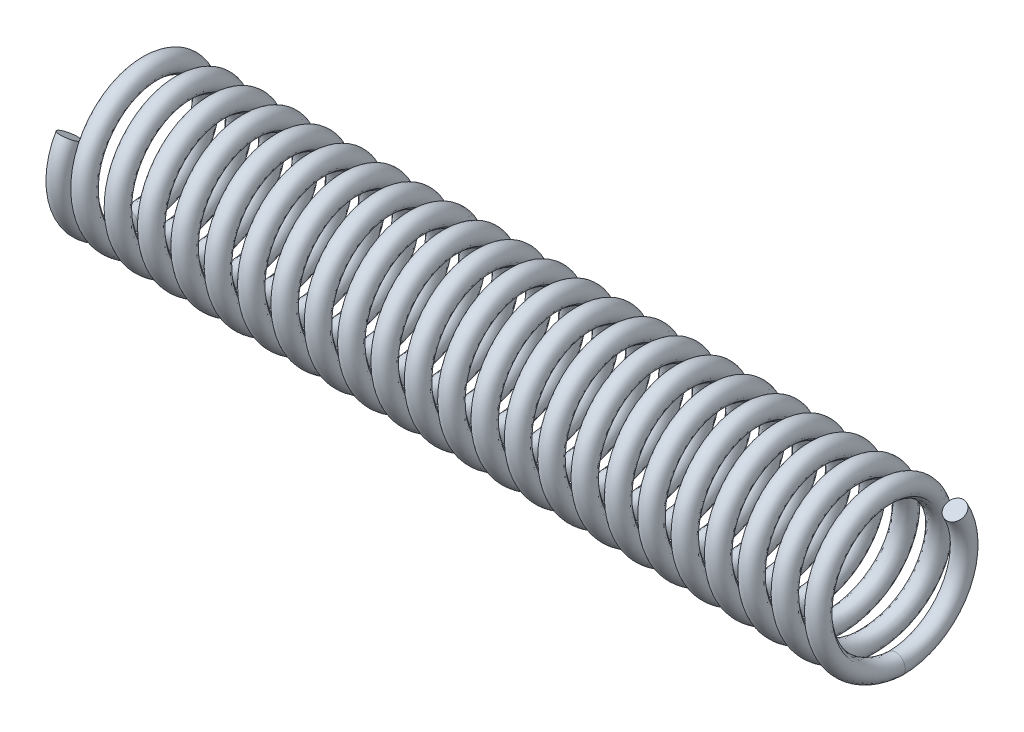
ISO-10303-21;
HEADER;
FILE_DESCRIPTION(('STEP AP214'),'2;1');
FILE_NAME('part.step','',(''),(''),'','','');
FILE_SCHEMA(('AUTOMOTIVE_DESIGN { 1 0 10303 214 1 1 1 1 }'));
ENDSEC;
DATA;
#1=APPLICATION_CONTEXT('core data for automotive mechanical design processes');
#2=APPLICATION_PROTOCOL_DEFINITION('international standard','automotive_design',2000,#1);
#3=PRODUCT_CONTEXT('',#1,'mechanical');
#4=PRODUCT('Part','Part','',(#3));
#5=PRODUCT_RELATED_PRODUCT_CATEGORY('part','',(#4));
#6=PRODUCT_DEFINITION_FORMATION('','',#4);
#7=PRODUCT_DEFINITION_CONTEXT('part definition',#1,'design');
#8=PRODUCT_DEFINITION('design','',#6,#7);
#9=PRODUCT_DEFINITION_SHAPE('','',#8);
#10=(LENGTH_UNIT() NAMED_UNIT(*) SI_UNIT(.MILLI.,.METRE.));
#11=(NAMED_UNIT(*) PLANE_ANGLE_UNIT() SI_UNIT($,.RADIAN.));
#12=(NAMED_UNIT(*) SI_UNIT($,.STERADIAN.) SOLID_ANGLE_UNIT());
#13=UNCERTAINTY_MEASURE_WITH_UNIT(LENGTH_MEASURE(1.E-05),#10,'distance_accuracy_value','');
#14=(GEOMETRIC_REPRESENTATION_CONTEXT(3) GLOBAL_UNCERTAINTY_ASSIGNED_CONTEXT((#13)) GLOBAL_UNIT_ASSIGNED_CONTEXT((#10,
#11,#12)) REPRESENTATION_CONTEXT('',''));
#15=CARTESIAN_POINT('',(0.,0.,0.));
#16=DIRECTION('',(0.,0.,1.));
#17=DIRECTION('',(1.,0.,0.));
#18=AXIS2_PLACEMENT_3D('',#15,#16,#17);
#19=CARTESIAN_POINT('',(-3.6322,-4.191,0.));
#20=CARTESIAN_POINT('',(-3.80176377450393,-4.191,2.41967497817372));
#21=CARTESIAN_POINT('',(-3.97132754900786,-2.0955,3.62951246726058));
#22=CARTESIAN_POINT('',(-4.14089132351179,0.,4.83934995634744));
#23=CARTESIAN_POINT('',(-4.31045509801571,2.0955,3.62951246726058));
#24=CARTESIAN_POINT('',(-4.48001887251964,4.191,2.41967497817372));
#25=CARTESIAN_POINT('',(-4.64958264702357,4.191,0.));
#26=CARTESIAN_POINT('',(-4.8191464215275,4.191,-2.41967497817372));
#27=CARTESIAN_POINT('',(-4.98871019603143,2.0955,-3.62951246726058));
#28=CARTESIAN_POINT('',(-5.15827397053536,0.,-4.83934995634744));
#29=CARTESIAN_POINT('',(-5.32783774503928,-2.0955,-3.62951246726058));
#30=CARTESIAN_POINT('',(-5.49740151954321,-4.191,-2.41967497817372));
#31=CARTESIAN_POINT('',(-5.66696529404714,-4.191,0.));
#32=CARTESIAN_POINT('',(-5.83652906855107,-4.191,2.41967497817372));
#33=CARTESIAN_POINT('',(-6.006092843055,-2.0955,3.62951246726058));
#34=CARTESIAN_POINT('',(-6.17565661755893,0.,4.83934995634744));
#35=CARTESIAN_POINT('',(-6.34522039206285,2.0955,3.62951246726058));
#36=CARTESIAN_POINT('',(-6.51478416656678,4.191,2.41967497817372));
#37=CARTESIAN_POINT('',(-6.68434794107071,4.191,0.));
#38=CARTESIAN_POINT('',(-6.85391171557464,4.191,-2.41967497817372));
#39=CARTESIAN_POINT('',(-7.02347549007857,2.0955,-3.62951246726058));
#40=CARTESIAN_POINT('',(-7.1930392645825,0.,-4.83934995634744));
#41=CARTESIAN_POINT('',(-7.36260303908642,-2.0955,-3.62951246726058));
#42=CARTESIAN_POINT('',(-7.53216681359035,-4.191,-2.41967497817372));
#43=CARTESIAN_POINT('',(-7.70173058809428,-4.191,0.));
#44=CARTESIAN_POINT('',(-7.87129436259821,-4.191,2.41967497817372));
#45=CARTESIAN_POINT('',(-8.04085813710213,-2.0955,3.62951246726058));
#46=CARTESIAN_POINT('',(-8.21042191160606,0.,4.83934995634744));
#47=CARTESIAN_POINT('',(-8.37998568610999,2.0955,3.62951246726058));
#48=CARTESIAN_POINT('',(-8.54954946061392,4.191,2.41967497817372));
#49=CARTESIAN_POINT('',(-8.71911323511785,4.191,0.));
#50=CARTESIAN_POINT('',(-8.88867700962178,4.191,-2.41967497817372));
#51=CARTESIAN_POINT('',(-9.0582407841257,2.0955,-3.62951246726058));
#52=CARTESIAN_POINT('',(-9.22780455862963,0.,-4.83934995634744));
#53=CARTESIAN_POINT('',(-9.39736833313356,-2.0955,-3.62951246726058));
#54=CARTESIAN_POINT('',(-9.56693210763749,-4.191,-2.41967497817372));
#55=CARTESIAN_POINT('',(-9.73649588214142,-4.191,0.));
#56=CARTESIAN_POINT('',(-9.90605965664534,-4.191,2.41967497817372));
#57=CARTESIAN_POINT('',(-10.0756234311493,-2.0955,3.62951246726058));
#58=CARTESIAN_POINT('',(-10.2451872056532,0.,4.83934995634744));
#59=CARTESIAN_POINT('',(-10.4147509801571,2.0955,3.62951246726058));
#60=CARTESIAN_POINT('',(-10.5843147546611,4.191,2.41967497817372));
#61=CARTESIAN_POINT('',(-10.753878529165,4.191,0.));
#62=CARTESIAN_POINT('',(-10.9234423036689,4.191,-2.41967497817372));
#63=CARTESIAN_POINT('',(-11.0930060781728,2.0955,-3.62951246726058));
#64=CARTESIAN_POINT('',(-11.2625698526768,0.,-4.83934995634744));
#65=CARTESIAN_POINT('',(-11.4321336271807,-2.0955,-3.62951246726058));
#66=CARTESIAN_POINT('',(-11.6016974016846,-4.191,-2.41967497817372));
#67=CARTESIAN_POINT('',(-11.7712611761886,-4.191,0.));
#68=CARTESIAN_POINT('',(-11.9408249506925,-4.191,2.41967497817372));
#69=CARTESIAN_POINT('',(-12.1103887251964,-2.0955,3.62951246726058));
#70=CARTESIAN_POINT('',(-12.2799524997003,0.,4.83934995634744));
#71=CARTESIAN_POINT('',(-12.4495162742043,2.0955,3.62951246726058));
#72=CARTESIAN_POINT('',(-12.6190800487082,4.191,2.41967497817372));
#73=CARTESIAN_POINT('',(-12.7886438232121,4.191,0.));
#74=CARTESIAN_POINT('',(-12.9582075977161,4.191,-2.41967497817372));
#75=CARTESIAN_POINT('',(-13.12777137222,2.0955,-3.62951246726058));
#76=CARTESIAN_POINT('',(-13.2973351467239,0.,-4.83934995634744));
#77=CARTESIAN_POINT('',(-13.4668989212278,-2.0955,-3.62951246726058));
#78=CARTESIAN_POINT('',(-13.6364626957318,-4.191,-2.41967497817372));
#79=CARTESIAN_POINT('',(-13.8060264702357,-4.191,0.));
#80=CARTESIAN_POINT('',(-13.9755902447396,-4.191,2.41967497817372));
#81=CARTESIAN_POINT('',(-14.1451540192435,-2.0955,3.62951246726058));
#82=CARTESIAN_POINT('',(-14.3147177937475,0.,4.83934995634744));
#83=CARTESIAN_POINT('',(-14.4842815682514,2.0955,3.62951246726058));
#84=CARTESIAN_POINT('',(-14.6538453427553,4.191,2.41967497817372));
#85=CARTESIAN_POINT('',(-14.8234091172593,4.191,0.));
#86=CARTESIAN_POINT('',(-14.9929728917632,4.191,-2.41967497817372));
#87=CARTESIAN_POINT('',(-15.1625366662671,2.0955,-3.62951246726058));
#88=CARTESIAN_POINT('',(-15.332100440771,0.,-4.83934995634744));
#89=CARTESIAN_POINT('',(-15.501664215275,-2.0955,-3.62951246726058));
#90=CARTESIAN_POINT('',(-15.6712279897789,-4.191,-2.41967497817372));
#91=CARTESIAN_POINT('',(-15.8407917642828,-4.191,0.));
#92=CARTESIAN_POINT('',(-16.0103555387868,-4.191,2.41967497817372));
#93=CARTESIAN_POINT('',(-16.1799193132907,-2.0955,3.62951246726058));
#94=CARTESIAN_POINT('',(-16.3494830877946,0.,4.83934995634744));
#95=CARTESIAN_POINT('',(-16.5190468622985,2.0955,3.62951246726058));
#96=CARTESIAN_POINT('',(-16.6886106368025,4.191,2.41967497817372));
#97=CARTESIAN_POINT('',(-16.8581744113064,4.191,0.));
#98=CARTESIAN_POINT('',(-17.0277381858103,4.191,-2.41967497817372));
#99=CARTESIAN_POINT('',(-17.1973019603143,2.0955,-3.62951246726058));
#100=CARTESIAN_POINT('',(-17.3668657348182,0.,-4.83934995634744));
#101=CARTESIAN_POINT('',(-17.5364295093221,-2.0955,-3.62951246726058));
#102=CARTESIAN_POINT('',(-17.705993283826,-4.191,-2.41967497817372));
#103=CARTESIAN_POINT('',(-17.87555705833,-4.191,0.));
#104=CARTESIAN_POINT('',(-18.0451208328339,-4.191,2.41967497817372));
#105=CARTESIAN_POINT('',(-18.2146846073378,-2.0955,3.62951246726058));
#106=CARTESIAN_POINT('',(-18.3842483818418,0.,4.83934995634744));
#107=CARTESIAN_POINT('',(-18.5538121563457,2.0955,3.62951246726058));
#108=CARTESIAN_POINT('',(-18.7233759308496,4.191,2.41967497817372));
#109=CARTESIAN_POINT('',(-18.8929397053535,4.191,0.));
#110=CARTESIAN_POINT('',(-19.0625034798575,4.191,-2.41967497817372));
#111=CARTESIAN_POINT('',(-19.2320672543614,2.0955,-3.62951246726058));
#112=CARTESIAN_POINT('',(-19.4016310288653,0.,-4.83934995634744));
#113=CARTESIAN_POINT('',(-19.5711948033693,-2.0955,-3.62951246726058));
#114=CARTESIAN_POINT('',(-19.7407585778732,-4.191,-2.41967497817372));
#115=CARTESIAN_POINT('',(-19.9103223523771,-4.191,0.));
#116=CARTESIAN_POINT('',(-20.079886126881,-4.191,2.41967497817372));
#117=CARTESIAN_POINT('',(-20.249449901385,-2.0955,3.62951246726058));
#118=CARTESIAN_POINT('',(-20.4190136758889,0.,4.83934995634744));
#119=CARTESIAN_POINT('',(-20.5885774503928,2.0955,3.62951246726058));
#120=CARTESIAN_POINT('',(-20.7581412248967,4.191,2.41967497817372));
#121=CARTESIAN_POINT('',(-20.9277049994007,4.191,0.));
#122=CARTESIAN_POINT('',(-21.0972687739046,4.191,-2.41967497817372));
#123=CARTESIAN_POINT('',(-21.2668325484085,2.0955,-3.62951246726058));
#124=CARTESIAN_POINT('',(-21.4363963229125,0.,-4.83934995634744));
#125=CARTESIAN_POINT('',(-21.6059600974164,-2.0955,-3.62951246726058));
#126=CARTESIAN_POINT('',(-21.7755238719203,-4.191,-2.41967497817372));
#127=CARTESIAN_POINT('',(-21.9450876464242,-4.191,0.));
#128=CARTESIAN_POINT('',(-22.1146514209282,-4.191,2.41967497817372));
#129=CARTESIAN_POINT('',(-22.2842151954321,-2.0955,3.62951246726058));
#130=CARTESIAN_POINT('',(-22.453778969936,0.,4.83934995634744));
#131=CARTESIAN_POINT('',(-22.62334274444,2.0955,3.62951246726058));
#132=CARTESIAN_POINT('',(-22.7929065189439,4.191,2.41967497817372));
#133=CARTESIAN_POINT('',(-22.9624702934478,4.191,0.));
#134=CARTESIAN_POINT('',(-23.1320340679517,4.191,-2.41967497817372));
#135=CARTESIAN_POINT('',(-23.3015978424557,2.0955,-3.62951246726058));
#136=CARTESIAN_POINT('',(-23.4711616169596,0.,-4.83934995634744));
#137=CARTESIAN_POINT('',(-23.6407253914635,-2.0955,-3.62951246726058));
#138=CARTESIAN_POINT('',(-23.8102891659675,-4.191,-2.41967497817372));
#139=CARTESIAN_POINT('',(-23.9798529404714,-4.191,0.));
#140=CARTESIAN_POINT('',(-24.1494167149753,-4.191,2.41967497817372));
#141=CARTESIAN_POINT('',(-24.3189804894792,-2.0955,3.62951246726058));
#142=CARTESIAN_POINT('',(-24.4885442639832,0.,4.83934995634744));
#143=CARTESIAN_POINT('',(-24.6581080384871,2.0955,3.62951246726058));
#144=CARTESIAN_POINT('',(-24.827671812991,4.191,2.41967497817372));
#145=CARTESIAN_POINT('',(-24.997235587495,4.191,0.));
#146=CARTESIAN_POINT('',(-25.1667993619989,4.191,-2.41967497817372));
#147=CARTESIAN_POINT('',(-25.3363631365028,2.0955,-3.62951246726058));
#148=CARTESIAN_POINT('',(-25.5059269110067,0.,-4.83934995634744));
#149=CARTESIAN_POINT('',(-25.6754906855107,-2.0955,-3.62951246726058));
#150=CARTESIAN_POINT('',(-25.8450544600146,-4.191,-2.41967497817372));
#151=CARTESIAN_POINT('',(-26.0146182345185,-4.191,0.));
#152=CARTESIAN_POINT('',(-26.1841820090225,-4.191,2.41967497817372));
#153=CARTESIAN_POINT('',(-26.3537457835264,-2.0955,3.62951246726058));
#154=CARTESIAN_POINT('',(-26.5233095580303,0.,4.83934995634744));
#155=CARTESIAN_POINT('',(-26.6928733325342,2.0955,3.62951246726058));
#156=CARTESIAN_POINT('',(-26.8624371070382,4.191,2.41967497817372));
#157=CARTESIAN_POINT('',(-27.0320008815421,4.191,0.));
#158=CARTESIAN_POINT('',(-27.201564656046,4.191,-2.41967497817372));
#159=CARTESIAN_POINT('',(-27.3711284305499,2.0955,-3.62951246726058));
#160=CARTESIAN_POINT('',(-27.5406922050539,0.,-4.83934995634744));
#161=CARTESIAN_POINT('',(-27.7102559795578,-2.0955,-3.62951246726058));
#162=CARTESIAN_POINT('',(-27.8798197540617,-4.191,-2.41967497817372));
#163=CARTESIAN_POINT('',(-28.0493835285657,-4.191,0.));
#164=CARTESIAN_POINT('',(-28.2189473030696,-4.191,2.41967497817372));
#165=CARTESIAN_POINT('',(-28.3885110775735,-2.0955,3.62951246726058));
#166=CARTESIAN_POINT('',(-28.5580748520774,0.,4.83934995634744));
#167=CARTESIAN_POINT('',(-28.7276386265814,2.0955,3.62951246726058));
#168=CARTESIAN_POINT('',(-28.8972024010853,4.191,2.41967497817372));
#169=CARTESIAN_POINT('',(-29.0667661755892,4.191,0.));
#170=CARTESIAN_POINT('',(-29.2363299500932,4.191,-2.41967497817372));
#171=CARTESIAN_POINT('',(-29.4058937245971,2.0955,-3.62951246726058));
#172=CARTESIAN_POINT('',(-29.575457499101,0.,-4.83934995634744));
#173=CARTESIAN_POINT('',(-29.7450212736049,-2.0955,-3.62951246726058));
#174=CARTESIAN_POINT('',(-29.9145850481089,-4.191,-2.41967497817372));
#175=CARTESIAN_POINT('',(-30.0841488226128,-4.191,0.));
#176=CARTESIAN_POINT('',(-30.2537125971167,-4.191,2.41967497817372));
#177=CARTESIAN_POINT('',(-30.4232763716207,-2.0955,3.62951246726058));
#178=CARTESIAN_POINT('',(-30.5928401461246,0.,4.83934995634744));
#179=CARTESIAN_POINT('',(-30.7624039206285,2.0955,3.62951246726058));
#180=CARTESIAN_POINT('',(-30.9319676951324,4.191,2.41967497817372));
#181=CARTESIAN_POINT('',(-31.1015314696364,4.191,0.));
#182=CARTESIAN_POINT('',(-31.2710952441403,4.191,-2.41967497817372));
#183=CARTESIAN_POINT('',(-31.4406590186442,2.0955,-3.62951246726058));
#184=CARTESIAN_POINT('',(-31.6102227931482,0.,-4.83934995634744));
#185=CARTESIAN_POINT('',(-31.7797865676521,-2.0955,-3.62951246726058));
#186=CARTESIAN_POINT('',(-31.949350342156,-4.191,-2.41967497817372));
#187=CARTESIAN_POINT('',(-32.1189141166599,-4.191,0.));
#188=CARTESIAN_POINT('',(-32.2884778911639,-4.191,2.41967497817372));
#189=CARTESIAN_POINT('',(-32.4580416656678,-2.0955,3.62951246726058));
#190=CARTESIAN_POINT('',(-32.6276054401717,0.,4.83934995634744));
#191=CARTESIAN_POINT('',(-32.7971692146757,2.0955,3.62951246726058));
#192=CARTESIAN_POINT('',(-32.9667329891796,4.191,2.41967497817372));
#193=CARTESIAN_POINT('',(-33.1362967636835,4.191,0.));
#194=CARTESIAN_POINT('',(-33.3058605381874,4.191,-2.41967497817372));
#195=CARTESIAN_POINT('',(-33.4754243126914,2.0955,-3.62951246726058));
#196=CARTESIAN_POINT('',(-33.6449880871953,0.,-4.83934995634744));
#197=CARTESIAN_POINT('',(-33.8145518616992,-2.0955,-3.62951246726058));
#198=CARTESIAN_POINT('',(-33.9841156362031,-4.191,-2.41967497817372));
#199=CARTESIAN_POINT('',(-34.1536794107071,-4.191,0.));
#200=CARTESIAN_POINT('',(-34.323243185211,-4.191,2.41967497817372));
#201=CARTESIAN_POINT('',(-34.4928069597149,-2.0955,3.62951246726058));
#202=CARTESIAN_POINT('',(-34.6623707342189,0.,4.83934995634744));
#203=CARTESIAN_POINT('',(-34.8319345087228,2.0955,3.62951246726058));
#204=CARTESIAN_POINT('',(-35.0014982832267,4.191,2.41967497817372));
#205=CARTESIAN_POINT('',(-35.1710620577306,4.191,0.));
#206=CARTESIAN_POINT('',(-35.3406258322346,4.191,-2.41967497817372));
#207=CARTESIAN_POINT('',(-35.5101896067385,2.0955,-3.62951246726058));
#208=CARTESIAN_POINT('',(-35.6797533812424,0.,-4.83934995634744));
#209=CARTESIAN_POINT('',(-35.8493171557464,-2.0955,-3.62951246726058));
#210=CARTESIAN_POINT('',(-36.0188809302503,-4.191,-2.41967497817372));
#211=CARTESIAN_POINT('',(-36.1884447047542,-4.191,0.));
#212=CARTESIAN_POINT('',(-36.3580084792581,-4.191,2.41967497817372));
#213=CARTESIAN_POINT('',(-36.5275722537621,-2.0955,3.62951246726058));
#214=CARTESIAN_POINT('',(-36.697136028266,0.,4.83934995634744));
#215=CARTESIAN_POINT('',(-36.8666998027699,2.0955,3.62951246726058));
#216=CARTESIAN_POINT('',(-37.0362635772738,4.191,2.41967497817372));
#217=CARTESIAN_POINT('',(-37.2058273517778,4.191,0.));
#218=CARTESIAN_POINT('',(-37.3753911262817,4.191,-2.41967497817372));
#219=CARTESIAN_POINT('',(-37.5449549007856,2.0955,-3.62951246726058));
#220=CARTESIAN_POINT('',(-37.7145186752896,0.,-4.83934995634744));
#221=CARTESIAN_POINT('',(-37.8840824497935,-2.0955,-3.62951246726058));
#222=CARTESIAN_POINT('',(-38.0536462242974,-4.191,-2.41967497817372));
#223=CARTESIAN_POINT('',(-38.2232099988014,-4.191,0.));
#224=CARTESIAN_POINT('',(-38.3927737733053,-4.191,2.41967497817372));
#225=CARTESIAN_POINT('',(-38.5623375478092,-2.0955,3.62951246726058));
#226=CARTESIAN_POINT('',(-38.7319013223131,0.,4.83934995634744));
#227=CARTESIAN_POINT('',(-38.9014650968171,2.09549999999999,3.62951246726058));
#228=CARTESIAN_POINT('',(-39.071028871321,4.191,2.41967497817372));
#229=CARTESIAN_POINT('',(-39.2405926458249,4.191,0.));
#230=CARTESIAN_POINT('',(-39.4101564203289,4.191,-2.41967497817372));
#231=CARTESIAN_POINT('',(-39.5797201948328,2.0955,-3.62951246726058));
#232=CARTESIAN_POINT('',(-39.7492839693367,0.,-4.83934995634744));
#233=CARTESIAN_POINT('',(-39.9188477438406,-2.0955,-3.62951246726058));
#234=CARTESIAN_POINT('',(-40.0884115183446,-4.191,-2.41967497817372));
#235=CARTESIAN_POINT('',(-40.2579752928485,-4.191,0.));
#236=CARTESIAN_POINT('',(-40.4275390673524,-4.19100000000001,2.41967497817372));
#237=CARTESIAN_POINT('',(-40.5971028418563,-2.09550000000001,3.62951246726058));
#238=CARTESIAN_POINT('',(-40.7666666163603,0.,4.83934995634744));
#239=CARTESIAN_POINT('',(-40.9362303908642,2.09549999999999,3.62951246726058));
#240=CARTESIAN_POINT('',(-41.1057941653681,4.19099999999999,2.41967497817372));
#241=CARTESIAN_POINT('',(-41.2753579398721,4.191,0.));
#242=CARTESIAN_POINT('',(-41.444921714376,4.191,-2.41967497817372));
#243=CARTESIAN_POINT('',(-41.6144854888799,2.0955,-3.62951246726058));
#244=CARTESIAN_POINT('',(-41.7840492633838,0.,-4.83934995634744));
#245=CARTESIAN_POINT('',(-41.9536130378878,-2.0955,-3.62951246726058));
#246=CARTESIAN_POINT('',(-42.1231768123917,-4.191,-2.41967497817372));
#247=CARTESIAN_POINT('',(-42.2927405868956,-4.19100000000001,0.));
#248=CARTESIAN_POINT('',(-42.4623043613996,-4.19100000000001,2.41967497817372));
#249=CARTESIAN_POINT('',(-42.6318681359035,-2.09550000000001,3.62951246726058));
#250=CARTESIAN_POINT('',(-42.8014319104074,0.,4.83934995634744));
#251=CARTESIAN_POINT('',(-42.9709956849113,2.09549999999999,3.62951246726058));
#252=CARTESIAN_POINT('',(-43.1405594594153,4.19099999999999,2.41967497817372));
#253=CARTESIAN_POINT('',(-43.3101232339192,4.191,0.));
#254=CARTESIAN_POINT('',(-43.4796870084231,4.191,-2.41967497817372));
#255=CARTESIAN_POINT('',(-43.6492507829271,2.0955,-3.62951246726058));
#256=CARTESIAN_POINT('',(-43.818814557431,0.,-4.83934995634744));
#257=CARTESIAN_POINT('',(-43.9883783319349,-2.0955,-3.62951246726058));
#258=CARTESIAN_POINT('',(-44.1579421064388,-4.191,-2.41967497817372));
#259=CARTESIAN_POINT('',(-44.3275058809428,-4.19100000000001,0.));
#260=CARTESIAN_POINT('',(-44.4970696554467,-4.19100000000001,2.41967497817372));
#261=CARTESIAN_POINT('',(-44.6666334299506,-2.09550000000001,3.62951246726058));
#262=CARTESIAN_POINT('',(-44.8361972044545,0.,4.83934995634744));
#263=CARTESIAN_POINT('',(-45.0057609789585,2.09549999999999,3.62951246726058));
#264=CARTESIAN_POINT('',(-45.1753247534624,4.19099999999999,2.41967497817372));
#265=CARTESIAN_POINT('',(-45.3448885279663,4.191,0.));
#266=CARTESIAN_POINT('',(-45.5144523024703,4.191,-2.41967497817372));
#267=CARTESIAN_POINT('',(-45.6840160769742,2.0955,-3.62951246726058));
#268=CARTESIAN_POINT('',(-45.8535798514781,0.,-4.83934995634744));
#269=CARTESIAN_POINT('',(-46.023143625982,-2.0955,-3.62951246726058));
#270=CARTESIAN_POINT('',(-46.192707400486,-4.191,-2.41967497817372));
#271=CARTESIAN_POINT('',(-46.3622711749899,-4.19100000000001,0.));
#272=CARTESIAN_POINT('',(-46.5318349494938,-4.19100000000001,2.41967497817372));
#273=CARTESIAN_POINT('',(-46.7013987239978,-2.09550000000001,3.62951246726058));
#274=CARTESIAN_POINT('',(-46.8709624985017,0.,4.83934995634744));
#275=CARTESIAN_POINT('',(-47.0405262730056,2.09549999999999,3.62951246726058));
#276=CARTESIAN_POINT('',(-47.2100900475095,4.19099999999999,2.41967497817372));
#277=CARTESIAN_POINT('',(-47.3796538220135,4.19099999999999,0.));
#278=CARTESIAN_POINT('',(-47.5492175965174,4.191,-2.41967497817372));
#279=CARTESIAN_POINT('',(-47.7187813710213,2.0955,-3.62951246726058));
#280=CARTESIAN_POINT('',(-47.8883451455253,0.,-4.83934995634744));
#281=CARTESIAN_POINT('',(-48.0579089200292,-2.0955,-3.62951246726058));
#282=CARTESIAN_POINT('',(-48.2274726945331,-4.191,-2.41967497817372));
#283=CARTESIAN_POINT('',(-48.397036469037,-4.19100000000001,0.));
#284=CARTESIAN_POINT('',(-48.566600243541,-4.19100000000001,2.41967497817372));
#285=CARTESIAN_POINT('',(-48.7361640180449,-2.09550000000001,3.62951246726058));
#286=CARTESIAN_POINT('',(-48.9057277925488,0.,4.83934995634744));
#287=CARTESIAN_POINT('',(-49.0752915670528,2.09549999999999,3.62951246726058));
#288=CARTESIAN_POINT('',(-49.2448553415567,4.19099999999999,2.41967497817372));
#289=CARTESIAN_POINT('',(-49.4144191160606,4.19099999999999,0.));
#290=CARTESIAN_POINT('',(-49.5839828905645,4.191,-2.41967497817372));
#291=CARTESIAN_POINT('',(-49.7535466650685,2.0955,-3.62951246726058));
#292=CARTESIAN_POINT('',(-49.9231104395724,0.,-4.83934995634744));
#293=CARTESIAN_POINT('',(-50.0926742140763,-2.0955,-3.62951246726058));
#294=CARTESIAN_POINT('',(-50.2622379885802,-4.191,-2.41967497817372));
#295=CARTESIAN_POINT('',(-50.4318017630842,-4.19100000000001,0.));
#296=CARTESIAN_POINT('',(-50.6013655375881,-4.19100000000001,2.41967497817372));
#297=CARTESIAN_POINT('',(-50.770929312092,-2.09550000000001,3.62951246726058));
#298=CARTESIAN_POINT('',(-50.940493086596,0.,4.83934995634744));
#299=CARTESIAN_POINT('',(-51.1100568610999,2.09549999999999,3.62951246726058));
#300=CARTESIAN_POINT('',(-51.2796206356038,4.19099999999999,2.41967497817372));
#301=CARTESIAN_POINT('',(-51.4491844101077,4.19099999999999,0.));
#302=CARTESIAN_POINT('',(-51.6187481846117,4.191,-2.41967497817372));
#303=CARTESIAN_POINT('',(-51.7883119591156,2.0955,-3.62951246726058));
#304=CARTESIAN_POINT('',(-51.9578757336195,0.,-4.83934995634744));
#305=CARTESIAN_POINT('',(-52.1274395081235,-2.0955,-3.62951246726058));
#306=CARTESIAN_POINT('',(-52.2970032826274,-4.191,-2.41967497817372));
#307=CARTESIAN_POINT('',(-52.4665670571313,-4.19100000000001,0.));
#308=CARTESIAN_POINT('',(-3.6322,-2.9972,0.));
#309=CARTESIAN_POINT('',(-3.80176377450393,-2.9972,1.73043422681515));
#310=CARTESIAN_POINT('',(-3.97132754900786,-1.4986,2.59565134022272));
#311=CARTESIAN_POINT('',(-4.14089132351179,0.,3.46086845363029));
#312=CARTESIAN_POINT('',(-4.31045509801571,1.4986,2.59565134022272));
#313=CARTESIAN_POINT('',(-4.48001887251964,2.9972,1.73043422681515));
#314=CARTESIAN_POINT('',(-4.64958264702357,2.9972,0.));
#315=CARTESIAN_POINT('',(-4.8191464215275,2.9972,-1.73043422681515));
#316=CARTESIAN_POINT('',(-4.98871019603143,1.4986,-2.59565134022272));
#317=CARTESIAN_POINT('',(-5.15827397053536,0.,-3.46086845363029));
#318=CARTESIAN_POINT('',(-5.32783774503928,-1.4986,-2.59565134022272));
#319=CARTESIAN_POINT('',(-5.49740151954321,-2.9972,-1.73043422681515));
#320=CARTESIAN_POINT('',(-5.66696529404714,-2.9972,0.));
#321=CARTESIAN_POINT('',(-5.83652906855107,-2.9972,1.73043422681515));
#322=CARTESIAN_POINT('',(-6.006092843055,-1.4986,2.59565134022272));
#323=CARTESIAN_POINT('',(-6.17565661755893,0.,3.46086845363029));
#324=CARTESIAN_POINT('',(-6.34522039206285,1.4986,2.59565134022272));
#325=CARTESIAN_POINT('',(-6.51478416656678,2.9972,1.73043422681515));
#326=CARTESIAN_POINT('',(-6.68434794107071,2.9972,0.));
#327=CARTESIAN_POINT('',(-6.85391171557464,2.9972,-1.73043422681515));
#328=CARTESIAN_POINT('',(-7.02347549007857,1.4986,-2.59565134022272));
#329=CARTESIAN_POINT('',(-7.1930392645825,0.,-3.46086845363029));
#330=CARTESIAN_POINT('',(-7.36260303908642,-1.4986,-2.59565134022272));
#331=CARTESIAN_POINT('',(-7.53216681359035,-2.9972,-1.73043422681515));
#332=CARTESIAN_POINT('',(-7.70173058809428,-2.9972,0.));
#333=CARTESIAN_POINT('',(-7.87129436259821,-2.9972,1.73043422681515));
#334=CARTESIAN_POINT('',(-8.04085813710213,-1.4986,2.59565134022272));
#335=CARTESIAN_POINT('',(-8.21042191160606,0.,3.46086845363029));
#336=CARTESIAN_POINT('',(-8.37998568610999,1.4986,2.59565134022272));
#337=CARTESIAN_POINT('',(-8.54954946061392,2.9972,1.73043422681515));
#338=CARTESIAN_POINT('',(-8.71911323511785,2.9972,0.));
#339=CARTESIAN_POINT('',(-8.88867700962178,2.9972,-1.73043422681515));
#340=CARTESIAN_POINT('',(-9.0582407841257,1.4986,-2.59565134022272));
#341=CARTESIAN_POINT('',(-9.22780455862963,0.,-3.46086845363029));
#342=CARTESIAN_POINT('',(-9.39736833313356,-1.4986,-2.59565134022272));
#343=CARTESIAN_POINT('',(-9.56693210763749,-2.9972,-1.73043422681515));
#344=CARTESIAN_POINT('',(-9.73649588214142,-2.9972,0.));
#345=CARTESIAN_POINT('',(-9.90605965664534,-2.9972,1.73043422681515));
#346=CARTESIAN_POINT('',(-10.0756234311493,-1.4986,2.59565134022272));
#347=CARTESIAN_POINT('',(-10.2451872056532,0.,3.46086845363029));
#348=CARTESIAN_POINT('',(-10.4147509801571,1.4986,2.59565134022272));
#349=CARTESIAN_POINT('',(-10.5843147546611,2.9972,1.73043422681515));
#350=CARTESIAN_POINT('',(-10.753878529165,2.9972,0.));
#351=CARTESIAN_POINT('',(-10.9234423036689,2.9972,-1.73043422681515));
#352=CARTESIAN_POINT('',(-11.0930060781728,1.4986,-2.59565134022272));
#353=CARTESIAN_POINT('',(-11.2625698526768,0.,-3.46086845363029));
#354=CARTESIAN_POINT('',(-11.4321336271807,-1.4986,-2.59565134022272));
#355=CARTESIAN_POINT('',(-11.6016974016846,-2.9972,-1.73043422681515));
#356=CARTESIAN_POINT('',(-11.7712611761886,-2.9972,0.));
#357=CARTESIAN_POINT('',(-11.9408249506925,-2.9972,1.73043422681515));
#358=CARTESIAN_POINT('',(-12.1103887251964,-1.4986,2.59565134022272));
#359=CARTESIAN_POINT('',(-12.2799524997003,0.,3.46086845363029));
#360=CARTESIAN_POINT('',(-12.4495162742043,1.4986,2.59565134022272));
#361=CARTESIAN_POINT('',(-12.6190800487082,2.9972,1.73043422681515));
#362=CARTESIAN_POINT('',(-12.7886438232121,2.9972,0.));
#363=CARTESIAN_POINT('',(-12.9582075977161,2.9972,-1.73043422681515));
#364=CARTESIAN_POINT('',(-13.12777137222,1.4986,-2.59565134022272));
#365=CARTESIAN_POINT('',(-13.2973351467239,0.,-3.46086845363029));
#366=CARTESIAN_POINT('',(-13.4668989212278,-1.4986,-2.59565134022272));
#367=CARTESIAN_POINT('',(-13.6364626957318,-2.9972,-1.73043422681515));
#368=CARTESIAN_POINT('',(-13.8060264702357,-2.9972,0.));
#369=CARTESIAN_POINT('',(-13.9755902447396,-2.9972,1.73043422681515));
#370=CARTESIAN_POINT('',(-14.1451540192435,-1.4986,2.59565134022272));
#371=CARTESIAN_POINT('',(-14.3147177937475,0.,3.46086845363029));
#372=CARTESIAN_POINT('',(-14.4842815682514,1.4986,2.59565134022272));
#373=CARTESIAN_POINT('',(-14.6538453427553,2.9972,1.73043422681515));
#374=CARTESIAN_POINT('',(-14.8234091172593,2.9972,0.));
#375=CARTESIAN_POINT('',(-14.9929728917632,2.9972,-1.73043422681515));
#376=CARTESIAN_POINT('',(-15.1625366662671,1.4986,-2.59565134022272));
#377=CARTESIAN_POINT('',(-15.332100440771,0.,-3.46086845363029));
#378=CARTESIAN_POINT('',(-15.501664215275,-1.4986,-2.59565134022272));
#379=CARTESIAN_POINT('',(-15.6712279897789,-2.9972,-1.73043422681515));
#380=CARTESIAN_POINT('',(-15.8407917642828,-2.9972,0.));
#381=CARTESIAN_POINT('',(-16.0103555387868,-2.9972,1.73043422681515));
#382=CARTESIAN_POINT('',(-16.1799193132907,-1.4986,2.59565134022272));
#383=CARTESIAN_POINT('',(-16.3494830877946,0.,3.46086845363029));
#384=CARTESIAN_POINT('',(-16.5190468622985,1.4986,2.59565134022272));
#385=CARTESIAN_POINT('',(-16.6886106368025,2.9972,1.73043422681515));
#386=CARTESIAN_POINT('',(-16.8581744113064,2.9972,0.));
#387=CARTESIAN_POINT('',(-17.0277381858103,2.9972,-1.73043422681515));
#388=CARTESIAN_POINT('',(-17.1973019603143,1.4986,-2.59565134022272));
#389=CARTESIAN_POINT('',(-17.3668657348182,0.,-3.46086845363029));
#390=CARTESIAN_POINT('',(-17.5364295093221,-1.4986,-2.59565134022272));
#391=CARTESIAN_POINT('',(-17.705993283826,-2.9972,-1.73043422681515));
#392=CARTESIAN_POINT('',(-17.87555705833,-2.9972,0.));
#393=CARTESIAN_POINT('',(-18.0451208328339,-2.9972,1.73043422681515));
#394=CARTESIAN_POINT('',(-18.2146846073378,-1.4986,2.59565134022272));
#395=CARTESIAN_POINT('',(-18.3842483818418,0.,3.46086845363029));
#396=CARTESIAN_POINT('',(-18.5538121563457,1.4986,2.59565134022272));
#397=CARTESIAN_POINT('',(-18.7233759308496,2.9972,1.73043422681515));
#398=CARTESIAN_POINT('',(-18.8929397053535,2.9972,0.));
#399=CARTESIAN_POINT('',(-19.0625034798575,2.9972,-1.73043422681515));
#400=CARTESIAN_POINT('',(-19.2320672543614,1.4986,-2.59565134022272));
#401=CARTESIAN_POINT('',(-19.4016310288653,0.,-3.46086845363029));
#402=CARTESIAN_POINT('',(-19.5711948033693,-1.4986,-2.59565134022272));
#403=CARTESIAN_POINT('',(-19.7407585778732,-2.9972,-1.73043422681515));
#404=CARTESIAN_POINT('',(-19.9103223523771,-2.9972,0.));
#405=CARTESIAN_POINT('',(-20.079886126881,-2.9972,1.73043422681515));
#406=CARTESIAN_POINT('',(-20.249449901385,-1.4986,2.59565134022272));
#407=CARTESIAN_POINT('',(-20.4190136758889,0.,3.46086845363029));
#408=CARTESIAN_POINT('',(-20.5885774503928,1.4986,2.59565134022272));
#409=CARTESIAN_POINT('',(-20.7581412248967,2.9972,1.73043422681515));
#410=CARTESIAN_POINT('',(-20.9277049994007,2.9972,0.));
#411=CARTESIAN_POINT('',(-21.0972687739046,2.9972,-1.73043422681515));
#412=CARTESIAN_POINT('',(-21.2668325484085,1.4986,-2.59565134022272));
#413=CARTESIAN_POINT('',(-21.4363963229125,0.,-3.46086845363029));
#414=CARTESIAN_POINT('',(-21.6059600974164,-1.4986,-2.59565134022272));
#415=CARTESIAN_POINT('',(-21.7755238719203,-2.9972,-1.73043422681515));
#416=CARTESIAN_POINT('',(-21.9450876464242,-2.9972,0.));
#417=CARTESIAN_POINT('',(-22.1146514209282,-2.9972,1.73043422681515));
#418=CARTESIAN_POINT('',(-22.2842151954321,-1.4986,2.59565134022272));
#419=CARTESIAN_POINT('',(-22.453778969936,0.,3.46086845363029));
#420=CARTESIAN_POINT('',(-22.62334274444,1.4986,2.59565134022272));
#421=CARTESIAN_POINT('',(-22.7929065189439,2.9972,1.73043422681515));
#422=CARTESIAN_POINT('',(-22.9624702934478,2.9972,0.));
#423=CARTESIAN_POINT('',(-23.1320340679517,2.9972,-1.73043422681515));
#424=CARTESIAN_POINT('',(-23.3015978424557,1.4986,-2.59565134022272));
#425=CARTESIAN_POINT('',(-23.4711616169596,0.,-3.46086845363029));
#426=CARTESIAN_POINT('',(-23.6407253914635,-1.4986,-2.59565134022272));
#427=CARTESIAN_POINT('',(-23.8102891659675,-2.9972,-1.73043422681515));
#428=CARTESIAN_POINT('',(-23.9798529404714,-2.9972,0.));
#429=CARTESIAN_POINT('',(-24.1494167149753,-2.9972,1.73043422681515));
#430=CARTESIAN_POINT('',(-24.3189804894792,-1.4986,2.59565134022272));
#431=CARTESIAN_POINT('',(-24.4885442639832,0.,3.46086845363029));
#432=CARTESIAN_POINT('',(-24.6581080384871,1.4986,2.59565134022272));
#433=CARTESIAN_POINT('',(-24.827671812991,2.9972,1.73043422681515));
#434=CARTESIAN_POINT('',(-24.997235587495,2.9972,0.));
#435=CARTESIAN_POINT('',(-25.1667993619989,2.9972,-1.73043422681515));
#436=CARTESIAN_POINT('',(-25.3363631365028,1.4986,-2.59565134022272));
#437=CARTESIAN_POINT('',(-25.5059269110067,0.,-3.46086845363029));
#438=CARTESIAN_POINT('',(-25.6754906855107,-1.4986,-2.59565134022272));
#439=CARTESIAN_POINT('',(-25.8450544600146,-2.9972,-1.73043422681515));
#440=CARTESIAN_POINT('',(-26.0146182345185,-2.9972,0.));
#441=CARTESIAN_POINT('',(-26.1841820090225,-2.99720000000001,1.73043422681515));
#442=CARTESIAN_POINT('',(-26.3537457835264,-1.4986,2.59565134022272));
#443=CARTESIAN_POINT('',(-26.5233095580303,0.,3.46086845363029));
#444=CARTESIAN_POINT('',(-26.6928733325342,1.4986,2.59565134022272));
#445=CARTESIAN_POINT('',(-26.8624371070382,2.9972,1.73043422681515));
#446=CARTESIAN_POINT('',(-27.0320008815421,2.9972,0.));
#447=CARTESIAN_POINT('',(-27.201564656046,2.9972,-1.73043422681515));
#448=CARTESIAN_POINT('',(-27.3711284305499,1.4986,-2.59565134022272));
#449=CARTESIAN_POINT('',(-27.5406922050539,0.,-3.46086845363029));
#450=CARTESIAN_POINT('',(-27.7102559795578,-1.4986,-2.59565134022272));
#451=CARTESIAN_POINT('',(-27.8798197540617,-2.9972,-1.73043422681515));
#452=CARTESIAN_POINT('',(-28.0493835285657,-2.9972,0.));
#453=CARTESIAN_POINT('',(-28.2189473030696,-2.99720000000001,1.73043422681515));
#454=CARTESIAN_POINT('',(-28.3885110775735,-1.4986,2.59565134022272));
#455=CARTESIAN_POINT('',(-28.5580748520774,0.,3.46086845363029));
#456=CARTESIAN_POINT('',(-28.7276386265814,1.4986,2.59565134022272));
#457=CARTESIAN_POINT('',(-28.8972024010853,2.9972,1.73043422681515));
#458=CARTESIAN_POINT('',(-29.0667661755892,2.9972,0.));
#459=CARTESIAN_POINT('',(-29.2363299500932,2.9972,-1.73043422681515));
#460=CARTESIAN_POINT('',(-29.4058937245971,1.4986,-2.59565134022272));
#461=CARTESIAN_POINT('',(-29.575457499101,0.,-3.46086845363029));
#462=CARTESIAN_POINT('',(-29.7450212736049,-1.4986,-2.59565134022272));
#463=CARTESIAN_POINT('',(-29.9145850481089,-2.9972,-1.73043422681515));
#464=CARTESIAN_POINT('',(-30.0841488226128,-2.99720000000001,0.));
#465=CARTESIAN_POINT('',(-30.2537125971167,-2.99720000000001,1.73043422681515));
#466=CARTESIAN_POINT('',(-30.4232763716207,-1.4986,2.59565134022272));
#467=CARTESIAN_POINT('',(-30.5928401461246,0.,3.46086845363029));
#468=CARTESIAN_POINT('',(-30.7624039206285,1.4986,2.59565134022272));
#469=CARTESIAN_POINT('',(-30.9319676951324,2.9972,1.73043422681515));
#470=CARTESIAN_POINT('',(-31.1015314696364,2.9972,0.));
#471=CARTESIAN_POINT('',(-31.2710952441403,2.9972,-1.73043422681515));
#472=CARTESIAN_POINT('',(-31.4406590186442,1.4986,-2.59565134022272));
#473=CARTESIAN_POINT('',(-31.6102227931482,0.,-3.46086845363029));
#474=CARTESIAN_POINT('',(-31.7797865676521,-1.4986,-2.59565134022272));
#475=CARTESIAN_POINT('',(-31.949350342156,-2.9972,-1.73043422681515));
#476=CARTESIAN_POINT('',(-32.1189141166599,-2.99720000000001,0.));
#477=CARTESIAN_POINT('',(-32.2884778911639,-2.99720000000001,1.73043422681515));
#478=CARTESIAN_POINT('',(-32.4580416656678,-1.4986,2.59565134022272));
#479=CARTESIAN_POINT('',(-32.6276054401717,0.,3.46086845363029));
#480=CARTESIAN_POINT('',(-32.7971692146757,1.4986,2.59565134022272));
#481=CARTESIAN_POINT('',(-32.9667329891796,2.9972,1.73043422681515));
#482=CARTESIAN_POINT('',(-33.1362967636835,2.9972,0.));
#483=CARTESIAN_POINT('',(-33.3058605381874,2.9972,-1.73043422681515));
#484=CARTESIAN_POINT('',(-33.4754243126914,1.4986,-2.59565134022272));
#485=CARTESIAN_POINT('',(-33.6449880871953,0.,-3.46086845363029));
#486=CARTESIAN_POINT('',(-33.8145518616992,-1.4986,-2.59565134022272));
#487=CARTESIAN_POINT('',(-33.9841156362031,-2.99720000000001,-1.73043422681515));
#488=CARTESIAN_POINT('',(-34.1536794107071,-2.99720000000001,0.));
#489=CARTESIAN_POINT('',(-34.323243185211,-2.99720000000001,1.73043422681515));
#490=CARTESIAN_POINT('',(-34.4928069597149,-1.49860000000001,2.59565134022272));
#491=CARTESIAN_POINT('',(-34.6623707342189,0.,3.46086845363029));
#492=CARTESIAN_POINT('',(-34.8319345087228,1.4986,2.59565134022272));
#493=CARTESIAN_POINT('',(-35.0014982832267,2.9972,1.73043422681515));
#494=CARTESIAN_POINT('',(-35.1710620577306,2.9972,0.));
#495=CARTESIAN_POINT('',(-35.3406258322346,2.9972,-1.73043422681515));
#496=CARTESIAN_POINT('',(-35.5101896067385,1.4986,-2.59565134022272));
#497=CARTESIAN_POINT('',(-35.6797533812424,0.,-3.46086845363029));
#498=CARTESIAN_POINT('',(-35.8493171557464,-1.4986,-2.59565134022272));
#499=CARTESIAN_POINT('',(-36.0188809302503,-2.99720000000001,-1.73043422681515));
#500=CARTESIAN_POINT('',(-36.1884447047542,-2.99720000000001,0.));
#501=CARTESIAN_POINT('',(-36.3580084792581,-2.99720000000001,1.73043422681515));
#502=CARTESIAN_POINT('',(-36.5275722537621,-1.49860000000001,2.59565134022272));
#503=CARTESIAN_POINT('',(-36.697136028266,0.,3.46086845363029));
#504=CARTESIAN_POINT('',(-36.8666998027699,1.4986,2.59565134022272));
#505=CARTESIAN_POINT('',(-37.0362635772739,2.9972,1.73043422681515));
#506=CARTESIAN_POINT('',(-37.2058273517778,2.9972,0.));
#507=CARTESIAN_POINT('',(-37.3753911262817,2.9972,-1.73043422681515));
#508=CARTESIAN_POINT('',(-37.5449549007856,1.4986,-2.59565134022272));
#509=CARTESIAN_POINT('',(-37.7145186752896,0.,-3.46086845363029));
#510=CARTESIAN_POINT('',(-37.8840824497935,-1.4986,-2.59565134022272));
#511=CARTESIAN_POINT('',(-38.0536462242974,-2.99720000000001,-1.73043422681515));
#512=CARTESIAN_POINT('',(-38.2232099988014,-2.99720000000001,0.));
#513=CARTESIAN_POINT('',(-38.3927737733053,-2.99720000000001,1.73043422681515));
#514=CARTESIAN_POINT('',(-38.5623375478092,-1.49860000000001,2.59565134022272));
#515=CARTESIAN_POINT('',(-38.7319013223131,0.,3.46086845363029));
#516=CARTESIAN_POINT('',(-38.9014650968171,1.4986,2.59565134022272));
#517=CARTESIAN_POINT('',(-39.071028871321,2.9972,1.73043422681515));
#518=CARTESIAN_POINT('',(-39.2405926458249,2.9972,0.));
#519=CARTESIAN_POINT('',(-39.4101564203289,2.9972,-1.73043422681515));
#520=CARTESIAN_POINT('',(-39.5797201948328,1.4986,-2.59565134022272));
#521=CARTESIAN_POINT('',(-39.7492839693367,0.,-3.46086845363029));
#522=CARTESIAN_POINT('',(-39.9188477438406,-1.4986,-2.59565134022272));
#523=CARTESIAN_POINT('',(-40.0884115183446,-2.99720000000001,-1.73043422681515));
#524=CARTESIAN_POINT('',(-40.2579752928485,-2.99720000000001,0.));
#525=CARTESIAN_POINT('',(-40.4275390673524,-2.99720000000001,1.73043422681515));
#526=CARTESIAN_POINT('',(-40.5971028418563,-1.49860000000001,2.59565134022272));
#527=CARTESIAN_POINT('',(-40.7666666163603,0.,3.46086845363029));
#528=CARTESIAN_POINT('',(-40.9362303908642,1.4986,2.59565134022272));
#529=CARTESIAN_POINT('',(-41.1057941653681,2.9972,1.73043422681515));
#530=CARTESIAN_POINT('',(-41.2753579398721,2.9972,0.));
#531=CARTESIAN_POINT('',(-41.444921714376,2.9972,-1.73043422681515));
#532=CARTESIAN_POINT('',(-41.6144854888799,1.4986,-2.59565134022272));
#533=CARTESIAN_POINT('',(-41.7840492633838,0.,-3.46086845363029));
#534=CARTESIAN_POINT('',(-41.9536130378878,-1.4986,-2.59565134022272));
#535=CARTESIAN_POINT('',(-42.1231768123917,-2.99720000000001,-1.73043422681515));
#536=CARTESIAN_POINT('',(-42.2927405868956,-2.99720000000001,0.));
#537=CARTESIAN_POINT('',(-42.4623043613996,-2.99720000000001,1.73043422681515));
#538=CARTESIAN_POINT('',(-42.6318681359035,-1.49860000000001,2.59565134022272));
#539=CARTESIAN_POINT('',(-42.8014319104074,0.,3.46086845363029));
#540=CARTESIAN_POINT('',(-42.9709956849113,1.49859999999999,2.59565134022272));
#541=CARTESIAN_POINT('',(-43.1405594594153,2.9972,1.73043422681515));
#542=CARTESIAN_POINT('',(-43.3101232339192,2.9972,0.));
#543=CARTESIAN_POINT('',(-43.4796870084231,2.9972,-1.73043422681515));
#544=CARTESIAN_POINT('',(-43.6492507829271,1.4986,-2.59565134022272));
#545=CARTESIAN_POINT('',(-43.818814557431,0.,-3.46086845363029));
#546=CARTESIAN_POINT('',(-43.9883783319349,-1.4986,-2.59565134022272));
#547=CARTESIAN_POINT('',(-44.1579421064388,-2.99720000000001,-1.73043422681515));
#548=CARTESIAN_POINT('',(-44.3275058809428,-2.99720000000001,0.));
#549=CARTESIAN_POINT('',(-44.4970696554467,-2.99720000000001,1.73043422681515));
#550=CARTESIAN_POINT('',(-44.6666334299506,-1.49860000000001,2.59565134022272));
#551=CARTESIAN_POINT('',(-44.8361972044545,0.,3.46086845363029));
#552=CARTESIAN_POINT('',(-45.0057609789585,1.49859999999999,2.59565134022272));
#553=CARTESIAN_POINT('',(-45.1753247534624,2.9972,1.73043422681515));
#554=CARTESIAN_POINT('',(-45.3448885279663,2.9972,0.));
#555=CARTESIAN_POINT('',(-45.5144523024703,2.9972,-1.73043422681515));
#556=CARTESIAN_POINT('',(-45.6840160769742,1.4986,-2.59565134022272));
#557=CARTESIAN_POINT('',(-45.8535798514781,0.,-3.46086845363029));
#558=CARTESIAN_POINT('',(-46.023143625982,-1.4986,-2.59565134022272));
#559=CARTESIAN_POINT('',(-46.192707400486,-2.99720000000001,-1.73043422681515));
#560=CARTESIAN_POINT('',(-46.3622711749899,-2.99720000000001,0.));
#561=CARTESIAN_POINT('',(-46.5318349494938,-2.99720000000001,1.73043422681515));
#562=CARTESIAN_POINT('',(-46.7013987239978,-1.49860000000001,2.59565134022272));
#563=CARTESIAN_POINT('',(-46.8709624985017,0.,3.46086845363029));
#564=CARTESIAN_POINT('',(-47.0405262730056,1.49859999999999,2.59565134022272));
#565=CARTESIAN_POINT('',(-47.2100900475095,2.99719999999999,1.73043422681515));
#566=CARTESIAN_POINT('',(-47.3796538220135,2.9972,0.));
#567=CARTESIAN_POINT('',(-47.5492175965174,2.9972,-1.73043422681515));
#568=CARTESIAN_POINT('',(-47.7187813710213,1.4986,-2.59565134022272));
#569=CARTESIAN_POINT('',(-47.8883451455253,0.,-3.46086845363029));
#570=CARTESIAN_POINT('',(-48.0579089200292,-1.4986,-2.59565134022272));
#571=CARTESIAN_POINT('',(-48.2274726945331,-2.99720000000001,-1.73043422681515));
#572=CARTESIAN_POINT('',(-48.397036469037,-2.99720000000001,0.));
#573=CARTESIAN_POINT('',(-48.566600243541,-2.99720000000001,1.73043422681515));
#574=CARTESIAN_POINT('',(-48.7361640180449,-1.49860000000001,2.59565134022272));
#575=CARTESIAN_POINT('',(-48.9057277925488,0.,3.46086845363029));
#576=CARTESIAN_POINT('',(-49.0752915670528,1.49859999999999,2.59565134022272));
#577=CARTESIAN_POINT('',(-49.2448553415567,2.99719999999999,1.73043422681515));
#578=CARTESIAN_POINT('',(-49.4144191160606,2.9972,0.));
#579=CARTESIAN_POINT('',(-49.5839828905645,2.9972,-1.73043422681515));
#580=CARTESIAN_POINT('',(-49.7535466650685,1.4986,-2.59565134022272));
#581=CARTESIAN_POINT('',(-49.9231104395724,0.,-3.46086845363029));
#582=CARTESIAN_POINT('',(-50.0926742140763,-1.4986,-2.59565134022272));
#583=CARTESIAN_POINT('',(-50.2622379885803,-2.99720000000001,-1.73043422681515));
#584=CARTESIAN_POINT('',(-50.4318017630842,-2.99720000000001,0.));
#585=CARTESIAN_POINT('',(-50.6013655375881,-2.99720000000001,1.73043422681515));
#586=CARTESIAN_POINT('',(-50.770929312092,-1.49860000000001,2.59565134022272));
#587=CARTESIAN_POINT('',(-50.940493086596,0.,3.46086845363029));
#588=CARTESIAN_POINT('',(-51.1100568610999,1.49859999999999,2.59565134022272));
#589=CARTESIAN_POINT('',(-51.2796206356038,2.99719999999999,1.73043422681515));
#590=CARTESIAN_POINT('',(-51.4491844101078,2.9972,0.));
#591=CARTESIAN_POINT('',(-51.6187481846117,2.9972,-1.73043422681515));
#592=CARTESIAN_POINT('',(-51.7883119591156,1.4986,-2.59565134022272));
#593=CARTESIAN_POINT('',(-51.9578757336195,0.,-3.46086845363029));
#594=CARTESIAN_POINT('',(-52.1274395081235,-1.4986,-2.59565134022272));
#595=CARTESIAN_POINT('',(-52.2970032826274,-2.99720000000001,-1.73043422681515));
#596=CARTESIAN_POINT('',(-52.4665670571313,-2.99720000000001,0.));
#597=CARTESIAN_POINT('',(-4.826,-2.9972,0.));
#598=CARTESIAN_POINT('',(-4.99556377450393,-2.9972,1.73043422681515));
#599=CARTESIAN_POINT('',(-5.16512754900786,-1.4986,2.59565134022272));
#600=CARTESIAN_POINT('',(-5.33469132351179,0.,3.46086845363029));
#601=CARTESIAN_POINT('',(-5.50425509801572,1.4986,2.59565134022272));
#602=CARTESIAN_POINT('',(-5.67381887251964,2.9972,1.73043422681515));
#603=CARTESIAN_POINT('',(-5.84338264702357,2.9972,0.));
#604=CARTESIAN_POINT('',(-6.0129464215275,2.9972,-1.73043422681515));
#605=CARTESIAN_POINT('',(-6.18251019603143,1.4986,-2.59565134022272));
#606=CARTESIAN_POINT('',(-6.35207397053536,0.,-3.46086845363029));
#607=CARTESIAN_POINT('',(-6.52163774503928,-1.4986,-2.59565134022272));
#608=CARTESIAN_POINT('',(-6.69120151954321,-2.9972,-1.73043422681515));
#609=CARTESIAN_POINT('',(-6.86076529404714,-2.9972,0.));
#610=CARTESIAN_POINT('',(-7.03032906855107,-2.9972,1.73043422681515));
#611=CARTESIAN_POINT('',(-7.199892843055,-1.4986,2.59565134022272));
#612=CARTESIAN_POINT('',(-7.36945661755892,0.,3.46086845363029));
#613=CARTESIAN_POINT('',(-7.53902039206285,1.4986,2.59565134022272));
#614=CARTESIAN_POINT('',(-7.70858416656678,2.9972,1.73043422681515));
#615=CARTESIAN_POINT('',(-7.87814794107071,2.9972,0.));
#616=CARTESIAN_POINT('',(-8.04771171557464,2.9972,-1.73043422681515));
#617=CARTESIAN_POINT('',(-8.21727549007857,1.4986,-2.59565134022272));
#618=CARTESIAN_POINT('',(-8.38683926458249,0.,-3.46086845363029));
#619=CARTESIAN_POINT('',(-8.55640303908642,-1.4986,-2.59565134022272));
#620=CARTESIAN_POINT('',(-8.72596681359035,-2.9972,-1.73043422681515));
#621=CARTESIAN_POINT('',(-8.89553058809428,-2.9972,0.));
#622=CARTESIAN_POINT('',(-9.06509436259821,-2.9972,1.73043422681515));
#623=CARTESIAN_POINT('',(-9.23465813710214,-1.4986,2.59565134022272));
#624=CARTESIAN_POINT('',(-9.40422191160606,0.,3.46086845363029));
#625=CARTESIAN_POINT('',(-9.57378568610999,1.4986,2.59565134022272));
#626=CARTESIAN_POINT('',(-9.74334946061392,2.9972,1.73043422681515));
#627=CARTESIAN_POINT('',(-9.91291323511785,2.9972,0.));
#628=CARTESIAN_POINT('',(-10.0824770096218,2.9972,-1.73043422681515));
#629=CARTESIAN_POINT('',(-10.2520407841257,1.4986,-2.59565134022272));
#630=CARTESIAN_POINT('',(-10.4216045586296,0.,-3.46086845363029));
#631=CARTESIAN_POINT('',(-10.5911683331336,-1.4986,-2.59565134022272));
#632=CARTESIAN_POINT('',(-10.7607321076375,-2.9972,-1.73043422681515));
#633=CARTESIAN_POINT('',(-10.9302958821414,-2.9972,0.));
#634=CARTESIAN_POINT('',(-11.0998596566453,-2.9972,1.73043422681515));
#635=CARTESIAN_POINT('',(-11.2694234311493,-1.4986,2.59565134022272));
#636=CARTESIAN_POINT('',(-11.4389872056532,0.,3.46086845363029));
#637=CARTESIAN_POINT('',(-11.6085509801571,1.4986,2.59565134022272));
#638=CARTESIAN_POINT('',(-11.7781147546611,2.9972,1.73043422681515));
#639=CARTESIAN_POINT('',(-11.947678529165,2.9972,0.));
#640=CARTESIAN_POINT('',(-12.1172423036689,2.9972,-1.73043422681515));
#641=CARTESIAN_POINT('',(-12.2868060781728,1.4986,-2.59565134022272));
#642=CARTESIAN_POINT('',(-12.4563698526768,0.,-3.46086845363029));
#643=CARTESIAN_POINT('',(-12.6259336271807,-1.4986,-2.59565134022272));
#644=CARTESIAN_POINT('',(-12.7954974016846,-2.9972,-1.73043422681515));
#645=CARTESIAN_POINT('',(-12.9650611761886,-2.9972,0.));
#646=CARTESIAN_POINT('',(-13.1346249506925,-2.9972,1.73043422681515));
#647=CARTESIAN_POINT('',(-13.3041887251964,-1.4986,2.59565134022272));
#648=CARTESIAN_POINT('',(-13.4737524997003,0.,3.46086845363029));
#649=CARTESIAN_POINT('',(-13.6433162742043,1.4986,2.59565134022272));
#650=CARTESIAN_POINT('',(-13.8128800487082,2.9972,1.73043422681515));
#651=CARTESIAN_POINT('',(-13.9824438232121,2.9972,0.));
#652=CARTESIAN_POINT('',(-14.1520075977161,2.9972,-1.73043422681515));
#653=CARTESIAN_POINT('',(-14.32157137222,1.4986,-2.59565134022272));
#654=CARTESIAN_POINT('',(-14.4911351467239,0.,-3.46086845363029));
#655=CARTESIAN_POINT('',(-14.6606989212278,-1.4986,-2.59565134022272));
#656=CARTESIAN_POINT('',(-14.8302626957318,-2.9972,-1.73043422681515));
#657=CARTESIAN_POINT('',(-14.9998264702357,-2.9972,0.));
#658=CARTESIAN_POINT('',(-15.1693902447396,-2.9972,1.73043422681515));
#659=CARTESIAN_POINT('',(-15.3389540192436,-1.4986,2.59565134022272));
#660=CARTESIAN_POINT('',(-15.5085177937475,0.,3.46086845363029));
#661=CARTESIAN_POINT('',(-15.6780815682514,1.4986,2.59565134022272));
#662=CARTESIAN_POINT('',(-15.8476453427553,2.9972,1.73043422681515));
#663=CARTESIAN_POINT('',(-16.0172091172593,2.9972,0.));
#664=CARTESIAN_POINT('',(-16.1867728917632,2.9972,-1.73043422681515));
#665=CARTESIAN_POINT('',(-16.3563366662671,1.4986,-2.59565134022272));
#666=CARTESIAN_POINT('',(-16.525900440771,0.,-3.46086845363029));
#667=CARTESIAN_POINT('',(-16.695464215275,-1.4986,-2.59565134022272));
#668=CARTESIAN_POINT('',(-16.8650279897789,-2.9972,-1.73043422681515));
#669=CARTESIAN_POINT('',(-17.0345917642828,-2.9972,0.));
#670=CARTESIAN_POINT('',(-17.2041555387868,-2.9972,1.73043422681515));
#671=CARTESIAN_POINT('',(-17.3737193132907,-1.4986,2.59565134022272));
#672=CARTESIAN_POINT('',(-17.5432830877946,0.,3.46086845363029));
#673=CARTESIAN_POINT('',(-17.7128468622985,1.4986,2.59565134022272));
#674=CARTESIAN_POINT('',(-17.8824106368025,2.9972,1.73043422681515));
#675=CARTESIAN_POINT('',(-18.0519744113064,2.9972,0.));
#676=CARTESIAN_POINT('',(-18.2215381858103,2.9972,-1.73043422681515));
#677=CARTESIAN_POINT('',(-18.3911019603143,1.4986,-2.59565134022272));
#678=CARTESIAN_POINT('',(-18.5606657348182,0.,-3.46086845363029));
#679=CARTESIAN_POINT('',(-18.7302295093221,-1.4986,-2.59565134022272));
#680=CARTESIAN_POINT('',(-18.899793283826,-2.9972,-1.73043422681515));
#681=CARTESIAN_POINT('',(-19.06935705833,-2.9972,0.));
#682=CARTESIAN_POINT('',(-19.2389208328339,-2.9972,1.73043422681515));
#683=CARTESIAN_POINT('',(-19.4084846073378,-1.4986,2.59565134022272));
#684=CARTESIAN_POINT('',(-19.5780483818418,0.,3.46086845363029));
#685=CARTESIAN_POINT('',(-19.7476121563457,1.4986,2.59565134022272));
#686=CARTESIAN_POINT('',(-19.9171759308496,2.9972,1.73043422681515));
#687=CARTESIAN_POINT('',(-20.0867397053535,2.9972,0.));
#688=CARTESIAN_POINT('',(-20.2563034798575,2.9972,-1.73043422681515));
#689=CARTESIAN_POINT('',(-20.4258672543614,1.4986,-2.59565134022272));
#690=CARTESIAN_POINT('',(-20.5954310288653,0.,-3.46086845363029));
#691=CARTESIAN_POINT('',(-20.7649948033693,-1.4986,-2.59565134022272));
#692=CARTESIAN_POINT('',(-20.9345585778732,-2.9972,-1.73043422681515));
#693=CARTESIAN_POINT('',(-21.1041223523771,-2.9972,0.));
#694=CARTESIAN_POINT('',(-21.273686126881,-2.9972,1.73043422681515));
#695=CARTESIAN_POINT('',(-21.443249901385,-1.4986,2.59565134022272));
#696=CARTESIAN_POINT('',(-21.6128136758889,0.,3.46086845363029));
#697=CARTESIAN_POINT('',(-21.7823774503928,1.4986,2.59565134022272));
#698=CARTESIAN_POINT('',(-21.9519412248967,2.9972,1.73043422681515));
#699=CARTESIAN_POINT('',(-22.1215049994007,2.9972,0.));
#700=CARTESIAN_POINT('',(-22.2910687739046,2.9972,-1.73043422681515));
#701=CARTESIAN_POINT('',(-22.4606325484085,1.4986,-2.59565134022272));
#702=CARTESIAN_POINT('',(-22.6301963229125,0.,-3.46086845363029));
#703=CARTESIAN_POINT('',(-22.7997600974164,-1.4986,-2.59565134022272));
#704=CARTESIAN_POINT('',(-22.9693238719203,-2.9972,-1.73043422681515));
#705=CARTESIAN_POINT('',(-23.1388876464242,-2.9972,0.));
#706=CARTESIAN_POINT('',(-23.3084514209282,-2.9972,1.73043422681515));
#707=CARTESIAN_POINT('',(-23.4780151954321,-1.4986,2.59565134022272));
#708=CARTESIAN_POINT('',(-23.647578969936,0.,3.46086845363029));
#709=CARTESIAN_POINT('',(-23.81714274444,1.4986,2.59565134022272));
#710=CARTESIAN_POINT('',(-23.9867065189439,2.9972,1.73043422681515));
#711=CARTESIAN_POINT('',(-24.1562702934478,2.9972,0.));
#712=CARTESIAN_POINT('',(-24.3258340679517,2.9972,-1.73043422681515));
#713=CARTESIAN_POINT('',(-24.4953978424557,1.4986,-2.59565134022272));
#714=CARTESIAN_POINT('',(-24.6649616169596,0.,-3.46086845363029));
#715=CARTESIAN_POINT('',(-24.8345253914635,-1.4986,-2.59565134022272));
#716=CARTESIAN_POINT('',(-25.0040891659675,-2.9972,-1.73043422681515));
#717=CARTESIAN_POINT('',(-25.1736529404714,-2.9972,0.));
#718=CARTESIAN_POINT('',(-25.3432167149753,-2.9972,1.73043422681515));
#719=CARTESIAN_POINT('',(-25.5127804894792,-1.4986,2.59565134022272));
#720=CARTESIAN_POINT('',(-25.6823442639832,0.,3.46086845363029));
#721=CARTESIAN_POINT('',(-25.8519080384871,1.4986,2.59565134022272));
#722=CARTESIAN_POINT('',(-26.021471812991,2.9972,1.73043422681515));
#723=CARTESIAN_POINT('',(-26.191035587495,2.9972,0.));
#724=CARTESIAN_POINT('',(-26.3605993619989,2.9972,-1.73043422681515));
#725=CARTESIAN_POINT('',(-26.5301631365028,1.4986,-2.59565134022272));
#726=CARTESIAN_POINT('',(-26.6997269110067,0.,-3.46086845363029));
#727=CARTESIAN_POINT('',(-26.8692906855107,-1.4986,-2.59565134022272));
#728=CARTESIAN_POINT('',(-27.0388544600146,-2.9972,-1.73043422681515));
#729=CARTESIAN_POINT('',(-27.2084182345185,-2.9972,0.));
#730=CARTESIAN_POINT('',(-27.3779820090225,-2.99720000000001,1.73043422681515));
#731=CARTESIAN_POINT('',(-27.5475457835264,-1.4986,2.59565134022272));
#732=CARTESIAN_POINT('',(-27.7171095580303,0.,3.46086845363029));
#733=CARTESIAN_POINT('',(-27.8866733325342,1.4986,2.59565134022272));
#734=CARTESIAN_POINT('',(-28.0562371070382,2.9972,1.73043422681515));
#735=CARTESIAN_POINT('',(-28.2258008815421,2.9972,0.));
#736=CARTESIAN_POINT('',(-28.395364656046,2.9972,-1.73043422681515));
#737=CARTESIAN_POINT('',(-28.5649284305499,1.4986,-2.59565134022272));
#738=CARTESIAN_POINT('',(-28.7344922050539,0.,-3.46086845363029));
#739=CARTESIAN_POINT('',(-28.9040559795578,-1.4986,-2.59565134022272));
#740=CARTESIAN_POINT('',(-29.0736197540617,-2.9972,-1.73043422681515));
#741=CARTESIAN_POINT('',(-29.2431835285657,-2.9972,0.));
#742=CARTESIAN_POINT('',(-29.4127473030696,-2.99720000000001,1.73043422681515));
#743=CARTESIAN_POINT('',(-29.5823110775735,-1.4986,2.59565134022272));
#744=CARTESIAN_POINT('',(-29.7518748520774,0.,3.46086845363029));
#745=CARTESIAN_POINT('',(-29.9214386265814,1.4986,2.59565134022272));
#746=CARTESIAN_POINT('',(-30.0910024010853,2.9972,1.73043422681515));
#747=CARTESIAN_POINT('',(-30.2605661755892,2.9972,0.));
#748=CARTESIAN_POINT('',(-30.4301299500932,2.9972,-1.73043422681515));
#749=CARTESIAN_POINT('',(-30.5996937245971,1.4986,-2.59565134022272));
#750=CARTESIAN_POINT('',(-30.769257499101,0.,-3.46086845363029));
#751=CARTESIAN_POINT('',(-30.9388212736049,-1.4986,-2.59565134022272));
#752=CARTESIAN_POINT('',(-31.1083850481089,-2.9972,-1.73043422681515));
#753=CARTESIAN_POINT('',(-31.2779488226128,-2.99720000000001,0.));
#754=CARTESIAN_POINT('',(-31.4475125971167,-2.99720000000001,1.73043422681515));
#755=CARTESIAN_POINT('',(-31.6170763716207,-1.4986,2.59565134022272));
#756=CARTESIAN_POINT('',(-31.7866401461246,0.,3.46086845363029));
#757=CARTESIAN_POINT('',(-31.9562039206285,1.4986,2.59565134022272));
#758=CARTESIAN_POINT('',(-32.1257676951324,2.9972,1.73043422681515));
#759=CARTESIAN_POINT('',(-32.2953314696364,2.9972,0.));
#760=CARTESIAN_POINT('',(-32.4648952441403,2.9972,-1.73043422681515));
#761=CARTESIAN_POINT('',(-32.6344590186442,1.4986,-2.59565134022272));
#762=CARTESIAN_POINT('',(-32.8040227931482,0.,-3.46086845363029));
#763=CARTESIAN_POINT('',(-32.9735865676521,-1.4986,-2.59565134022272));
#764=CARTESIAN_POINT('',(-33.143150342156,-2.9972,-1.73043422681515));
#765=CARTESIAN_POINT('',(-33.3127141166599,-2.99720000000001,0.));
#766=CARTESIAN_POINT('',(-33.4822778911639,-2.99720000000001,1.73043422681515));
#767=CARTESIAN_POINT('',(-33.6518416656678,-1.4986,2.59565134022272));
#768=CARTESIAN_POINT('',(-33.8214054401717,0.,3.46086845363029));
#769=CARTESIAN_POINT('',(-33.9909692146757,1.4986,2.59565134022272));
#770=CARTESIAN_POINT('',(-34.1605329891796,2.9972,1.73043422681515));
#771=CARTESIAN_POINT('',(-34.3300967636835,2.9972,0.));
#772=CARTESIAN_POINT('',(-34.4996605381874,2.9972,-1.73043422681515));
#773=CARTESIAN_POINT('',(-34.6692243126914,1.4986,-2.59565134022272));
#774=CARTESIAN_POINT('',(-34.8387880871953,0.,-3.46086845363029));
#775=CARTESIAN_POINT('',(-35.0083518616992,-1.4986,-2.59565134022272));
#776=CARTESIAN_POINT('',(-35.1779156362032,-2.99720000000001,-1.73043422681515));
#777=CARTESIAN_POINT('',(-35.3474794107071,-2.99720000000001,0.));
#778=CARTESIAN_POINT('',(-35.517043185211,-2.99720000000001,1.73043422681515));
#779=CARTESIAN_POINT('',(-35.6866069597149,-1.49860000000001,2.59565134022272));
#780=CARTESIAN_POINT('',(-35.8561707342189,0.,3.46086845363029));
#781=CARTESIAN_POINT('',(-36.0257345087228,1.4986,2.59565134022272));
#782=CARTESIAN_POINT('',(-36.1952982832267,2.9972,1.73043422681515));
#783=CARTESIAN_POINT('',(-36.3648620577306,2.9972,0.));
#784=CARTESIAN_POINT('',(-36.5344258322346,2.9972,-1.73043422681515));
#785=CARTESIAN_POINT('',(-36.7039896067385,1.4986,-2.59565134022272));
#786=CARTESIAN_POINT('',(-36.8735533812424,0.,-3.46086845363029));
#787=CARTESIAN_POINT('',(-37.0431171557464,-1.4986,-2.59565134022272));
#788=CARTESIAN_POINT('',(-37.2126809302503,-2.99720000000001,-1.73043422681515));
#789=CARTESIAN_POINT('',(-37.3822447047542,-2.99720000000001,0.));
#790=CARTESIAN_POINT('',(-37.5518084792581,-2.99720000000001,1.73043422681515));
#791=CARTESIAN_POINT('',(-37.7213722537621,-1.49860000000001,2.59565134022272));
#792=CARTESIAN_POINT('',(-37.890936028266,0.,3.46086845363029));
#793=CARTESIAN_POINT('',(-38.0604998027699,1.4986,2.59565134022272));
#794=CARTESIAN_POINT('',(-38.2300635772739,2.9972,1.73043422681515));
#795=CARTESIAN_POINT('',(-38.3996273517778,2.9972,0.));
#796=CARTESIAN_POINT('',(-38.5691911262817,2.9972,-1.73043422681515));
#797=CARTESIAN_POINT('',(-38.7387549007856,1.4986,-2.59565134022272));
#798=CARTESIAN_POINT('',(-38.9083186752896,0.,-3.46086845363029));
#799=CARTESIAN_POINT('',(-39.0778824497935,-1.4986,-2.59565134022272));
#800=CARTESIAN_POINT('',(-39.2474462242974,-2.99720000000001,-1.73043422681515));
#801=CARTESIAN_POINT('',(-39.4170099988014,-2.99720000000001,0.));
#802=CARTESIAN_POINT('',(-39.5865737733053,-2.99720000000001,1.73043422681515));
#803=CARTESIAN_POINT('',(-39.7561375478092,-1.49860000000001,2.59565134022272));
#804=CARTESIAN_POINT('',(-39.9257013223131,0.,3.46086845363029));
#805=CARTESIAN_POINT('',(-40.0952650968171,1.4986,2.59565134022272));
#806=CARTESIAN_POINT('',(-40.264828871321,2.9972,1.73043422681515));
#807=CARTESIAN_POINT('',(-40.4343926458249,2.9972,0.));
#808=CARTESIAN_POINT('',(-40.6039564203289,2.9972,-1.73043422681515));
#809=CARTESIAN_POINT('',(-40.7735201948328,1.4986,-2.59565134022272));
#810=CARTESIAN_POINT('',(-40.9430839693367,0.,-3.46086845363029));
#811=CARTESIAN_POINT('',(-41.1126477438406,-1.4986,-2.59565134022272));
#812=CARTESIAN_POINT('',(-41.2822115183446,-2.99720000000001,-1.73043422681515));
#813=CARTESIAN_POINT('',(-41.4517752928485,-2.99720000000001,0.));
#814=CARTESIAN_POINT('',(-41.6213390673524,-2.99720000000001,1.73043422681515));
#815=CARTESIAN_POINT('',(-41.7909028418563,-1.49860000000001,2.59565134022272));
#816=CARTESIAN_POINT('',(-41.9604666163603,0.,3.46086845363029));
#817=CARTESIAN_POINT('',(-42.1300303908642,1.4986,2.59565134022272));
#818=CARTESIAN_POINT('',(-42.2995941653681,2.9972,1.73043422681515));
#819=CARTESIAN_POINT('',(-42.4691579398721,2.9972,0.));
#820=CARTESIAN_POINT('',(-42.638721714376,2.9972,-1.73043422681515));
#821=CARTESIAN_POINT('',(-42.8082854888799,1.4986,-2.59565134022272));
#822=CARTESIAN_POINT('',(-42.9778492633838,0.,-3.46086845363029));
#823=CARTESIAN_POINT('',(-43.1474130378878,-1.4986,-2.59565134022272));
#824=CARTESIAN_POINT('',(-43.3169768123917,-2.99720000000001,-1.73043422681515));
#825=CARTESIAN_POINT('',(-43.4865405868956,-2.99720000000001,0.));
#826=CARTESIAN_POINT('',(-43.6561043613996,-2.99720000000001,1.73043422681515));
#827=CARTESIAN_POINT('',(-43.8256681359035,-1.49860000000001,2.59565134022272));
#828=CARTESIAN_POINT('',(-43.9952319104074,0.,3.46086845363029));
#829=CARTESIAN_POINT('',(-44.1647956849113,1.49859999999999,2.59565134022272));
#830=CARTESIAN_POINT('',(-44.3343594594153,2.9972,1.73043422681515));
#831=CARTESIAN_POINT('',(-44.5039232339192,2.9972,0.));
#832=CARTESIAN_POINT('',(-44.6734870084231,2.9972,-1.73043422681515));
#833=CARTESIAN_POINT('',(-44.8430507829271,1.4986,-2.59565134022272));
#834=CARTESIAN_POINT('',(-45.012614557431,0.,-3.46086845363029));
#835=CARTESIAN_POINT('',(-45.1821783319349,-1.4986,-2.59565134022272));
#836=CARTESIAN_POINT('',(-45.3517421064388,-2.99720000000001,-1.73043422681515));
#837=CARTESIAN_POINT('',(-45.5213058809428,-2.99720000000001,0.));
#838=CARTESIAN_POINT('',(-45.6908696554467,-2.99720000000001,1.73043422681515));
#839=CARTESIAN_POINT('',(-45.8604334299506,-1.49860000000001,2.59565134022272));
#840=CARTESIAN_POINT('',(-46.0299972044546,0.,3.46086845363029));
#841=CARTESIAN_POINT('',(-46.1995609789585,1.49859999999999,2.59565134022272));
#842=CARTESIAN_POINT('',(-46.3691247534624,2.9972,1.73043422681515));
#843=CARTESIAN_POINT('',(-46.5386885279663,2.9972,0.));
#844=CARTESIAN_POINT('',(-46.7082523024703,2.9972,-1.73043422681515));
#845=CARTESIAN_POINT('',(-46.8778160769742,1.4986,-2.59565134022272));
#846=CARTESIAN_POINT('',(-47.0473798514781,0.,-3.46086845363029));
#847=CARTESIAN_POINT('',(-47.216943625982,-1.4986,-2.59565134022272));
#848=CARTESIAN_POINT('',(-47.386507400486,-2.99720000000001,-1.73043422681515));
#849=CARTESIAN_POINT('',(-47.5560711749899,-2.99720000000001,0.));
#850=CARTESIAN_POINT('',(-47.7256349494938,-2.99720000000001,1.73043422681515));
#851=CARTESIAN_POINT('',(-47.8951987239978,-1.49860000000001,2.59565134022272));
#852=CARTESIAN_POINT('',(-48.0647624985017,0.,3.46086845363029));
#853=CARTESIAN_POINT('',(-48.2343262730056,1.49859999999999,2.59565134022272));
#854=CARTESIAN_POINT('',(-48.4038900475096,2.99719999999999,1.73043422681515));
#855=CARTESIAN_POINT('',(-48.5734538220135,2.9972,0.));
#856=CARTESIAN_POINT('',(-48.7430175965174,2.9972,-1.73043422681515));
#857=CARTESIAN_POINT('',(-48.9125813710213,1.4986,-2.59565134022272));
#858=CARTESIAN_POINT('',(-49.0821451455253,0.,-3.46086845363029));
#859=CARTESIAN_POINT('',(-49.2517089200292,-1.4986,-2.59565134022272));
#860=CARTESIAN_POINT('',(-49.4212726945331,-2.99720000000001,-1.73043422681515));
#861=CARTESIAN_POINT('',(-49.5908364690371,-2.99720000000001,0.));
#862=CARTESIAN_POINT('',(-49.760400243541,-2.99720000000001,1.73043422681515));
#863=CARTESIAN_POINT('',(-49.9299640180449,-1.49860000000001,2.59565134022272));
#864=CARTESIAN_POINT('',(-50.0995277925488,0.,3.46086845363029));
#865=CARTESIAN_POINT('',(-50.2690915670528,1.49859999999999,2.59565134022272));
#866=CARTESIAN_POINT('',(-50.4386553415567,2.99719999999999,1.73043422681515));
#867=CARTESIAN_POINT('',(-50.6082191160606,2.9972,0.));
#868=CARTESIAN_POINT('',(-50.7777828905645,2.9972,-1.73043422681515));
#869=CARTESIAN_POINT('',(-50.9473466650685,1.4986,-2.59565134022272));
#870=CARTESIAN_POINT('',(-51.1169104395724,0.,-3.46086845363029));
#871=CARTESIAN_POINT('',(-51.2864742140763,-1.4986,-2.59565134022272));
#872=CARTESIAN_POINT('',(-51.4560379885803,-2.99720000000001,-1.73043422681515));
#873=CARTESIAN_POINT('',(-51.6256017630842,-2.99720000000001,0.));
#874=CARTESIAN_POINT('',(-51.7951655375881,-2.99720000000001,1.73043422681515));
#875=CARTESIAN_POINT('',(-51.964729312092,-1.49860000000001,2.59565134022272));
#876=CARTESIAN_POINT('',(-52.134293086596,0.,3.46086845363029));
#877=CARTESIAN_POINT('',(-52.3038568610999,1.49859999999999,2.59565134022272));
#878=CARTESIAN_POINT('',(-52.4734206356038,2.99719999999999,1.73043422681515));
#879=CARTESIAN_POINT('',(-52.6429844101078,2.9972,0.));
#880=CARTESIAN_POINT('',(-52.8125481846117,2.9972,-1.73043422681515));
#881=CARTESIAN_POINT('',(-52.9821119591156,1.4986,-2.59565134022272));
#882=CARTESIAN_POINT('',(-53.1516757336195,0.,-3.46086845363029));
#883=CARTESIAN_POINT('',(-53.3212395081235,-1.4986,-2.59565134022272));
#884=CARTESIAN_POINT('',(-53.4908032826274,-2.99720000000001,-1.73043422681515));
#885=CARTESIAN_POINT('',(-53.6603670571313,-2.99720000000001,0.));
#886=CARTESIAN_POINT('',(-4.826,-4.191,0.));
#887=CARTESIAN_POINT('',(-4.99556377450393,-4.191,2.41967497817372));
#888=CARTESIAN_POINT('',(-5.16512754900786,-2.0955,3.62951246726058));
#889=CARTESIAN_POINT('',(-5.33469132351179,0.,4.83934995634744));
#890=CARTESIAN_POINT('',(-5.50425509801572,2.0955,3.62951246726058));
#891=CARTESIAN_POINT('',(-5.67381887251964,4.191,2.41967497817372));
#892=CARTESIAN_POINT('',(-5.84338264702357,4.191,0.));
#893=CARTESIAN_POINT('',(-6.0129464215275,4.191,-2.41967497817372));
#894=CARTESIAN_POINT('',(-6.18251019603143,2.0955,-3.62951246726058));
#895=CARTESIAN_POINT('',(-6.35207397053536,0.,-4.83934995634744));
#896=CARTESIAN_POINT('',(-6.52163774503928,-2.0955,-3.62951246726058));
#897=CARTESIAN_POINT('',(-6.69120151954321,-4.191,-2.41967497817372));
#898=CARTESIAN_POINT('',(-6.86076529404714,-4.191,0.));
#899=CARTESIAN_POINT('',(-7.03032906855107,-4.191,2.41967497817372));
#900=CARTESIAN_POINT('',(-7.199892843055,-2.0955,3.62951246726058));
#901=CARTESIAN_POINT('',(-7.36945661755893,0.,4.83934995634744));
#902=CARTESIAN_POINT('',(-7.53902039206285,2.0955,3.62951246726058));
#903=CARTESIAN_POINT('',(-7.70858416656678,4.191,2.41967497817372));
#904=CARTESIAN_POINT('',(-7.87814794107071,4.191,0.));
#905=CARTESIAN_POINT('',(-8.04771171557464,4.191,-2.41967497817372));
#906=CARTESIAN_POINT('',(-8.21727549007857,2.0955,-3.62951246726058));
#907=CARTESIAN_POINT('',(-8.38683926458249,0.,-4.83934995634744));
#908=CARTESIAN_POINT('',(-8.55640303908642,-2.0955,-3.62951246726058));
#909=CARTESIAN_POINT('',(-8.72596681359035,-4.191,-2.41967497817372));
#910=CARTESIAN_POINT('',(-8.89553058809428,-4.191,0.));
#911=CARTESIAN_POINT('',(-9.06509436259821,-4.191,2.41967497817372));
#912=CARTESIAN_POINT('',(-9.23465813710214,-2.0955,3.62951246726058));
#913=CARTESIAN_POINT('',(-9.40422191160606,0.,4.83934995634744));
#914=CARTESIAN_POINT('',(-9.57378568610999,2.0955,3.62951246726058));
#915=CARTESIAN_POINT('',(-9.74334946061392,4.191,2.41967497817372));
#916=CARTESIAN_POINT('',(-9.91291323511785,4.191,0.));
#917=CARTESIAN_POINT('',(-10.0824770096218,4.191,-2.41967497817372));
#918=CARTESIAN_POINT('',(-10.2520407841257,2.0955,-3.62951246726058));
#919=CARTESIAN_POINT('',(-10.4216045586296,0.,-4.83934995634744));
#920=CARTESIAN_POINT('',(-10.5911683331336,-2.0955,-3.62951246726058));
#921=CARTESIAN_POINT('',(-10.7607321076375,-4.191,-2.41967497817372));
#922=CARTESIAN_POINT('',(-10.9302958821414,-4.191,0.));
#923=CARTESIAN_POINT('',(-11.0998596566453,-4.191,2.41967497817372));
#924=CARTESIAN_POINT('',(-11.2694234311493,-2.0955,3.62951246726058));
#925=CARTESIAN_POINT('',(-11.4389872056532,0.,4.83934995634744));
#926=CARTESIAN_POINT('',(-11.6085509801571,2.0955,3.62951246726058));
#927=CARTESIAN_POINT('',(-11.7781147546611,4.191,2.41967497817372));
#928=CARTESIAN_POINT('',(-11.947678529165,4.191,0.));
#929=CARTESIAN_POINT('',(-12.1172423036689,4.191,-2.41967497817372));
#930=CARTESIAN_POINT('',(-12.2868060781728,2.0955,-3.62951246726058));
#931=CARTESIAN_POINT('',(-12.4563698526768,0.,-4.83934995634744));
#932=CARTESIAN_POINT('',(-12.6259336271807,-2.0955,-3.62951246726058));
#933=CARTESIAN_POINT('',(-12.7954974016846,-4.191,-2.41967497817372));
#934=CARTESIAN_POINT('',(-12.9650611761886,-4.191,0.));
#935=CARTESIAN_POINT('',(-13.1346249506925,-4.191,2.41967497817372));
#936=CARTESIAN_POINT('',(-13.3041887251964,-2.0955,3.62951246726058));
#937=CARTESIAN_POINT('',(-13.4737524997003,0.,4.83934995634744));
#938=CARTESIAN_POINT('',(-13.6433162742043,2.0955,3.62951246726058));
#939=CARTESIAN_POINT('',(-13.8128800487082,4.191,2.41967497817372));
#940=CARTESIAN_POINT('',(-13.9824438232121,4.191,0.));
#941=CARTESIAN_POINT('',(-14.1520075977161,4.191,-2.41967497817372));
#942=CARTESIAN_POINT('',(-14.32157137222,2.0955,-3.62951246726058));
#943=CARTESIAN_POINT('',(-14.4911351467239,0.,-4.83934995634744));
#944=CARTESIAN_POINT('',(-14.6606989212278,-2.0955,-3.62951246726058));
#945=CARTESIAN_POINT('',(-14.8302626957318,-4.191,-2.41967497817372));
#946=CARTESIAN_POINT('',(-14.9998264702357,-4.191,0.));
#947=CARTESIAN_POINT('',(-15.1693902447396,-4.191,2.41967497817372));
#948=CARTESIAN_POINT('',(-15.3389540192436,-2.0955,3.62951246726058));
#949=CARTESIAN_POINT('',(-15.5085177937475,0.,4.83934995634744));
#950=CARTESIAN_POINT('',(-15.6780815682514,2.0955,3.62951246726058));
#951=CARTESIAN_POINT('',(-15.8476453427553,4.191,2.41967497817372));
#952=CARTESIAN_POINT('',(-16.0172091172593,4.191,0.));
#953=CARTESIAN_POINT('',(-16.1867728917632,4.191,-2.41967497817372));
#954=CARTESIAN_POINT('',(-16.3563366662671,2.0955,-3.62951246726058));
#955=CARTESIAN_POINT('',(-16.525900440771,0.,-4.83934995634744));
#956=CARTESIAN_POINT('',(-16.695464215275,-2.0955,-3.62951246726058));
#957=CARTESIAN_POINT('',(-16.8650279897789,-4.191,-2.41967497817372));
#958=CARTESIAN_POINT('',(-17.0345917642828,-4.191,0.));
#959=CARTESIAN_POINT('',(-17.2041555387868,-4.191,2.41967497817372));
#960=CARTESIAN_POINT('',(-17.3737193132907,-2.0955,3.62951246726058));
#961=CARTESIAN_POINT('',(-17.5432830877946,0.,4.83934995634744));
#962=CARTESIAN_POINT('',(-17.7128468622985,2.0955,3.62951246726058));
#963=CARTESIAN_POINT('',(-17.8824106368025,4.191,2.41967497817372));
#964=CARTESIAN_POINT('',(-18.0519744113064,4.191,0.));
#965=CARTESIAN_POINT('',(-18.2215381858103,4.191,-2.41967497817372));
#966=CARTESIAN_POINT('',(-18.3911019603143,2.0955,-3.62951246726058));
#967=CARTESIAN_POINT('',(-18.5606657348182,0.,-4.83934995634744));
#968=CARTESIAN_POINT('',(-18.7302295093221,-2.0955,-3.62951246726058));
#969=CARTESIAN_POINT('',(-18.899793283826,-4.191,-2.41967497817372));
#970=CARTESIAN_POINT('',(-19.06935705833,-4.191,0.));
#971=CARTESIAN_POINT('',(-19.2389208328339,-4.191,2.41967497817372));
#972=CARTESIAN_POINT('',(-19.4084846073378,-2.0955,3.62951246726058));
#973=CARTESIAN_POINT('',(-19.5780483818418,0.,4.83934995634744));
#974=CARTESIAN_POINT('',(-19.7476121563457,2.0955,3.62951246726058));
#975=CARTESIAN_POINT('',(-19.9171759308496,4.191,2.41967497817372));
#976=CARTESIAN_POINT('',(-20.0867397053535,4.191,0.));
#977=CARTESIAN_POINT('',(-20.2563034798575,4.191,-2.41967497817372));
#978=CARTESIAN_POINT('',(-20.4258672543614,2.0955,-3.62951246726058));
#979=CARTESIAN_POINT('',(-20.5954310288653,0.,-4.83934995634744));
#980=CARTESIAN_POINT('',(-20.7649948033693,-2.0955,-3.62951246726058));
#981=CARTESIAN_POINT('',(-20.9345585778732,-4.191,-2.41967497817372));
#982=CARTESIAN_POINT('',(-21.1041223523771,-4.191,0.));
#983=CARTESIAN_POINT('',(-21.273686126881,-4.191,2.41967497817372));
#984=CARTESIAN_POINT('',(-21.443249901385,-2.0955,3.62951246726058));
#985=CARTESIAN_POINT('',(-21.6128136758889,0.,4.83934995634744));
#986=CARTESIAN_POINT('',(-21.7823774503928,2.0955,3.62951246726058));
#987=CARTESIAN_POINT('',(-21.9519412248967,4.191,2.41967497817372));
#988=CARTESIAN_POINT('',(-22.1215049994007,4.191,0.));
#989=CARTESIAN_POINT('',(-22.2910687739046,4.191,-2.41967497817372));
#990=CARTESIAN_POINT('',(-22.4606325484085,2.0955,-3.62951246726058));
#991=CARTESIAN_POINT('',(-22.6301963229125,0.,-4.83934995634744));
#992=CARTESIAN_POINT('',(-22.7997600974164,-2.0955,-3.62951246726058));
#993=CARTESIAN_POINT('',(-22.9693238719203,-4.191,-2.41967497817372));
#994=CARTESIAN_POINT('',(-23.1388876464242,-4.191,0.));
#995=CARTESIAN_POINT('',(-23.3084514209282,-4.191,2.41967497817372));
#996=CARTESIAN_POINT('',(-23.4780151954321,-2.0955,3.62951246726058));
#997=CARTESIAN_POINT('',(-23.647578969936,0.,4.83934995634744));
#998=CARTESIAN_POINT('',(-23.81714274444,2.0955,3.62951246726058));
#999=CARTESIAN_POINT('',(-23.9867065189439,4.191,2.41967497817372));
#1000=CARTESIAN_POINT('',(-24.1562702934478,4.191,0.));
#1001=CARTESIAN_POINT('',(-24.3258340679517,4.191,-2.41967497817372));
#1002=CARTESIAN_POINT('',(-24.4953978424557,2.0955,-3.62951246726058));
#1003=CARTESIAN_POINT('',(-24.6649616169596,0.,-4.83934995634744));
#1004=CARTESIAN_POINT('',(-24.8345253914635,-2.0955,-3.62951246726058));
#1005=CARTESIAN_POINT('',(-25.0040891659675,-4.191,-2.41967497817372));
#1006=CARTESIAN_POINT('',(-25.1736529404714,-4.191,0.));
#1007=CARTESIAN_POINT('',(-25.3432167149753,-4.191,2.41967497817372));
#1008=CARTESIAN_POINT('',(-25.5127804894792,-2.0955,3.62951246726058));
#1009=CARTESIAN_POINT('',(-25.6823442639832,0.,4.83934995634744));
#1010=CARTESIAN_POINT('',(-25.8519080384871,2.0955,3.62951246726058));
#1011=CARTESIAN_POINT('',(-26.021471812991,4.191,2.41967497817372));
#1012=CARTESIAN_POINT('',(-26.191035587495,4.191,0.));
#1013=CARTESIAN_POINT('',(-26.3605993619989,4.191,-2.41967497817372));
#1014=CARTESIAN_POINT('',(-26.5301631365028,2.0955,-3.62951246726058));
#1015=CARTESIAN_POINT('',(-26.6997269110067,0.,-4.83934995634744));
#1016=CARTESIAN_POINT('',(-26.8692906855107,-2.0955,-3.62951246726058));
#1017=CARTESIAN_POINT('',(-27.0388544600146,-4.191,-2.41967497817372));
#1018=CARTESIAN_POINT('',(-27.2084182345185,-4.191,0.));
#1019=CARTESIAN_POINT('',(-27.3779820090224,-4.191,2.41967497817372));
#1020=CARTESIAN_POINT('',(-27.5475457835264,-2.0955,3.62951246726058));
#1021=CARTESIAN_POINT('',(-27.7171095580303,0.,4.83934995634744));
#1022=CARTESIAN_POINT('',(-27.8866733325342,2.0955,3.62951246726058));
#1023=CARTESIAN_POINT('',(-28.0562371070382,4.191,2.41967497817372));
#1024=CARTESIAN_POINT('',(-28.2258008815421,4.191,0.));
#1025=CARTESIAN_POINT('',(-28.395364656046,4.191,-2.41967497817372));
#1026=CARTESIAN_POINT('',(-28.56492843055,2.0955,-3.62951246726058));
#1027=CARTESIAN_POINT('',(-28.7344922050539,0.,-4.83934995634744));
#1028=CARTESIAN_POINT('',(-28.9040559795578,-2.0955,-3.62951246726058));
#1029=CARTESIAN_POINT('',(-29.0736197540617,-4.191,-2.41967497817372));
#1030=CARTESIAN_POINT('',(-29.2431835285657,-4.191,0.));
#1031=CARTESIAN_POINT('',(-29.4127473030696,-4.191,2.41967497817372));
#1032=CARTESIAN_POINT('',(-29.5823110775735,-2.0955,3.62951246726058));
#1033=CARTESIAN_POINT('',(-29.7518748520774,0.,4.83934995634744));
#1034=CARTESIAN_POINT('',(-29.9214386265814,2.0955,3.62951246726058));
#1035=CARTESIAN_POINT('',(-30.0910024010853,4.191,2.41967497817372));
#1036=CARTESIAN_POINT('',(-30.2605661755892,4.191,0.));
#1037=CARTESIAN_POINT('',(-30.4301299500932,4.191,-2.41967497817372));
#1038=CARTESIAN_POINT('',(-30.5996937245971,2.0955,-3.62951246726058));
#1039=CARTESIAN_POINT('',(-30.769257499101,0.,-4.83934995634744));
#1040=CARTESIAN_POINT('',(-30.9388212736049,-2.0955,-3.62951246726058));
#1041=CARTESIAN_POINT('',(-31.1083850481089,-4.191,-2.41967497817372));
#1042=CARTESIAN_POINT('',(-31.2779488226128,-4.191,0.));
#1043=CARTESIAN_POINT('',(-31.4475125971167,-4.191,2.41967497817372));
#1044=CARTESIAN_POINT('',(-31.6170763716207,-2.0955,3.62951246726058));
#1045=CARTESIAN_POINT('',(-31.7866401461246,0.,4.83934995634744));
#1046=CARTESIAN_POINT('',(-31.9562039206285,2.0955,3.62951246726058));
#1047=CARTESIAN_POINT('',(-32.1257676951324,4.191,2.41967497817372));
#1048=CARTESIAN_POINT('',(-32.2953314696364,4.191,0.));
#1049=CARTESIAN_POINT('',(-32.4648952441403,4.191,-2.41967497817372));
#1050=CARTESIAN_POINT('',(-32.6344590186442,2.0955,-3.62951246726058));
#1051=CARTESIAN_POINT('',(-32.8040227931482,0.,-4.83934995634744));
#1052=CARTESIAN_POINT('',(-32.9735865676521,-2.0955,-3.62951246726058));
#1053=CARTESIAN_POINT('',(-33.143150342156,-4.191,-2.41967497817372));
#1054=CARTESIAN_POINT('',(-33.3127141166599,-4.191,0.));
#1055=CARTESIAN_POINT('',(-33.4822778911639,-4.191,2.41967497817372));
#1056=CARTESIAN_POINT('',(-33.6518416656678,-2.0955,3.62951246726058));
#1057=CARTESIAN_POINT('',(-33.8214054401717,0.,4.83934995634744));
#1058=CARTESIAN_POINT('',(-33.9909692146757,2.0955,3.62951246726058));
#1059=CARTESIAN_POINT('',(-34.1605329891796,4.191,2.41967497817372));
#1060=CARTESIAN_POINT('',(-34.3300967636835,4.191,0.));
#1061=CARTESIAN_POINT('',(-34.4996605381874,4.191,-2.41967497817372));
#1062=CARTESIAN_POINT('',(-34.6692243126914,2.0955,-3.62951246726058));
#1063=CARTESIAN_POINT('',(-34.8387880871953,0.,-4.83934995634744));
#1064=CARTESIAN_POINT('',(-35.0083518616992,-2.0955,-3.62951246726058));
#1065=CARTESIAN_POINT('',(-35.1779156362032,-4.191,-2.41967497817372));
#1066=CARTESIAN_POINT('',(-35.3474794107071,-4.191,0.));
#1067=CARTESIAN_POINT('',(-35.517043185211,-4.191,2.41967497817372));
#1068=CARTESIAN_POINT('',(-35.6866069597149,-2.0955,3.62951246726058));
#1069=CARTESIAN_POINT('',(-35.8561707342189,0.,4.83934995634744));
#1070=CARTESIAN_POINT('',(-36.0257345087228,2.0955,3.62951246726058));
#1071=CARTESIAN_POINT('',(-36.1952982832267,4.191,2.41967497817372));
#1072=CARTESIAN_POINT('',(-36.3648620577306,4.191,0.));
#1073=CARTESIAN_POINT('',(-36.5344258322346,4.191,-2.41967497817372));
#1074=CARTESIAN_POINT('',(-36.7039896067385,2.0955,-3.62951246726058));
#1075=CARTESIAN_POINT('',(-36.8735533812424,0.,-4.83934995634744));
#1076=CARTESIAN_POINT('',(-37.0431171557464,-2.0955,-3.62951246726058));
#1077=CARTESIAN_POINT('',(-37.2126809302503,-4.191,-2.41967497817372));
#1078=CARTESIAN_POINT('',(-37.3822447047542,-4.191,0.));
#1079=CARTESIAN_POINT('',(-37.5518084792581,-4.191,2.41967497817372));
#1080=CARTESIAN_POINT('',(-37.7213722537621,-2.0955,3.62951246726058));
#1081=CARTESIAN_POINT('',(-37.890936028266,0.,4.83934995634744));
#1082=CARTESIAN_POINT('',(-38.0604998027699,2.0955,3.62951246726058));
#1083=CARTESIAN_POINT('',(-38.2300635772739,4.191,2.41967497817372));
#1084=CARTESIAN_POINT('',(-38.3996273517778,4.191,0.));
#1085=CARTESIAN_POINT('',(-38.5691911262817,4.191,-2.41967497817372));
#1086=CARTESIAN_POINT('',(-38.7387549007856,2.0955,-3.62951246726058));
#1087=CARTESIAN_POINT('',(-38.9083186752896,0.,-4.83934995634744));
#1088=CARTESIAN_POINT('',(-39.0778824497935,-2.0955,-3.62951246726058));
#1089=CARTESIAN_POINT('',(-39.2474462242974,-4.191,-2.41967497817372));
#1090=CARTESIAN_POINT('',(-39.4170099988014,-4.191,0.));
#1091=CARTESIAN_POINT('',(-39.5865737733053,-4.191,2.41967497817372));
#1092=CARTESIAN_POINT('',(-39.7561375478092,-2.0955,3.62951246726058));
#1093=CARTESIAN_POINT('',(-39.9257013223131,0.,4.83934995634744));
#1094=CARTESIAN_POINT('',(-40.0952650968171,2.09549999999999,3.62951246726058));
#1095=CARTESIAN_POINT('',(-40.264828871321,4.191,2.41967497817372));
#1096=CARTESIAN_POINT('',(-40.4343926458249,4.191,0.));
#1097=CARTESIAN_POINT('',(-40.6039564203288,4.191,-2.41967497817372));
#1098=CARTESIAN_POINT('',(-40.7735201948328,2.0955,-3.62951246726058));
#1099=CARTESIAN_POINT('',(-40.9430839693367,0.,-4.83934995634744));
#1100=CARTESIAN_POINT('',(-41.1126477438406,-2.0955,-3.62951246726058));
#1101=CARTESIAN_POINT('',(-41.2822115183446,-4.191,-2.41967497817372));
#1102=CARTESIAN_POINT('',(-41.4517752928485,-4.191,0.));
#1103=CARTESIAN_POINT('',(-41.6213390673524,-4.19100000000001,2.41967497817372));
#1104=CARTESIAN_POINT('',(-41.7909028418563,-2.09550000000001,3.62951246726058));
#1105=CARTESIAN_POINT('',(-41.9604666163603,0.,4.83934995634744));
#1106=CARTESIAN_POINT('',(-42.1300303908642,2.09549999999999,3.62951246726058));
#1107=CARTESIAN_POINT('',(-42.2995941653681,4.19099999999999,2.41967497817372));
#1108=CARTESIAN_POINT('',(-42.4691579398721,4.191,0.));
#1109=CARTESIAN_POINT('',(-42.638721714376,4.191,-2.41967497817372));
#1110=CARTESIAN_POINT('',(-42.8082854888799,2.0955,-3.62951246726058));
#1111=CARTESIAN_POINT('',(-42.9778492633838,0.,-4.83934995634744));
#1112=CARTESIAN_POINT('',(-43.1474130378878,-2.0955,-3.62951246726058));
#1113=CARTESIAN_POINT('',(-43.3169768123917,-4.191,-2.41967497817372));
#1114=CARTESIAN_POINT('',(-43.4865405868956,-4.19100000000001,0.));
#1115=CARTESIAN_POINT('',(-43.6561043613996,-4.19100000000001,2.41967497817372));
#1116=CARTESIAN_POINT('',(-43.8256681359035,-2.09550000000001,3.62951246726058));
#1117=CARTESIAN_POINT('',(-43.9952319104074,0.,4.83934995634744));
#1118=CARTESIAN_POINT('',(-44.1647956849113,2.09549999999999,3.62951246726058));
#1119=CARTESIAN_POINT('',(-44.3343594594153,4.19099999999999,2.41967497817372));
#1120=CARTESIAN_POINT('',(-44.5039232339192,4.191,0.));
#1121=CARTESIAN_POINT('',(-44.6734870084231,4.191,-2.41967497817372));
#1122=CARTESIAN_POINT('',(-44.8430507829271,2.0955,-3.62951246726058));
#1123=CARTESIAN_POINT('',(-45.012614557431,0.,-4.83934995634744));
#1124=CARTESIAN_POINT('',(-45.1821783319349,-2.0955,-3.62951246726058));
#1125=CARTESIAN_POINT('',(-45.3517421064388,-4.191,-2.41967497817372));
#1126=CARTESIAN_POINT('',(-45.5213058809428,-4.19100000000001,0.));
#1127=CARTESIAN_POINT('',(-45.6908696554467,-4.19100000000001,2.41967497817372));
#1128=CARTESIAN_POINT('',(-45.8604334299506,-2.09550000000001,3.62951246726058));
#1129=CARTESIAN_POINT('',(-46.0299972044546,0.,4.83934995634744));
#1130=CARTESIAN_POINT('',(-46.1995609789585,2.09549999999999,3.62951246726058));
#1131=CARTESIAN_POINT('',(-46.3691247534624,4.19099999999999,2.41967497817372));
#1132=CARTESIAN_POINT('',(-46.5386885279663,4.191,0.));
#1133=CARTESIAN_POINT('',(-46.7082523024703,4.191,-2.41967497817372));
#1134=CARTESIAN_POINT('',(-46.8778160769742,2.0955,-3.62951246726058));
#1135=CARTESIAN_POINT('',(-47.0473798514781,0.,-4.83934995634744));
#1136=CARTESIAN_POINT('',(-47.216943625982,-2.0955,-3.62951246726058));
#1137=CARTESIAN_POINT('',(-47.386507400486,-4.191,-2.41967497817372));
#1138=CARTESIAN_POINT('',(-47.5560711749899,-4.19100000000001,0.));
#1139=CARTESIAN_POINT('',(-47.7256349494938,-4.19100000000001,2.41967497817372));
#1140=CARTESIAN_POINT('',(-47.8951987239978,-2.09550000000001,3.62951246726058));
#1141=CARTESIAN_POINT('',(-48.0647624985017,0.,4.83934995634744));
#1142=CARTESIAN_POINT('',(-48.2343262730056,2.09549999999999,3.62951246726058));
#1143=CARTESIAN_POINT('',(-48.4038900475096,4.19099999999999,2.41967497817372));
#1144=CARTESIAN_POINT('',(-48.5734538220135,4.19099999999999,0.));
#1145=CARTESIAN_POINT('',(-48.7430175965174,4.191,-2.41967497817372));
#1146=CARTESIAN_POINT('',(-48.9125813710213,2.0955,-3.62951246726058));
#1147=CARTESIAN_POINT('',(-49.0821451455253,0.,-4.83934995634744));
#1148=CARTESIAN_POINT('',(-49.2517089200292,-2.0955,-3.62951246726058));
#1149=CARTESIAN_POINT('',(-49.4212726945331,-4.191,-2.41967497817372));
#1150=CARTESIAN_POINT('',(-49.590836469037,-4.19100000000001,0.));
#1151=CARTESIAN_POINT('',(-49.760400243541,-4.19100000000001,2.41967497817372));
#1152=CARTESIAN_POINT('',(-49.9299640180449,-2.09550000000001,3.62951246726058));
#1153=CARTESIAN_POINT('',(-50.0995277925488,0.,4.83934995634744));
#1154=CARTESIAN_POINT('',(-50.2690915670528,2.09549999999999,3.62951246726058));
#1155=CARTESIAN_POINT('',(-50.4386553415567,4.19099999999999,2.41967497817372));
#1156=CARTESIAN_POINT('',(-50.6082191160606,4.19099999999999,0.));
#1157=CARTESIAN_POINT('',(-50.7777828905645,4.191,-2.41967497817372));
#1158=CARTESIAN_POINT('',(-50.9473466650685,2.0955,-3.62951246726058));
#1159=CARTESIAN_POINT('',(-51.1169104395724,0.,-4.83934995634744));
#1160=CARTESIAN_POINT('',(-51.2864742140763,-2.0955,-3.62951246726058));
#1161=CARTESIAN_POINT('',(-51.4560379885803,-4.191,-2.41967497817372));
#1162=CARTESIAN_POINT('',(-51.6256017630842,-4.19100000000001,0.));
#1163=CARTESIAN_POINT('',(-51.7951655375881,-4.19100000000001,2.41967497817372));
#1164=CARTESIAN_POINT('',(-51.964729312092,-2.09550000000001,3.62951246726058));
#1165=CARTESIAN_POINT('',(-52.134293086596,0.,4.83934995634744));
#1166=CARTESIAN_POINT('',(-52.3038568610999,2.09549999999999,3.62951246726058));
#1167=CARTESIAN_POINT('',(-52.4734206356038,4.19099999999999,2.41967497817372));
#1168=CARTESIAN_POINT('',(-52.6429844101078,4.19099999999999,0.));
#1169=CARTESIAN_POINT('',(-52.8125481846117,4.191,-2.41967497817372));
#1170=CARTESIAN_POINT('',(-52.9821119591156,2.0955,-3.62951246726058));
#1171=CARTESIAN_POINT('',(-53.1516757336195,0.,-4.83934995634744));
#1172=CARTESIAN_POINT('',(-53.3212395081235,-2.0955,-3.62951246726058));
#1173=CARTESIAN_POINT('',(-53.4908032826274,-4.191,-2.41967497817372));
#1174=CARTESIAN_POINT('',(-53.6603670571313,-4.19100000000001,0.));
#1175=CARTESIAN_POINT('',(-4.826,-5.3848,0.));
#1176=CARTESIAN_POINT('',(-4.99556377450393,-5.3848,3.1089157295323));
#1177=CARTESIAN_POINT('',(-5.16512754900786,-2.6924,4.66337359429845));
#1178=CARTESIAN_POINT('',(-5.33469132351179,0.,6.21783145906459));
#1179=CARTESIAN_POINT('',(-5.50425509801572,2.6924,4.66337359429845));
#1180=CARTESIAN_POINT('',(-5.67381887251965,5.3848,3.1089157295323));
#1181=CARTESIAN_POINT('',(-5.84338264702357,5.3848,0.));
#1182=CARTESIAN_POINT('',(-6.0129464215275,5.3848,-3.10891572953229));
#1183=CARTESIAN_POINT('',(-6.18251019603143,2.6924,-4.66337359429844));
#1184=CARTESIAN_POINT('',(-6.35207397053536,0.,-6.21783145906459));
#1185=CARTESIAN_POINT('',(-6.52163774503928,-2.6924,-4.66337359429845));
#1186=CARTESIAN_POINT('',(-6.69120151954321,-5.3848,-3.1089157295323));
#1187=CARTESIAN_POINT('',(-6.86076529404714,-5.3848,0.));
#1188=CARTESIAN_POINT('',(-7.03032906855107,-5.3848,3.1089157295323));
#1189=CARTESIAN_POINT('',(-7.199892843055,-2.6924,4.66337359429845));
#1190=CARTESIAN_POINT('',(-7.36945661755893,0.,6.21783145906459));
#1191=CARTESIAN_POINT('',(-7.53902039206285,2.6924,4.66337359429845));
#1192=CARTESIAN_POINT('',(-7.70858416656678,5.3848,3.1089157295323));
#1193=CARTESIAN_POINT('',(-7.87814794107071,5.3848,0.));
#1194=CARTESIAN_POINT('',(-8.04771171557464,5.3848,-3.10891572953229));
#1195=CARTESIAN_POINT('',(-8.21727549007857,2.6924,-4.66337359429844));
#1196=CARTESIAN_POINT('',(-8.38683926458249,0.,-6.21783145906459));
#1197=CARTESIAN_POINT('',(-8.55640303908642,-2.6924,-4.66337359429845));
#1198=CARTESIAN_POINT('',(-8.72596681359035,-5.3848,-3.1089157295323));
#1199=CARTESIAN_POINT('',(-8.89553058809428,-5.3848,0.));
#1200=CARTESIAN_POINT('',(-9.06509436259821,-5.3848,3.1089157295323));
#1201=CARTESIAN_POINT('',(-9.23465813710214,-2.6924,4.66337359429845));
#1202=CARTESIAN_POINT('',(-9.40422191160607,0.,6.21783145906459));
#1203=CARTESIAN_POINT('',(-9.57378568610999,2.6924,4.66337359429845));
#1204=CARTESIAN_POINT('',(-9.74334946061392,5.3848,3.1089157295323));
#1205=CARTESIAN_POINT('',(-9.91291323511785,5.3848,0.));
#1206=CARTESIAN_POINT('',(-10.0824770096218,5.3848,-3.10891572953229));
#1207=CARTESIAN_POINT('',(-10.2520407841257,2.6924,-4.66337359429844));
#1208=CARTESIAN_POINT('',(-10.4216045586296,0.,-6.21783145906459));
#1209=CARTESIAN_POINT('',(-10.5911683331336,-2.6924,-4.66337359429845));
#1210=CARTESIAN_POINT('',(-10.7607321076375,-5.3848,-3.1089157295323));
#1211=CARTESIAN_POINT('',(-10.9302958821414,-5.3848,0.));
#1212=CARTESIAN_POINT('',(-11.0998596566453,-5.3848,3.1089157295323));
#1213=CARTESIAN_POINT('',(-11.2694234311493,-2.6924,4.66337359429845));
#1214=CARTESIAN_POINT('',(-11.4389872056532,0.,6.21783145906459));
#1215=CARTESIAN_POINT('',(-11.6085509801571,2.6924,4.66337359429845));
#1216=CARTESIAN_POINT('',(-11.7781147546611,5.3848,3.1089157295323));
#1217=CARTESIAN_POINT('',(-11.947678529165,5.3848,0.));
#1218=CARTESIAN_POINT('',(-12.1172423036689,5.3848,-3.10891572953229));
#1219=CARTESIAN_POINT('',(-12.2868060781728,2.6924,-4.66337359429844));
#1220=CARTESIAN_POINT('',(-12.4563698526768,0.,-6.21783145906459));
#1221=CARTESIAN_POINT('',(-12.6259336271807,-2.6924,-4.66337359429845));
#1222=CARTESIAN_POINT('',(-12.7954974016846,-5.3848,-3.1089157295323));
#1223=CARTESIAN_POINT('',(-12.9650611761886,-5.3848,0.));
#1224=CARTESIAN_POINT('',(-13.1346249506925,-5.3848,3.1089157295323));
#1225=CARTESIAN_POINT('',(-13.3041887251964,-2.6924,4.66337359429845));
#1226=CARTESIAN_POINT('',(-13.4737524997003,0.,6.21783145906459));
#1227=CARTESIAN_POINT('',(-13.6433162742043,2.6924,4.66337359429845));
#1228=CARTESIAN_POINT('',(-13.8128800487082,5.3848,3.1089157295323));
#1229=CARTESIAN_POINT('',(-13.9824438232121,5.3848,0.));
#1230=CARTESIAN_POINT('',(-14.1520075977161,5.3848,-3.10891572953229));
#1231=CARTESIAN_POINT('',(-14.32157137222,2.6924,-4.66337359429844));
#1232=CARTESIAN_POINT('',(-14.4911351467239,0.,-6.21783145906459));
#1233=CARTESIAN_POINT('',(-14.6606989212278,-2.6924,-4.66337359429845));
#1234=CARTESIAN_POINT('',(-14.8302626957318,-5.3848,-3.1089157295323));
#1235=CARTESIAN_POINT('',(-14.9998264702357,-5.3848,0.));
#1236=CARTESIAN_POINT('',(-15.1693902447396,-5.3848,3.1089157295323));
#1237=CARTESIAN_POINT('',(-15.3389540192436,-2.6924,4.66337359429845));
#1238=CARTESIAN_POINT('',(-15.5085177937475,0.,6.21783145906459));
#1239=CARTESIAN_POINT('',(-15.6780815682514,2.6924,4.66337359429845));
#1240=CARTESIAN_POINT('',(-15.8476453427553,5.3848,3.1089157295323));
#1241=CARTESIAN_POINT('',(-16.0172091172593,5.3848,0.));
#1242=CARTESIAN_POINT('',(-16.1867728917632,5.3848,-3.10891572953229));
#1243=CARTESIAN_POINT('',(-16.3563366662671,2.6924,-4.66337359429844));
#1244=CARTESIAN_POINT('',(-16.525900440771,0.,-6.21783145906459));
#1245=CARTESIAN_POINT('',(-16.695464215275,-2.6924,-4.66337359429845));
#1246=CARTESIAN_POINT('',(-16.8650279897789,-5.3848,-3.1089157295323));
#1247=CARTESIAN_POINT('',(-17.0345917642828,-5.3848,0.));
#1248=CARTESIAN_POINT('',(-17.2041555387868,-5.3848,3.1089157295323));
#1249=CARTESIAN_POINT('',(-17.3737193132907,-2.6924,4.66337359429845));
#1250=CARTESIAN_POINT('',(-17.5432830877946,0.,6.21783145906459));
#1251=CARTESIAN_POINT('',(-17.7128468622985,2.6924,4.66337359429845));
#1252=CARTESIAN_POINT('',(-17.8824106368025,5.3848,3.1089157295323));
#1253=CARTESIAN_POINT('',(-18.0519744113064,5.3848,0.));
#1254=CARTESIAN_POINT('',(-18.2215381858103,5.3848,-3.10891572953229));
#1255=CARTESIAN_POINT('',(-18.3911019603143,2.6924,-4.66337359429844));
#1256=CARTESIAN_POINT('',(-18.5606657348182,0.,-6.21783145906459));
#1257=CARTESIAN_POINT('',(-18.7302295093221,-2.6924,-4.66337359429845));
#1258=CARTESIAN_POINT('',(-18.899793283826,-5.3848,-3.1089157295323));
#1259=CARTESIAN_POINT('',(-19.06935705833,-5.3848,0.));
#1260=CARTESIAN_POINT('',(-19.2389208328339,-5.3848,3.1089157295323));
#1261=CARTESIAN_POINT('',(-19.4084846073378,-2.6924,4.66337359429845));
#1262=CARTESIAN_POINT('',(-19.5780483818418,0.,6.21783145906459));
#1263=CARTESIAN_POINT('',(-19.7476121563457,2.6924,4.66337359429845));
#1264=CARTESIAN_POINT('',(-19.9171759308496,5.3848,3.1089157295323));
#1265=CARTESIAN_POINT('',(-20.0867397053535,5.3848,0.));
#1266=CARTESIAN_POINT('',(-20.2563034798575,5.3848,-3.10891572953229));
#1267=CARTESIAN_POINT('',(-20.4258672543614,2.6924,-4.66337359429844));
#1268=CARTESIAN_POINT('',(-20.5954310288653,0.,-6.21783145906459));
#1269=CARTESIAN_POINT('',(-20.7649948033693,-2.6924,-4.66337359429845));
#1270=CARTESIAN_POINT('',(-20.9345585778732,-5.3848,-3.1089157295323));
#1271=CARTESIAN_POINT('',(-21.1041223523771,-5.3848,0.));
#1272=CARTESIAN_POINT('',(-21.273686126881,-5.3848,3.1089157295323));
#1273=CARTESIAN_POINT('',(-21.443249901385,-2.6924,4.66337359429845));
#1274=CARTESIAN_POINT('',(-21.6128136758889,0.,6.21783145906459));
#1275=CARTESIAN_POINT('',(-21.7823774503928,2.6924,4.66337359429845));
#1276=CARTESIAN_POINT('',(-21.9519412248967,5.3848,3.1089157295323));
#1277=CARTESIAN_POINT('',(-22.1215049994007,5.3848,0.));
#1278=CARTESIAN_POINT('',(-22.2910687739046,5.3848,-3.10891572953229));
#1279=CARTESIAN_POINT('',(-22.4606325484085,2.6924,-4.66337359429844));
#1280=CARTESIAN_POINT('',(-22.6301963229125,0.,-6.21783145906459));
#1281=CARTESIAN_POINT('',(-22.7997600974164,-2.6924,-4.66337359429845));
#1282=CARTESIAN_POINT('',(-22.9693238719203,-5.3848,-3.1089157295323));
#1283=CARTESIAN_POINT('',(-23.1388876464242,-5.3848,0.));
#1284=CARTESIAN_POINT('',(-23.3084514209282,-5.3848,3.1089157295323));
#1285=CARTESIAN_POINT('',(-23.4780151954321,-2.6924,4.66337359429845));
#1286=CARTESIAN_POINT('',(-23.647578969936,0.,6.21783145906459));
#1287=CARTESIAN_POINT('',(-23.81714274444,2.6924,4.66337359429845));
#1288=CARTESIAN_POINT('',(-23.9867065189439,5.3848,3.1089157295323));
#1289=CARTESIAN_POINT('',(-24.1562702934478,5.3848,0.));
#1290=CARTESIAN_POINT('',(-24.3258340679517,5.3848,-3.10891572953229));
#1291=CARTESIAN_POINT('',(-24.4953978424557,2.6924,-4.66337359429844));
#1292=CARTESIAN_POINT('',(-24.6649616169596,0.,-6.21783145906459));
#1293=CARTESIAN_POINT('',(-24.8345253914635,-2.6924,-4.66337359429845));
#1294=CARTESIAN_POINT('',(-25.0040891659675,-5.3848,-3.1089157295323));
#1295=CARTESIAN_POINT('',(-25.1736529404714,-5.3848,0.));
#1296=CARTESIAN_POINT('',(-25.3432167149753,-5.3848,3.1089157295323));
#1297=CARTESIAN_POINT('',(-25.5127804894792,-2.6924,4.66337359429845));
#1298=CARTESIAN_POINT('',(-25.6823442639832,0.,6.21783145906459));
#1299=CARTESIAN_POINT('',(-25.8519080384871,2.6924,4.66337359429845));
#1300=CARTESIAN_POINT('',(-26.021471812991,5.3848,3.1089157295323));
#1301=CARTESIAN_POINT('',(-26.191035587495,5.3848,0.));
#1302=CARTESIAN_POINT('',(-26.3605993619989,5.3848,-3.10891572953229));
#1303=CARTESIAN_POINT('',(-26.5301631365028,2.6924,-4.66337359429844));
#1304=CARTESIAN_POINT('',(-26.6997269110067,0.,-6.21783145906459));
#1305=CARTESIAN_POINT('',(-26.8692906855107,-2.6924,-4.66337359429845));
#1306=CARTESIAN_POINT('',(-27.0388544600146,-5.3848,-3.1089157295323));
#1307=CARTESIAN_POINT('',(-27.2084182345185,-5.3848,0.));
#1308=CARTESIAN_POINT('',(-27.3779820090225,-5.3848,3.1089157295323));
#1309=CARTESIAN_POINT('',(-27.5475457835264,-2.6924,4.66337359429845));
#1310=CARTESIAN_POINT('',(-27.7171095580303,0.,6.21783145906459));
#1311=CARTESIAN_POINT('',(-27.8866733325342,2.6924,4.66337359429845));
#1312=CARTESIAN_POINT('',(-28.0562371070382,5.3848,3.1089157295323));
#1313=CARTESIAN_POINT('',(-28.2258008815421,5.3848,0.));
#1314=CARTESIAN_POINT('',(-28.395364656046,5.3848,-3.10891572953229));
#1315=CARTESIAN_POINT('',(-28.56492843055,2.6924,-4.66337359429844));
#1316=CARTESIAN_POINT('',(-28.7344922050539,0.,-6.21783145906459));
#1317=CARTESIAN_POINT('',(-28.9040559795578,-2.6924,-4.66337359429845));
#1318=CARTESIAN_POINT('',(-29.0736197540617,-5.3848,-3.1089157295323));
#1319=CARTESIAN_POINT('',(-29.2431835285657,-5.3848,0.));
#1320=CARTESIAN_POINT('',(-29.4127473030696,-5.3848,3.1089157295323));
#1321=CARTESIAN_POINT('',(-29.5823110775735,-2.6924,4.66337359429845));
#1322=CARTESIAN_POINT('',(-29.7518748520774,0.,6.21783145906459));
#1323=CARTESIAN_POINT('',(-29.9214386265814,2.69239999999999,4.66337359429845));
#1324=CARTESIAN_POINT('',(-30.0910024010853,5.38479999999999,3.1089157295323));
#1325=CARTESIAN_POINT('',(-30.2605661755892,5.3848,0.));
#1326=CARTESIAN_POINT('',(-30.4301299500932,5.3848,-3.10891572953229));
#1327=CARTESIAN_POINT('',(-30.5996937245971,2.6924,-4.66337359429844));
#1328=CARTESIAN_POINT('',(-30.769257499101,0.,-6.21783145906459));
#1329=CARTESIAN_POINT('',(-30.9388212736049,-2.6924,-4.66337359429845));
#1330=CARTESIAN_POINT('',(-31.1083850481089,-5.3848,-3.1089157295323));
#1331=CARTESIAN_POINT('',(-31.2779488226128,-5.3848,0.));
#1332=CARTESIAN_POINT('',(-31.4475125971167,-5.3848,3.1089157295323));
#1333=CARTESIAN_POINT('',(-31.6170763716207,-2.6924,4.66337359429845));
#1334=CARTESIAN_POINT('',(-31.7866401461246,0.,6.21783145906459));
#1335=CARTESIAN_POINT('',(-31.9562039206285,2.69239999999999,4.66337359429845));
#1336=CARTESIAN_POINT('',(-32.1257676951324,5.38479999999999,3.1089157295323));
#1337=CARTESIAN_POINT('',(-32.2953314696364,5.3848,0.));
#1338=CARTESIAN_POINT('',(-32.4648952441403,5.3848,-3.10891572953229));
#1339=CARTESIAN_POINT('',(-32.6344590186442,2.6924,-4.66337359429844));
#1340=CARTESIAN_POINT('',(-32.8040227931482,0.,-6.21783145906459));
#1341=CARTESIAN_POINT('',(-32.9735865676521,-2.6924,-4.66337359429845));
#1342=CARTESIAN_POINT('',(-33.143150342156,-5.3848,-3.1089157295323));
#1343=CARTESIAN_POINT('',(-33.3127141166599,-5.3848,0.));
#1344=CARTESIAN_POINT('',(-33.4822778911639,-5.3848,3.1089157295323));
#1345=CARTESIAN_POINT('',(-33.6518416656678,-2.6924,4.66337359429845));
#1346=CARTESIAN_POINT('',(-33.8214054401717,0.,6.21783145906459));
#1347=CARTESIAN_POINT('',(-33.9909692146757,2.69239999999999,4.66337359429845));
#1348=CARTESIAN_POINT('',(-34.1605329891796,5.38479999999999,3.1089157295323));
#1349=CARTESIAN_POINT('',(-34.3300967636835,5.3848,0.));
#1350=CARTESIAN_POINT('',(-34.4996605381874,5.3848,-3.10891572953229));
#1351=CARTESIAN_POINT('',(-34.6692243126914,2.6924,-4.66337359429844));
#1352=CARTESIAN_POINT('',(-34.8387880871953,0.,-6.21783145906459));
#1353=CARTESIAN_POINT('',(-35.0083518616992,-2.6924,-4.66337359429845));
#1354=CARTESIAN_POINT('',(-35.1779156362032,-5.3848,-3.1089157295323));
#1355=CARTESIAN_POINT('',(-35.3474794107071,-5.3848,0.));
#1356=CARTESIAN_POINT('',(-35.517043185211,-5.3848,3.1089157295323));
#1357=CARTESIAN_POINT('',(-35.6866069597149,-2.6924,4.66337359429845));
#1358=CARTESIAN_POINT('',(-35.8561707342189,0.,6.21783145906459));
#1359=CARTESIAN_POINT('',(-36.0257345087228,2.69239999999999,4.66337359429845));
#1360=CARTESIAN_POINT('',(-36.1952982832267,5.38479999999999,3.1089157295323));
#1361=CARTESIAN_POINT('',(-36.3648620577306,5.38479999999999,0.));
#1362=CARTESIAN_POINT('',(-36.5344258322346,5.3848,-3.10891572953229));
#1363=CARTESIAN_POINT('',(-36.7039896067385,2.6924,-4.66337359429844));
#1364=CARTESIAN_POINT('',(-36.8735533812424,0.,-6.21783145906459));
#1365=CARTESIAN_POINT('',(-37.0431171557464,-2.6924,-4.66337359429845));
#1366=CARTESIAN_POINT('',(-37.2126809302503,-5.3848,-3.1089157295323));
#1367=CARTESIAN_POINT('',(-37.3822447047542,-5.3848,0.));
#1368=CARTESIAN_POINT('',(-37.5518084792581,-5.3848,3.1089157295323));
#1369=CARTESIAN_POINT('',(-37.7213722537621,-2.6924,4.66337359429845));
#1370=CARTESIAN_POINT('',(-37.890936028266,0.,6.21783145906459));
#1371=CARTESIAN_POINT('',(-38.0604998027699,2.69239999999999,4.66337359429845));
#1372=CARTESIAN_POINT('',(-38.2300635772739,5.38479999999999,3.1089157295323));
#1373=CARTESIAN_POINT('',(-38.3996273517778,5.38479999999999,0.));
#1374=CARTESIAN_POINT('',(-38.5691911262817,5.3848,-3.10891572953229));
#1375=CARTESIAN_POINT('',(-38.7387549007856,2.6924,-4.66337359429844));
#1376=CARTESIAN_POINT('',(-38.9083186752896,0.,-6.21783145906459));
#1377=CARTESIAN_POINT('',(-39.0778824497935,-2.6924,-4.66337359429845));
#1378=CARTESIAN_POINT('',(-39.2474462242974,-5.3848,-3.1089157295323));
#1379=CARTESIAN_POINT('',(-39.4170099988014,-5.3848,0.));
#1380=CARTESIAN_POINT('',(-39.5865737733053,-5.3848,3.1089157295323));
#1381=CARTESIAN_POINT('',(-39.7561375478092,-2.6924,4.66337359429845));
#1382=CARTESIAN_POINT('',(-39.9257013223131,0.,6.21783145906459));
#1383=CARTESIAN_POINT('',(-40.0952650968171,2.69239999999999,4.66337359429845));
#1384=CARTESIAN_POINT('',(-40.264828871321,5.38479999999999,3.1089157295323));
#1385=CARTESIAN_POINT('',(-40.4343926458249,5.38479999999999,0.));
#1386=CARTESIAN_POINT('',(-40.6039564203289,5.3848,-3.10891572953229));
#1387=CARTESIAN_POINT('',(-40.7735201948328,2.6924,-4.66337359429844));
#1388=CARTESIAN_POINT('',(-40.9430839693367,0.,-6.21783145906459));
#1389=CARTESIAN_POINT('',(-41.1126477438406,-2.6924,-4.66337359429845));
#1390=CARTESIAN_POINT('',(-41.2822115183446,-5.3848,-3.1089157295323));
#1391=CARTESIAN_POINT('',(-41.4517752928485,-5.3848,0.));
#1392=CARTESIAN_POINT('',(-41.6213390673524,-5.38480000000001,3.1089157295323));
#1393=CARTESIAN_POINT('',(-41.7909028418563,-2.69240000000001,4.66337359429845));
#1394=CARTESIAN_POINT('',(-41.9604666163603,0.,6.21783145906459));
#1395=CARTESIAN_POINT('',(-42.1300303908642,2.69239999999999,4.66337359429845));
#1396=CARTESIAN_POINT('',(-42.2995941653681,5.38479999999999,3.1089157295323));
#1397=CARTESIAN_POINT('',(-42.4691579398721,5.38479999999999,0.));
#1398=CARTESIAN_POINT('',(-42.638721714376,5.38479999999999,-3.10891572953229));
#1399=CARTESIAN_POINT('',(-42.8082854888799,2.6924,-4.66337359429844));
#1400=CARTESIAN_POINT('',(-42.9778492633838,0.,-6.21783145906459));
#1401=CARTESIAN_POINT('',(-43.1474130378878,-2.6924,-4.66337359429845));
#1402=CARTESIAN_POINT('',(-43.3169768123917,-5.3848,-3.1089157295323));
#1403=CARTESIAN_POINT('',(-43.4865405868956,-5.3848,0.));
#1404=CARTESIAN_POINT('',(-43.6561043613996,-5.38480000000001,3.1089157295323));
#1405=CARTESIAN_POINT('',(-43.8256681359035,-2.69240000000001,4.66337359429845));
#1406=CARTESIAN_POINT('',(-43.9952319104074,0.,6.21783145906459));
#1407=CARTESIAN_POINT('',(-44.1647956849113,2.69239999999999,4.66337359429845));
#1408=CARTESIAN_POINT('',(-44.3343594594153,5.38479999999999,3.1089157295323));
#1409=CARTESIAN_POINT('',(-44.5039232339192,5.38479999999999,0.));
#1410=CARTESIAN_POINT('',(-44.6734870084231,5.38479999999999,-3.10891572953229));
#1411=CARTESIAN_POINT('',(-44.8430507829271,2.6924,-4.66337359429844));
#1412=CARTESIAN_POINT('',(-45.012614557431,0.,-6.21783145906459));
#1413=CARTESIAN_POINT('',(-45.1821783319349,-2.6924,-4.66337359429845));
#1414=CARTESIAN_POINT('',(-45.3517421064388,-5.3848,-3.1089157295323));
#1415=CARTESIAN_POINT('',(-45.5213058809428,-5.3848,0.));
#1416=CARTESIAN_POINT('',(-45.6908696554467,-5.38480000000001,3.1089157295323));
#1417=CARTESIAN_POINT('',(-45.8604334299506,-2.69240000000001,4.66337359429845));
#1418=CARTESIAN_POINT('',(-46.0299972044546,0.,6.21783145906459));
#1419=CARTESIAN_POINT('',(-46.1995609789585,2.69239999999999,4.66337359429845));
#1420=CARTESIAN_POINT('',(-46.3691247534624,5.38479999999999,3.1089157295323));
#1421=CARTESIAN_POINT('',(-46.5386885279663,5.38479999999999,0.));
#1422=CARTESIAN_POINT('',(-46.7082523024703,5.38479999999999,-3.10891572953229));
#1423=CARTESIAN_POINT('',(-46.8778160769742,2.6924,-4.66337359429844));
#1424=CARTESIAN_POINT('',(-47.0473798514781,0.,-6.21783145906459));
#1425=CARTESIAN_POINT('',(-47.216943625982,-2.6924,-4.66337359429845));
#1426=CARTESIAN_POINT('',(-47.386507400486,-5.3848,-3.1089157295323));
#1427=CARTESIAN_POINT('',(-47.5560711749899,-5.3848,0.));
#1428=CARTESIAN_POINT('',(-47.7256349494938,-5.38480000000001,3.1089157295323));
#1429=CARTESIAN_POINT('',(-47.8951987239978,-2.69240000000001,4.66337359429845));
#1430=CARTESIAN_POINT('',(-48.0647624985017,0.,6.21783145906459));
#1431=CARTESIAN_POINT('',(-48.2343262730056,2.69239999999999,4.66337359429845));
#1432=CARTESIAN_POINT('',(-48.4038900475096,5.38479999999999,3.1089157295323));
#1433=CARTESIAN_POINT('',(-48.5734538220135,5.38479999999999,0.));
#1434=CARTESIAN_POINT('',(-48.7430175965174,5.38479999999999,-3.10891572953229));
#1435=CARTESIAN_POINT('',(-48.9125813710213,2.6924,-4.66337359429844));
#1436=CARTESIAN_POINT('',(-49.0821451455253,0.,-6.21783145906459));
#1437=CARTESIAN_POINT('',(-49.2517089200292,-2.6924,-4.66337359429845));
#1438=CARTESIAN_POINT('',(-49.4212726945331,-5.3848,-3.1089157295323));
#1439=CARTESIAN_POINT('',(-49.5908364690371,-5.38480000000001,0.));
#1440=CARTESIAN_POINT('',(-49.760400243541,-5.38480000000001,3.1089157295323));
#1441=CARTESIAN_POINT('',(-49.9299640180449,-2.69240000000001,4.66337359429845));
#1442=CARTESIAN_POINT('',(-50.0995277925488,0.,6.21783145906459));
#1443=CARTESIAN_POINT('',(-50.2690915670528,2.69239999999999,4.66337359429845));
#1444=CARTESIAN_POINT('',(-50.4386553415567,5.38479999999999,3.1089157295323));
#1445=CARTESIAN_POINT('',(-50.6082191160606,5.38479999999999,0.));
#1446=CARTESIAN_POINT('',(-50.7777828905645,5.38479999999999,-3.10891572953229));
#1447=CARTESIAN_POINT('',(-50.9473466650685,2.6924,-4.66337359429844));
#1448=CARTESIAN_POINT('',(-51.1169104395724,0.,-6.21783145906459));
#1449=CARTESIAN_POINT('',(-51.2864742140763,-2.6924,-4.66337359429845));
#1450=CARTESIAN_POINT('',(-51.4560379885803,-5.3848,-3.1089157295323));
#1451=CARTESIAN_POINT('',(-51.6256017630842,-5.38480000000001,0.));
#1452=CARTESIAN_POINT('',(-51.7951655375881,-5.38480000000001,3.1089157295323));
#1453=CARTESIAN_POINT('',(-51.964729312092,-2.69240000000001,4.66337359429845));
#1454=CARTESIAN_POINT('',(-52.134293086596,0.,6.21783145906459));
#1455=CARTESIAN_POINT('',(-52.3038568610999,2.69239999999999,4.66337359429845));
#1456=CARTESIAN_POINT('',(-52.4734206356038,5.38479999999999,3.1089157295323));
#1457=CARTESIAN_POINT('',(-52.6429844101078,5.38479999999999,0.));
#1458=CARTESIAN_POINT('',(-52.8125481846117,5.38479999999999,-3.10891572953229));
#1459=CARTESIAN_POINT('',(-52.9821119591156,2.6924,-4.66337359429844));
#1460=CARTESIAN_POINT('',(-53.1516757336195,0.,-6.21783145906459));
#1461=CARTESIAN_POINT('',(-53.3212395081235,-2.6924,-4.66337359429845));
#1462=CARTESIAN_POINT('',(-53.4908032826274,-5.3848,-3.1089157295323));
#1463=CARTESIAN_POINT('',(-53.6603670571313,-5.38480000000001,0.));
#1464=CARTESIAN_POINT('',(-3.6322,-5.3848,0.));
#1465=CARTESIAN_POINT('',(-3.80176377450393,-5.3848,3.1089157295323));
#1466=CARTESIAN_POINT('',(-3.97132754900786,-2.6924,4.66337359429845));
#1467=CARTESIAN_POINT('',(-4.14089132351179,0.,6.21783145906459));
#1468=CARTESIAN_POINT('',(-4.31045509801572,2.6924,4.66337359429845));
#1469=CARTESIAN_POINT('',(-4.48001887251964,5.3848,3.1089157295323));
#1470=CARTESIAN_POINT('',(-4.64958264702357,5.3848,0.));
#1471=CARTESIAN_POINT('',(-4.8191464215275,5.3848,-3.10891572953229));
#1472=CARTESIAN_POINT('',(-4.98871019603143,2.6924,-4.66337359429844));
#1473=CARTESIAN_POINT('',(-5.15827397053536,0.,-6.21783145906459));
#1474=CARTESIAN_POINT('',(-5.32783774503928,-2.6924,-4.66337359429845));
#1475=CARTESIAN_POINT('',(-5.49740151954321,-5.3848,-3.1089157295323));
#1476=CARTESIAN_POINT('',(-5.66696529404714,-5.3848,0.));
#1477=CARTESIAN_POINT('',(-5.83652906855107,-5.3848,3.1089157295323));
#1478=CARTESIAN_POINT('',(-6.006092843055,-2.6924,4.66337359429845));
#1479=CARTESIAN_POINT('',(-6.17565661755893,0.,6.21783145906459));
#1480=CARTESIAN_POINT('',(-6.34522039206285,2.6924,4.66337359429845));
#1481=CARTESIAN_POINT('',(-6.51478416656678,5.3848,3.1089157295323));
#1482=CARTESIAN_POINT('',(-6.68434794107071,5.3848,0.));
#1483=CARTESIAN_POINT('',(-6.85391171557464,5.3848,-3.10891572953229));
#1484=CARTESIAN_POINT('',(-7.02347549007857,2.6924,-4.66337359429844));
#1485=CARTESIAN_POINT('',(-7.1930392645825,0.,-6.21783145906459));
#1486=CARTESIAN_POINT('',(-7.36260303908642,-2.6924,-4.66337359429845));
#1487=CARTESIAN_POINT('',(-7.53216681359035,-5.3848,-3.1089157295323));
#1488=CARTESIAN_POINT('',(-7.70173058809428,-5.3848,0.));
#1489=CARTESIAN_POINT('',(-7.87129436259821,-5.3848,3.1089157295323));
#1490=CARTESIAN_POINT('',(-8.04085813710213,-2.6924,4.66337359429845));
#1491=CARTESIAN_POINT('',(-8.21042191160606,0.,6.21783145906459));
#1492=CARTESIAN_POINT('',(-8.37998568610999,2.6924,4.66337359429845));
#1493=CARTESIAN_POINT('',(-8.54954946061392,5.3848,3.1089157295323));
#1494=CARTESIAN_POINT('',(-8.71911323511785,5.3848,0.));
#1495=CARTESIAN_POINT('',(-8.88867700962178,5.3848,-3.10891572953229));
#1496=CARTESIAN_POINT('',(-9.05824078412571,2.6924,-4.66337359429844));
#1497=CARTESIAN_POINT('',(-9.22780455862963,0.,-6.21783145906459));
#1498=CARTESIAN_POINT('',(-9.39736833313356,-2.6924,-4.66337359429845));
#1499=CARTESIAN_POINT('',(-9.56693210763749,-5.3848,-3.1089157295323));
#1500=CARTESIAN_POINT('',(-9.73649588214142,-5.3848,0.));
#1501=CARTESIAN_POINT('',(-9.90605965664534,-5.3848,3.1089157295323));
#1502=CARTESIAN_POINT('',(-10.0756234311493,-2.6924,4.66337359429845));
#1503=CARTESIAN_POINT('',(-10.2451872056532,0.,6.21783145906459));
#1504=CARTESIAN_POINT('',(-10.4147509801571,2.6924,4.66337359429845));
#1505=CARTESIAN_POINT('',(-10.5843147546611,5.3848,3.1089157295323));
#1506=CARTESIAN_POINT('',(-10.753878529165,5.3848,0.));
#1507=CARTESIAN_POINT('',(-10.9234423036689,5.3848,-3.10891572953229));
#1508=CARTESIAN_POINT('',(-11.0930060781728,2.6924,-4.66337359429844));
#1509=CARTESIAN_POINT('',(-11.2625698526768,0.,-6.21783145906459));
#1510=CARTESIAN_POINT('',(-11.4321336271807,-2.6924,-4.66337359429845));
#1511=CARTESIAN_POINT('',(-11.6016974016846,-5.3848,-3.1089157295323));
#1512=CARTESIAN_POINT('',(-11.7712611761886,-5.3848,0.));
#1513=CARTESIAN_POINT('',(-11.9408249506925,-5.3848,3.1089157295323));
#1514=CARTESIAN_POINT('',(-12.1103887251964,-2.6924,4.66337359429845));
#1515=CARTESIAN_POINT('',(-12.2799524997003,0.,6.21783145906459));
#1516=CARTESIAN_POINT('',(-12.4495162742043,2.6924,4.66337359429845));
#1517=CARTESIAN_POINT('',(-12.6190800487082,5.3848,3.1089157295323));
#1518=CARTESIAN_POINT('',(-12.7886438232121,5.3848,0.));
#1519=CARTESIAN_POINT('',(-12.9582075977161,5.3848,-3.10891572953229));
#1520=CARTESIAN_POINT('',(-13.12777137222,2.6924,-4.66337359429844));
#1521=CARTESIAN_POINT('',(-13.2973351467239,0.,-6.21783145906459));
#1522=CARTESIAN_POINT('',(-13.4668989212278,-2.6924,-4.66337359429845));
#1523=CARTESIAN_POINT('',(-13.6364626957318,-5.3848,-3.1089157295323));
#1524=CARTESIAN_POINT('',(-13.8060264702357,-5.3848,0.));
#1525=CARTESIAN_POINT('',(-13.9755902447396,-5.3848,3.1089157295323));
#1526=CARTESIAN_POINT('',(-14.1451540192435,-2.6924,4.66337359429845));
#1527=CARTESIAN_POINT('',(-14.3147177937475,0.,6.21783145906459));
#1528=CARTESIAN_POINT('',(-14.4842815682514,2.6924,4.66337359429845));
#1529=CARTESIAN_POINT('',(-14.6538453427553,5.3848,3.1089157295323));
#1530=CARTESIAN_POINT('',(-14.8234091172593,5.3848,0.));
#1531=CARTESIAN_POINT('',(-14.9929728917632,5.3848,-3.10891572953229));
#1532=CARTESIAN_POINT('',(-15.1625366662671,2.6924,-4.66337359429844));
#1533=CARTESIAN_POINT('',(-15.332100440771,0.,-6.21783145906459));
#1534=CARTESIAN_POINT('',(-15.501664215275,-2.6924,-4.66337359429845));
#1535=CARTESIAN_POINT('',(-15.6712279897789,-5.3848,-3.1089157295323));
#1536=CARTESIAN_POINT('',(-15.8407917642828,-5.3848,0.));
#1537=CARTESIAN_POINT('',(-16.0103555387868,-5.3848,3.1089157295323));
#1538=CARTESIAN_POINT('',(-16.1799193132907,-2.6924,4.66337359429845));
#1539=CARTESIAN_POINT('',(-16.3494830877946,0.,6.21783145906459));
#1540=CARTESIAN_POINT('',(-16.5190468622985,2.6924,4.66337359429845));
#1541=CARTESIAN_POINT('',(-16.6886106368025,5.3848,3.1089157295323));
#1542=CARTESIAN_POINT('',(-16.8581744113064,5.3848,0.));
#1543=CARTESIAN_POINT('',(-17.0277381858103,5.3848,-3.10891572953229));
#1544=CARTESIAN_POINT('',(-17.1973019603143,2.6924,-4.66337359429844));
#1545=CARTESIAN_POINT('',(-17.3668657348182,0.,-6.21783145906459));
#1546=CARTESIAN_POINT('',(-17.5364295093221,-2.6924,-4.66337359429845));
#1547=CARTESIAN_POINT('',(-17.705993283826,-5.3848,-3.1089157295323));
#1548=CARTESIAN_POINT('',(-17.87555705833,-5.3848,0.));
#1549=CARTESIAN_POINT('',(-18.0451208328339,-5.3848,3.1089157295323));
#1550=CARTESIAN_POINT('',(-18.2146846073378,-2.6924,4.66337359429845));
#1551=CARTESIAN_POINT('',(-18.3842483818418,0.,6.21783145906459));
#1552=CARTESIAN_POINT('',(-18.5538121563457,2.6924,4.66337359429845));
#1553=CARTESIAN_POINT('',(-18.7233759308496,5.3848,3.1089157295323));
#1554=CARTESIAN_POINT('',(-18.8929397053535,5.3848,0.));
#1555=CARTESIAN_POINT('',(-19.0625034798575,5.3848,-3.10891572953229));
#1556=CARTESIAN_POINT('',(-19.2320672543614,2.6924,-4.66337359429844));
#1557=CARTESIAN_POINT('',(-19.4016310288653,0.,-6.21783145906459));
#1558=CARTESIAN_POINT('',(-19.5711948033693,-2.6924,-4.66337359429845));
#1559=CARTESIAN_POINT('',(-19.7407585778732,-5.3848,-3.1089157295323));
#1560=CARTESIAN_POINT('',(-19.9103223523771,-5.3848,0.));
#1561=CARTESIAN_POINT('',(-20.079886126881,-5.3848,3.1089157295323));
#1562=CARTESIAN_POINT('',(-20.249449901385,-2.6924,4.66337359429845));
#1563=CARTESIAN_POINT('',(-20.4190136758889,0.,6.21783145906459));
#1564=CARTESIAN_POINT('',(-20.5885774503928,2.6924,4.66337359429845));
#1565=CARTESIAN_POINT('',(-20.7581412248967,5.3848,3.1089157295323));
#1566=CARTESIAN_POINT('',(-20.9277049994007,5.3848,0.));
#1567=CARTESIAN_POINT('',(-21.0972687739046,5.3848,-3.10891572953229));
#1568=CARTESIAN_POINT('',(-21.2668325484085,2.6924,-4.66337359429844));
#1569=CARTESIAN_POINT('',(-21.4363963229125,0.,-6.21783145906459));
#1570=CARTESIAN_POINT('',(-21.6059600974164,-2.6924,-4.66337359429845));
#1571=CARTESIAN_POINT('',(-21.7755238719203,-5.3848,-3.1089157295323));
#1572=CARTESIAN_POINT('',(-21.9450876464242,-5.3848,0.));
#1573=CARTESIAN_POINT('',(-22.1146514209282,-5.3848,3.1089157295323));
#1574=CARTESIAN_POINT('',(-22.2842151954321,-2.6924,4.66337359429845));
#1575=CARTESIAN_POINT('',(-22.453778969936,0.,6.21783145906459));
#1576=CARTESIAN_POINT('',(-22.62334274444,2.6924,4.66337359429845));
#1577=CARTESIAN_POINT('',(-22.7929065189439,5.3848,3.1089157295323));
#1578=CARTESIAN_POINT('',(-22.9624702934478,5.3848,0.));
#1579=CARTESIAN_POINT('',(-23.1320340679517,5.3848,-3.10891572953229));
#1580=CARTESIAN_POINT('',(-23.3015978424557,2.6924,-4.66337359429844));
#1581=CARTESIAN_POINT('',(-23.4711616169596,0.,-6.21783145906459));
#1582=CARTESIAN_POINT('',(-23.6407253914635,-2.6924,-4.66337359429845));
#1583=CARTESIAN_POINT('',(-23.8102891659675,-5.3848,-3.1089157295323));
#1584=CARTESIAN_POINT('',(-23.9798529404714,-5.3848,0.));
#1585=CARTESIAN_POINT('',(-24.1494167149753,-5.3848,3.1089157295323));
#1586=CARTESIAN_POINT('',(-24.3189804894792,-2.6924,4.66337359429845));
#1587=CARTESIAN_POINT('',(-24.4885442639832,0.,6.21783145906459));
#1588=CARTESIAN_POINT('',(-24.6581080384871,2.6924,4.66337359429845));
#1589=CARTESIAN_POINT('',(-24.827671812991,5.3848,3.1089157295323));
#1590=CARTESIAN_POINT('',(-24.997235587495,5.3848,0.));
#1591=CARTESIAN_POINT('',(-25.1667993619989,5.3848,-3.10891572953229));
#1592=CARTESIAN_POINT('',(-25.3363631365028,2.6924,-4.66337359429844));
#1593=CARTESIAN_POINT('',(-25.5059269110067,0.,-6.21783145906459));
#1594=CARTESIAN_POINT('',(-25.6754906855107,-2.6924,-4.66337359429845));
#1595=CARTESIAN_POINT('',(-25.8450544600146,-5.3848,-3.1089157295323));
#1596=CARTESIAN_POINT('',(-26.0146182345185,-5.3848,0.));
#1597=CARTESIAN_POINT('',(-26.1841820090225,-5.3848,3.1089157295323));
#1598=CARTESIAN_POINT('',(-26.3537457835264,-2.6924,4.66337359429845));
#1599=CARTESIAN_POINT('',(-26.5233095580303,0.,6.21783145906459));
#1600=CARTESIAN_POINT('',(-26.6928733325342,2.6924,4.66337359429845));
#1601=CARTESIAN_POINT('',(-26.8624371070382,5.3848,3.1089157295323));
#1602=CARTESIAN_POINT('',(-27.0320008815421,5.3848,0.));
#1603=CARTESIAN_POINT('',(-27.201564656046,5.3848,-3.10891572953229));
#1604=CARTESIAN_POINT('',(-27.3711284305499,2.6924,-4.66337359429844));
#1605=CARTESIAN_POINT('',(-27.5406922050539,0.,-6.21783145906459));
#1606=CARTESIAN_POINT('',(-27.7102559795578,-2.6924,-4.66337359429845));
#1607=CARTESIAN_POINT('',(-27.8798197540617,-5.3848,-3.1089157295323));
#1608=CARTESIAN_POINT('',(-28.0493835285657,-5.3848,0.));
#1609=CARTESIAN_POINT('',(-28.2189473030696,-5.3848,3.1089157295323));
#1610=CARTESIAN_POINT('',(-28.3885110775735,-2.6924,4.66337359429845));
#1611=CARTESIAN_POINT('',(-28.5580748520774,0.,6.21783145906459));
#1612=CARTESIAN_POINT('',(-28.7276386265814,2.69239999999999,4.66337359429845));
#1613=CARTESIAN_POINT('',(-28.8972024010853,5.38479999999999,3.1089157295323));
#1614=CARTESIAN_POINT('',(-29.0667661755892,5.3848,0.));
#1615=CARTESIAN_POINT('',(-29.2363299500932,5.3848,-3.10891572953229));
#1616=CARTESIAN_POINT('',(-29.4058937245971,2.6924,-4.66337359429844));
#1617=CARTESIAN_POINT('',(-29.575457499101,0.,-6.21783145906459));
#1618=CARTESIAN_POINT('',(-29.7450212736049,-2.6924,-4.66337359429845));
#1619=CARTESIAN_POINT('',(-29.9145850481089,-5.3848,-3.1089157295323));
#1620=CARTESIAN_POINT('',(-30.0841488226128,-5.3848,0.));
#1621=CARTESIAN_POINT('',(-30.2537125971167,-5.3848,3.1089157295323));
#1622=CARTESIAN_POINT('',(-30.4232763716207,-2.6924,4.66337359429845));
#1623=CARTESIAN_POINT('',(-30.5928401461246,0.,6.21783145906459));
#1624=CARTESIAN_POINT('',(-30.7624039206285,2.69239999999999,4.66337359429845));
#1625=CARTESIAN_POINT('',(-30.9319676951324,5.38479999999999,3.1089157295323));
#1626=CARTESIAN_POINT('',(-31.1015314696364,5.3848,0.));
#1627=CARTESIAN_POINT('',(-31.2710952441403,5.3848,-3.10891572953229));
#1628=CARTESIAN_POINT('',(-31.4406590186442,2.6924,-4.66337359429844));
#1629=CARTESIAN_POINT('',(-31.6102227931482,0.,-6.21783145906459));
#1630=CARTESIAN_POINT('',(-31.7797865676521,-2.6924,-4.66337359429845));
#1631=CARTESIAN_POINT('',(-31.949350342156,-5.3848,-3.1089157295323));
#1632=CARTESIAN_POINT('',(-32.1189141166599,-5.3848,0.));
#1633=CARTESIAN_POINT('',(-32.2884778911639,-5.3848,3.1089157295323));
#1634=CARTESIAN_POINT('',(-32.4580416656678,-2.6924,4.66337359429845));
#1635=CARTESIAN_POINT('',(-32.6276054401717,0.,6.21783145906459));
#1636=CARTESIAN_POINT('',(-32.7971692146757,2.69239999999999,4.66337359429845));
#1637=CARTESIAN_POINT('',(-32.9667329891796,5.38479999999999,3.1089157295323));
#1638=CARTESIAN_POINT('',(-33.1362967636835,5.3848,0.));
#1639=CARTESIAN_POINT('',(-33.3058605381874,5.3848,-3.10891572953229));
#1640=CARTESIAN_POINT('',(-33.4754243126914,2.6924,-4.66337359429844));
#1641=CARTESIAN_POINT('',(-33.6449880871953,0.,-6.21783145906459));
#1642=CARTESIAN_POINT('',(-33.8145518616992,-2.6924,-4.66337359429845));
#1643=CARTESIAN_POINT('',(-33.9841156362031,-5.3848,-3.1089157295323));
#1644=CARTESIAN_POINT('',(-34.1536794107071,-5.3848,0.));
#1645=CARTESIAN_POINT('',(-34.323243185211,-5.3848,3.1089157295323));
#1646=CARTESIAN_POINT('',(-34.4928069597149,-2.6924,4.66337359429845));
#1647=CARTESIAN_POINT('',(-34.6623707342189,0.,6.21783145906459));
#1648=CARTESIAN_POINT('',(-34.8319345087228,2.69239999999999,4.66337359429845));
#1649=CARTESIAN_POINT('',(-35.0014982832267,5.38479999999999,3.1089157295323));
#1650=CARTESIAN_POINT('',(-35.1710620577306,5.38479999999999,0.));
#1651=CARTESIAN_POINT('',(-35.3406258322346,5.3848,-3.10891572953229));
#1652=CARTESIAN_POINT('',(-35.5101896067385,2.6924,-4.66337359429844));
#1653=CARTESIAN_POINT('',(-35.6797533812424,0.,-6.21783145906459));
#1654=CARTESIAN_POINT('',(-35.8493171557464,-2.6924,-4.66337359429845));
#1655=CARTESIAN_POINT('',(-36.0188809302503,-5.3848,-3.1089157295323));
#1656=CARTESIAN_POINT('',(-36.1884447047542,-5.3848,0.));
#1657=CARTESIAN_POINT('',(-36.3580084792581,-5.3848,3.1089157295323));
#1658=CARTESIAN_POINT('',(-36.5275722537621,-2.6924,4.66337359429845));
#1659=CARTESIAN_POINT('',(-36.697136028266,0.,6.21783145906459));
#1660=CARTESIAN_POINT('',(-36.8666998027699,2.69239999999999,4.66337359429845));
#1661=CARTESIAN_POINT('',(-37.0362635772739,5.38479999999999,3.1089157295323));
#1662=CARTESIAN_POINT('',(-37.2058273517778,5.38479999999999,0.));
#1663=CARTESIAN_POINT('',(-37.3753911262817,5.3848,-3.10891572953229));
#1664=CARTESIAN_POINT('',(-37.5449549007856,2.6924,-4.66337359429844));
#1665=CARTESIAN_POINT('',(-37.7145186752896,0.,-6.21783145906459));
#1666=CARTESIAN_POINT('',(-37.8840824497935,-2.6924,-4.66337359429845));
#1667=CARTESIAN_POINT('',(-38.0536462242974,-5.3848,-3.1089157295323));
#1668=CARTESIAN_POINT('',(-38.2232099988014,-5.3848,0.));
#1669=CARTESIAN_POINT('',(-38.3927737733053,-5.3848,3.1089157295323));
#1670=CARTESIAN_POINT('',(-38.5623375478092,-2.6924,4.66337359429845));
#1671=CARTESIAN_POINT('',(-38.7319013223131,0.,6.21783145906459));
#1672=CARTESIAN_POINT('',(-38.9014650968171,2.69239999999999,4.66337359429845));
#1673=CARTESIAN_POINT('',(-39.071028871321,5.38479999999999,3.1089157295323));
#1674=CARTESIAN_POINT('',(-39.2405926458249,5.38479999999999,0.));
#1675=CARTESIAN_POINT('',(-39.4101564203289,5.3848,-3.10891572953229));
#1676=CARTESIAN_POINT('',(-39.5797201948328,2.6924,-4.66337359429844));
#1677=CARTESIAN_POINT('',(-39.7492839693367,0.,-6.21783145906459));
#1678=CARTESIAN_POINT('',(-39.9188477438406,-2.6924,-4.66337359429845));
#1679=CARTESIAN_POINT('',(-40.0884115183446,-5.3848,-3.1089157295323));
#1680=CARTESIAN_POINT('',(-40.2579752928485,-5.3848,0.));
#1681=CARTESIAN_POINT('',(-40.4275390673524,-5.38480000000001,3.1089157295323));
#1682=CARTESIAN_POINT('',(-40.5971028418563,-2.69240000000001,4.66337359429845));
#1683=CARTESIAN_POINT('',(-40.7666666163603,0.,6.21783145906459));
#1684=CARTESIAN_POINT('',(-40.9362303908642,2.69239999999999,4.66337359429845));
#1685=CARTESIAN_POINT('',(-41.1057941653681,5.38479999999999,3.1089157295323));
#1686=CARTESIAN_POINT('',(-41.2753579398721,5.38479999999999,0.));
#1687=CARTESIAN_POINT('',(-41.444921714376,5.38479999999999,-3.10891572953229));
#1688=CARTESIAN_POINT('',(-41.6144854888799,2.6924,-4.66337359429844));
#1689=CARTESIAN_POINT('',(-41.7840492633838,0.,-6.21783145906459));
#1690=CARTESIAN_POINT('',(-41.9536130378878,-2.6924,-4.66337359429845));
#1691=CARTESIAN_POINT('',(-42.1231768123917,-5.3848,-3.1089157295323));
#1692=CARTESIAN_POINT('',(-42.2927405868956,-5.3848,0.));
#1693=CARTESIAN_POINT('',(-42.4623043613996,-5.38480000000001,3.1089157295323));
#1694=CARTESIAN_POINT('',(-42.6318681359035,-2.69240000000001,4.66337359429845));
#1695=CARTESIAN_POINT('',(-42.8014319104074,0.,6.21783145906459));
#1696=CARTESIAN_POINT('',(-42.9709956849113,2.69239999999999,4.66337359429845));
#1697=CARTESIAN_POINT('',(-43.1405594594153,5.38479999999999,3.1089157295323));
#1698=CARTESIAN_POINT('',(-43.3101232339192,5.38479999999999,0.));
#1699=CARTESIAN_POINT('',(-43.4796870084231,5.38479999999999,-3.10891572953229));
#1700=CARTESIAN_POINT('',(-43.6492507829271,2.6924,-4.66337359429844));
#1701=CARTESIAN_POINT('',(-43.818814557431,0.,-6.21783145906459));
#1702=CARTESIAN_POINT('',(-43.9883783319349,-2.6924,-4.66337359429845));
#1703=CARTESIAN_POINT('',(-44.1579421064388,-5.3848,-3.1089157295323));
#1704=CARTESIAN_POINT('',(-44.3275058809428,-5.3848,0.));
#1705=CARTESIAN_POINT('',(-44.4970696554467,-5.38480000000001,3.1089157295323));
#1706=CARTESIAN_POINT('',(-44.6666334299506,-2.69240000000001,4.66337359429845));
#1707=CARTESIAN_POINT('',(-44.8361972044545,0.,6.21783145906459));
#1708=CARTESIAN_POINT('',(-45.0057609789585,2.69239999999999,4.66337359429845));
#1709=CARTESIAN_POINT('',(-45.1753247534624,5.38479999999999,3.1089157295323));
#1710=CARTESIAN_POINT('',(-45.3448885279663,5.38479999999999,0.));
#1711=CARTESIAN_POINT('',(-45.5144523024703,5.38479999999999,-3.10891572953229));
#1712=CARTESIAN_POINT('',(-45.6840160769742,2.6924,-4.66337359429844));
#1713=CARTESIAN_POINT('',(-45.8535798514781,0.,-6.21783145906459));
#1714=CARTESIAN_POINT('',(-46.023143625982,-2.6924,-4.66337359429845));
#1715=CARTESIAN_POINT('',(-46.192707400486,-5.3848,-3.1089157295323));
#1716=CARTESIAN_POINT('',(-46.3622711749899,-5.3848,0.));
#1717=CARTESIAN_POINT('',(-46.5318349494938,-5.38480000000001,3.1089157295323));
#1718=CARTESIAN_POINT('',(-46.7013987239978,-2.69240000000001,4.66337359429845));
#1719=CARTESIAN_POINT('',(-46.8709624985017,0.,6.21783145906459));
#1720=CARTESIAN_POINT('',(-47.0405262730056,2.69239999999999,4.66337359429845));
#1721=CARTESIAN_POINT('',(-47.2100900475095,5.38479999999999,3.1089157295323));
#1722=CARTESIAN_POINT('',(-47.3796538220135,5.38479999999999,0.));
#1723=CARTESIAN_POINT('',(-47.5492175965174,5.38479999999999,-3.10891572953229));
#1724=CARTESIAN_POINT('',(-47.7187813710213,2.6924,-4.66337359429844));
#1725=CARTESIAN_POINT('',(-47.8883451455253,0.,-6.21783145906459));
#1726=CARTESIAN_POINT('',(-48.0579089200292,-2.6924,-4.66337359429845));
#1727=CARTESIAN_POINT('',(-48.2274726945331,-5.3848,-3.1089157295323));
#1728=CARTESIAN_POINT('',(-48.397036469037,-5.38480000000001,0.));
#1729=CARTESIAN_POINT('',(-48.566600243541,-5.38480000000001,3.1089157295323));
#1730=CARTESIAN_POINT('',(-48.7361640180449,-2.69240000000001,4.66337359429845));
#1731=CARTESIAN_POINT('',(-48.9057277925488,0.,6.21783145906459));
#1732=CARTESIAN_POINT('',(-49.0752915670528,2.69239999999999,4.66337359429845));
#1733=CARTESIAN_POINT('',(-49.2448553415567,5.38479999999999,3.1089157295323));
#1734=CARTESIAN_POINT('',(-49.4144191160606,5.38479999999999,0.));
#1735=CARTESIAN_POINT('',(-49.5839828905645,5.38479999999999,-3.10891572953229));
#1736=CARTESIAN_POINT('',(-49.7535466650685,2.6924,-4.66337359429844));
#1737=CARTESIAN_POINT('',(-49.9231104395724,0.,-6.21783145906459));
#1738=CARTESIAN_POINT('',(-50.0926742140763,-2.6924,-4.66337359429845));
#1739=CARTESIAN_POINT('',(-50.2622379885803,-5.3848,-3.1089157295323));
#1740=CARTESIAN_POINT('',(-50.4318017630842,-5.38480000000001,0.));
#1741=CARTESIAN_POINT('',(-50.6013655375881,-5.38480000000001,3.1089157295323));
#1742=CARTESIAN_POINT('',(-50.770929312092,-2.69240000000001,4.66337359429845));
#1743=CARTESIAN_POINT('',(-50.940493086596,0.,6.21783145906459));
#1744=CARTESIAN_POINT('',(-51.1100568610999,2.69239999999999,4.66337359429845));
#1745=CARTESIAN_POINT('',(-51.2796206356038,5.38479999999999,3.1089157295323));
#1746=CARTESIAN_POINT('',(-51.4491844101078,5.38479999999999,0.));
#1747=CARTESIAN_POINT('',(-51.6187481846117,5.38479999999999,-3.10891572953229));
#1748=CARTESIAN_POINT('',(-51.7883119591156,2.6924,-4.66337359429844));
#1749=CARTESIAN_POINT('',(-51.9578757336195,0.,-6.21783145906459));
#1750=CARTESIAN_POINT('',(-52.1274395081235,-2.6924,-4.66337359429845));
#1751=CARTESIAN_POINT('',(-52.2970032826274,-5.3848,-3.1089157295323));
#1752=CARTESIAN_POINT('',(-52.4665670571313,-5.38480000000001,0.));
#1753=CARTESIAN_POINT('',(-3.6322,-4.191,0.));
#1754=CARTESIAN_POINT('',(-3.80176377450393,-4.191,2.41967497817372));
#1755=CARTESIAN_POINT('',(-3.97132754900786,-2.0955,3.62951246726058));
#1756=CARTESIAN_POINT('',(-4.14089132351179,0.,4.83934995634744));
#1757=CARTESIAN_POINT('',(-4.31045509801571,2.0955,3.62951246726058));
#1758=CARTESIAN_POINT('',(-4.48001887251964,4.191,2.41967497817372));
#1759=CARTESIAN_POINT('',(-4.64958264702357,4.191,0.));
#1760=CARTESIAN_POINT('',(-4.8191464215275,4.191,-2.41967497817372));
#1761=CARTESIAN_POINT('',(-4.98871019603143,2.0955,-3.62951246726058));
#1762=CARTESIAN_POINT('',(-5.15827397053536,0.,-4.83934995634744));
#1763=CARTESIAN_POINT('',(-5.32783774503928,-2.0955,-3.62951246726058));
#1764=CARTESIAN_POINT('',(-5.49740151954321,-4.191,-2.41967497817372));
#1765=CARTESIAN_POINT('',(-5.66696529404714,-4.191,0.));
#1766=CARTESIAN_POINT('',(-5.83652906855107,-4.191,2.41967497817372));
#1767=CARTESIAN_POINT('',(-6.006092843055,-2.0955,3.62951246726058));
#1768=CARTESIAN_POINT('',(-6.17565661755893,0.,4.83934995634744));
#1769=CARTESIAN_POINT('',(-6.34522039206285,2.0955,3.62951246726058));
#1770=CARTESIAN_POINT('',(-6.51478416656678,4.191,2.41967497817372));
#1771=CARTESIAN_POINT('',(-6.68434794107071,4.191,0.));
#1772=CARTESIAN_POINT('',(-6.85391171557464,4.191,-2.41967497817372));
#1773=CARTESIAN_POINT('',(-7.02347549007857,2.0955,-3.62951246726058));
#1774=CARTESIAN_POINT('',(-7.1930392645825,0.,-4.83934995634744));
#1775=CARTESIAN_POINT('',(-7.36260303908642,-2.0955,-3.62951246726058));
#1776=CARTESIAN_POINT('',(-7.53216681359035,-4.191,-2.41967497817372));
#1777=CARTESIAN_POINT('',(-7.70173058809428,-4.191,0.));
#1778=CARTESIAN_POINT('',(-7.87129436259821,-4.191,2.41967497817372));
#1779=CARTESIAN_POINT('',(-8.04085813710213,-2.0955,3.62951246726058));
#1780=CARTESIAN_POINT('',(-8.21042191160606,0.,4.83934995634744));
#1781=CARTESIAN_POINT('',(-8.37998568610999,2.0955,3.62951246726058));
#1782=CARTESIAN_POINT('',(-8.54954946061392,4.191,2.41967497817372));
#1783=CARTESIAN_POINT('',(-8.71911323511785,4.191,0.));
#1784=CARTESIAN_POINT('',(-8.88867700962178,4.191,-2.41967497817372));
#1785=CARTESIAN_POINT('',(-9.0582407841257,2.0955,-3.62951246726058));
#1786=CARTESIAN_POINT('',(-9.22780455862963,0.,-4.83934995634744));
#1787=CARTESIAN_POINT('',(-9.39736833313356,-2.0955,-3.62951246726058));
#1788=CARTESIAN_POINT('',(-9.56693210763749,-4.191,-2.41967497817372));
#1789=CARTESIAN_POINT('',(-9.73649588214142,-4.191,0.));
#1790=CARTESIAN_POINT('',(-9.90605965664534,-4.191,2.41967497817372));
#1791=CARTESIAN_POINT('',(-10.0756234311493,-2.0955,3.62951246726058));
#1792=CARTESIAN_POINT('',(-10.2451872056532,0.,4.83934995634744));
#1793=CARTESIAN_POINT('',(-10.4147509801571,2.0955,3.62951246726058));
#1794=CARTESIAN_POINT('',(-10.5843147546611,4.191,2.41967497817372));
#1795=CARTESIAN_POINT('',(-10.753878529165,4.191,0.));
#1796=CARTESIAN_POINT('',(-10.9234423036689,4.191,-2.41967497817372));
#1797=CARTESIAN_POINT('',(-11.0930060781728,2.0955,-3.62951246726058));
#1798=CARTESIAN_POINT('',(-11.2625698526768,0.,-4.83934995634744));
#1799=CARTESIAN_POINT('',(-11.4321336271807,-2.0955,-3.62951246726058));
#1800=CARTESIAN_POINT('',(-11.6016974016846,-4.191,-2.41967497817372));
#1801=CARTESIAN_POINT('',(-11.7712611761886,-4.191,0.));
#1802=CARTESIAN_POINT('',(-11.9408249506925,-4.191,2.41967497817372));
#1803=CARTESIAN_POINT('',(-12.1103887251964,-2.0955,3.62951246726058));
#1804=CARTESIAN_POINT('',(-12.2799524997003,0.,4.83934995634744));
#1805=CARTESIAN_POINT('',(-12.4495162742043,2.0955,3.62951246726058));
#1806=CARTESIAN_POINT('',(-12.6190800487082,4.191,2.41967497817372));
#1807=CARTESIAN_POINT('',(-12.7886438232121,4.191,0.));
#1808=CARTESIAN_POINT('',(-12.9582075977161,4.191,-2.41967497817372));
#1809=CARTESIAN_POINT('',(-13.12777137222,2.0955,-3.62951246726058));
#1810=CARTESIAN_POINT('',(-13.2973351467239,0.,-4.83934995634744));
#1811=CARTESIAN_POINT('',(-13.4668989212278,-2.0955,-3.62951246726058));
#1812=CARTESIAN_POINT('',(-13.6364626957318,-4.191,-2.41967497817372));
#1813=CARTESIAN_POINT('',(-13.8060264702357,-4.191,0.));
#1814=CARTESIAN_POINT('',(-13.9755902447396,-4.191,2.41967497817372));
#1815=CARTESIAN_POINT('',(-14.1451540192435,-2.0955,3.62951246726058));
#1816=CARTESIAN_POINT('',(-14.3147177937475,0.,4.83934995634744));
#1817=CARTESIAN_POINT('',(-14.4842815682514,2.0955,3.62951246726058));
#1818=CARTESIAN_POINT('',(-14.6538453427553,4.191,2.41967497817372));
#1819=CARTESIAN_POINT('',(-14.8234091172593,4.191,0.));
#1820=CARTESIAN_POINT('',(-14.9929728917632,4.191,-2.41967497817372));
#1821=CARTESIAN_POINT('',(-15.1625366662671,2.0955,-3.62951246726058));
#1822=CARTESIAN_POINT('',(-15.332100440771,0.,-4.83934995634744));
#1823=CARTESIAN_POINT('',(-15.501664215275,-2.0955,-3.62951246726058));
#1824=CARTESIAN_POINT('',(-15.6712279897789,-4.191,-2.41967497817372));
#1825=CARTESIAN_POINT('',(-15.8407917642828,-4.191,0.));
#1826=CARTESIAN_POINT('',(-16.0103555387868,-4.191,2.41967497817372));
#1827=CARTESIAN_POINT('',(-16.1799193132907,-2.0955,3.62951246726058));
#1828=CARTESIAN_POINT('',(-16.3494830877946,0.,4.83934995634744));
#1829=CARTESIAN_POINT('',(-16.5190468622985,2.0955,3.62951246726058));
#1830=CARTESIAN_POINT('',(-16.6886106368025,4.191,2.41967497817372));
#1831=CARTESIAN_POINT('',(-16.8581744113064,4.191,0.));
#1832=CARTESIAN_POINT('',(-17.0277381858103,4.191,-2.41967497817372));
#1833=CARTESIAN_POINT('',(-17.1973019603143,2.0955,-3.62951246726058));
#1834=CARTESIAN_POINT('',(-17.3668657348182,0.,-4.83934995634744));
#1835=CARTESIAN_POINT('',(-17.5364295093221,-2.0955,-3.62951246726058));
#1836=CARTESIAN_POINT('',(-17.705993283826,-4.191,-2.41967497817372));
#1837=CARTESIAN_POINT('',(-17.87555705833,-4.191,0.));
#1838=CARTESIAN_POINT('',(-18.0451208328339,-4.191,2.41967497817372));
#1839=CARTESIAN_POINT('',(-18.2146846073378,-2.0955,3.62951246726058));
#1840=CARTESIAN_POINT('',(-18.3842483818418,0.,4.83934995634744));
#1841=CARTESIAN_POINT('',(-18.5538121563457,2.0955,3.62951246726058));
#1842=CARTESIAN_POINT('',(-18.7233759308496,4.191,2.41967497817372));
#1843=CARTESIAN_POINT('',(-18.8929397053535,4.191,0.));
#1844=CARTESIAN_POINT('',(-19.0625034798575,4.191,-2.41967497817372));
#1845=CARTESIAN_POINT('',(-19.2320672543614,2.0955,-3.62951246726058));
#1846=CARTESIAN_POINT('',(-19.4016310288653,0.,-4.83934995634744));
#1847=CARTESIAN_POINT('',(-19.5711948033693,-2.0955,-3.62951246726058));
#1848=CARTESIAN_POINT('',(-19.7407585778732,-4.191,-2.41967497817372));
#1849=CARTESIAN_POINT('',(-19.9103223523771,-4.191,0.));
#1850=CARTESIAN_POINT('',(-20.079886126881,-4.191,2.41967497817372));
#1851=CARTESIAN_POINT('',(-20.249449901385,-2.0955,3.62951246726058));
#1852=CARTESIAN_POINT('',(-20.4190136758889,0.,4.83934995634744));
#1853=CARTESIAN_POINT('',(-20.5885774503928,2.0955,3.62951246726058));
#1854=CARTESIAN_POINT('',(-20.7581412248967,4.191,2.41967497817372));
#1855=CARTESIAN_POINT('',(-20.9277049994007,4.191,0.));
#1856=CARTESIAN_POINT('',(-21.0972687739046,4.191,-2.41967497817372));
#1857=CARTESIAN_POINT('',(-21.2668325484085,2.0955,-3.62951246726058));
#1858=CARTESIAN_POINT('',(-21.4363963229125,0.,-4.83934995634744));
#1859=CARTESIAN_POINT('',(-21.6059600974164,-2.0955,-3.62951246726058));
#1860=CARTESIAN_POINT('',(-21.7755238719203,-4.191,-2.41967497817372));
#1861=CARTESIAN_POINT('',(-21.9450876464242,-4.191,0.));
#1862=CARTESIAN_POINT('',(-22.1146514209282,-4.191,2.41967497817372));
#1863=CARTESIAN_POINT('',(-22.2842151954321,-2.0955,3.62951246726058));
#1864=CARTESIAN_POINT('',(-22.453778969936,0.,4.83934995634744));
#1865=CARTESIAN_POINT('',(-22.62334274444,2.0955,3.62951246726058));
#1866=CARTESIAN_POINT('',(-22.7929065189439,4.191,2.41967497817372));
#1867=CARTESIAN_POINT('',(-22.9624702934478,4.191,0.));
#1868=CARTESIAN_POINT('',(-23.1320340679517,4.191,-2.41967497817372));
#1869=CARTESIAN_POINT('',(-23.3015978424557,2.0955,-3.62951246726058));
#1870=CARTESIAN_POINT('',(-23.4711616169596,0.,-4.83934995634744));
#1871=CARTESIAN_POINT('',(-23.6407253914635,-2.0955,-3.62951246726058));
#1872=CARTESIAN_POINT('',(-23.8102891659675,-4.191,-2.41967497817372));
#1873=CARTESIAN_POINT('',(-23.9798529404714,-4.191,0.));
#1874=CARTESIAN_POINT('',(-24.1494167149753,-4.191,2.41967497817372));
#1875=CARTESIAN_POINT('',(-24.3189804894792,-2.0955,3.62951246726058));
#1876=CARTESIAN_POINT('',(-24.4885442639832,0.,4.83934995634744));
#1877=CARTESIAN_POINT('',(-24.6581080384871,2.0955,3.62951246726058));
#1878=CARTESIAN_POINT('',(-24.827671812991,4.191,2.41967497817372));
#1879=CARTESIAN_POINT('',(-24.997235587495,4.191,0.));
#1880=CARTESIAN_POINT('',(-25.1667993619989,4.191,-2.41967497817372));
#1881=CARTESIAN_POINT('',(-25.3363631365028,2.0955,-3.62951246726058));
#1882=CARTESIAN_POINT('',(-25.5059269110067,0.,-4.83934995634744));
#1883=CARTESIAN_POINT('',(-25.6754906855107,-2.0955,-3.62951246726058));
#1884=CARTESIAN_POINT('',(-25.8450544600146,-4.191,-2.41967497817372));
#1885=CARTESIAN_POINT('',(-26.0146182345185,-4.191,0.));
#1886=CARTESIAN_POINT('',(-26.1841820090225,-4.191,2.41967497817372));
#1887=CARTESIAN_POINT('',(-26.3537457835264,-2.0955,3.62951246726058));
#1888=CARTESIAN_POINT('',(-26.5233095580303,0.,4.83934995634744));
#1889=CARTESIAN_POINT('',(-26.6928733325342,2.0955,3.62951246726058));
#1890=CARTESIAN_POINT('',(-26.8624371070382,4.191,2.41967497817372));
#1891=CARTESIAN_POINT('',(-27.0320008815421,4.191,0.));
#1892=CARTESIAN_POINT('',(-27.201564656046,4.191,-2.41967497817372));
#1893=CARTESIAN_POINT('',(-27.3711284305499,2.0955,-3.62951246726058));
#1894=CARTESIAN_POINT('',(-27.5406922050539,0.,-4.83934995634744));
#1895=CARTESIAN_POINT('',(-27.7102559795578,-2.0955,-3.62951246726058));
#1896=CARTESIAN_POINT('',(-27.8798197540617,-4.191,-2.41967497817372));
#1897=CARTESIAN_POINT('',(-28.0493835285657,-4.191,0.));
#1898=CARTESIAN_POINT('',(-28.2189473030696,-4.191,2.41967497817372));
#1899=CARTESIAN_POINT('',(-28.3885110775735,-2.0955,3.62951246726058));
#1900=CARTESIAN_POINT('',(-28.5580748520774,0.,4.83934995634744));
#1901=CARTESIAN_POINT('',(-28.7276386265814,2.0955,3.62951246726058));
#1902=CARTESIAN_POINT('',(-28.8972024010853,4.191,2.41967497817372));
#1903=CARTESIAN_POINT('',(-29.0667661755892,4.191,0.));
#1904=CARTESIAN_POINT('',(-29.2363299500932,4.191,-2.41967497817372));
#1905=CARTESIAN_POINT('',(-29.4058937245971,2.0955,-3.62951246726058));
#1906=CARTESIAN_POINT('',(-29.575457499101,0.,-4.83934995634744));
#1907=CARTESIAN_POINT('',(-29.7450212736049,-2.0955,-3.62951246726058));
#1908=CARTESIAN_POINT('',(-29.9145850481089,-4.191,-2.41967497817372));
#1909=CARTESIAN_POINT('',(-30.0841488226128,-4.191,0.));
#1910=CARTESIAN_POINT('',(-30.2537125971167,-4.191,2.41967497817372));
#1911=CARTESIAN_POINT('',(-30.4232763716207,-2.0955,3.62951246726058));
#1912=CARTESIAN_POINT('',(-30.5928401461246,0.,4.83934995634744));
#1913=CARTESIAN_POINT('',(-30.7624039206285,2.0955,3.62951246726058));
#1914=CARTESIAN_POINT('',(-30.9319676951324,4.191,2.41967497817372));
#1915=CARTESIAN_POINT('',(-31.1015314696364,4.191,0.));
#1916=CARTESIAN_POINT('',(-31.2710952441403,4.191,-2.41967497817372));
#1917=CARTESIAN_POINT('',(-31.4406590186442,2.0955,-3.62951246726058));
#1918=CARTESIAN_POINT('',(-31.6102227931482,0.,-4.83934995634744));
#1919=CARTESIAN_POINT('',(-31.7797865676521,-2.0955,-3.62951246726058));
#1920=CARTESIAN_POINT('',(-31.949350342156,-4.191,-2.41967497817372));
#1921=CARTESIAN_POINT('',(-32.1189141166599,-4.191,0.));
#1922=CARTESIAN_POINT('',(-32.2884778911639,-4.191,2.41967497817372));
#1923=CARTESIAN_POINT('',(-32.4580416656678,-2.0955,3.62951246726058));
#1924=CARTESIAN_POINT('',(-32.6276054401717,0.,4.83934995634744));
#1925=CARTESIAN_POINT('',(-32.7971692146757,2.0955,3.62951246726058));
#1926=CARTESIAN_POINT('',(-32.9667329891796,4.191,2.41967497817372));
#1927=CARTESIAN_POINT('',(-33.1362967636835,4.191,0.));
#1928=CARTESIAN_POINT('',(-33.3058605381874,4.191,-2.41967497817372));
#1929=CARTESIAN_POINT('',(-33.4754243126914,2.0955,-3.62951246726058));
#1930=CARTESIAN_POINT('',(-33.6449880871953,0.,-4.83934995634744));
#1931=CARTESIAN_POINT('',(-33.8145518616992,-2.0955,-3.62951246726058));
#1932=CARTESIAN_POINT('',(-33.9841156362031,-4.191,-2.41967497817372));
#1933=CARTESIAN_POINT('',(-34.1536794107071,-4.191,0.));
#1934=CARTESIAN_POINT('',(-34.323243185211,-4.191,2.41967497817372));
#1935=CARTESIAN_POINT('',(-34.4928069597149,-2.0955,3.62951246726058));
#1936=CARTESIAN_POINT('',(-34.6623707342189,0.,4.83934995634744));
#1937=CARTESIAN_POINT('',(-34.8319345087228,2.0955,3.62951246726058));
#1938=CARTESIAN_POINT('',(-35.0014982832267,4.191,2.41967497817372));
#1939=CARTESIAN_POINT('',(-35.1710620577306,4.191,0.));
#1940=CARTESIAN_POINT('',(-35.3406258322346,4.191,-2.41967497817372));
#1941=CARTESIAN_POINT('',(-35.5101896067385,2.0955,-3.62951246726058));
#1942=CARTESIAN_POINT('',(-35.6797533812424,0.,-4.83934995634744));
#1943=CARTESIAN_POINT('',(-35.8493171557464,-2.0955,-3.62951246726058));
#1944=CARTESIAN_POINT('',(-36.0188809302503,-4.191,-2.41967497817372));
#1945=CARTESIAN_POINT('',(-36.1884447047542,-4.191,0.));
#1946=CARTESIAN_POINT('',(-36.3580084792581,-4.191,2.41967497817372));
#1947=CARTESIAN_POINT('',(-36.5275722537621,-2.0955,3.62951246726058));
#1948=CARTESIAN_POINT('',(-36.697136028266,0.,4.83934995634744));
#1949=CARTESIAN_POINT('',(-36.8666998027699,2.0955,3.62951246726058));
#1950=CARTESIAN_POINT('',(-37.0362635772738,4.191,2.41967497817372));
#1951=CARTESIAN_POINT('',(-37.2058273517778,4.191,0.));
#1952=CARTESIAN_POINT('',(-37.3753911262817,4.191,-2.41967497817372));
#1953=CARTESIAN_POINT('',(-37.5449549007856,2.0955,-3.62951246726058));
#1954=CARTESIAN_POINT('',(-37.7145186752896,0.,-4.83934995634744));
#1955=CARTESIAN_POINT('',(-37.8840824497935,-2.0955,-3.62951246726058));
#1956=CARTESIAN_POINT('',(-38.0536462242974,-4.191,-2.41967497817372));
#1957=CARTESIAN_POINT('',(-38.2232099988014,-4.191,0.));
#1958=CARTESIAN_POINT('',(-38.3927737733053,-4.191,2.41967497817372));
#1959=CARTESIAN_POINT('',(-38.5623375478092,-2.0955,3.62951246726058));
#1960=CARTESIAN_POINT('',(-38.7319013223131,0.,4.83934995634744));
#1961=CARTESIAN_POINT('',(-38.9014650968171,2.09549999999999,3.62951246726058));
#1962=CARTESIAN_POINT('',(-39.071028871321,4.191,2.41967497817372));
#1963=CARTESIAN_POINT('',(-39.2405926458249,4.191,0.));
#1964=CARTESIAN_POINT('',(-39.4101564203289,4.191,-2.41967497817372));
#1965=CARTESIAN_POINT('',(-39.5797201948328,2.0955,-3.62951246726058));
#1966=CARTESIAN_POINT('',(-39.7492839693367,0.,-4.83934995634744));
#1967=CARTESIAN_POINT('',(-39.9188477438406,-2.0955,-3.62951246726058));
#1968=CARTESIAN_POINT('',(-40.0884115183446,-4.191,-2.41967497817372));
#1969=CARTESIAN_POINT('',(-40.2579752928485,-4.191,0.));
#1970=CARTESIAN_POINT('',(-40.4275390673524,-4.19100000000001,2.41967497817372));
#1971=CARTESIAN_POINT('',(-40.5971028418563,-2.09550000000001,3.62951246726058));
#1972=CARTESIAN_POINT('',(-40.7666666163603,0.,4.83934995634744));
#1973=CARTESIAN_POINT('',(-40.9362303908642,2.09549999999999,3.62951246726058));
#1974=CARTESIAN_POINT('',(-41.1057941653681,4.19099999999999,2.41967497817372));
#1975=CARTESIAN_POINT('',(-41.2753579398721,4.191,0.));
#1976=CARTESIAN_POINT('',(-41.444921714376,4.191,-2.41967497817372));
#1977=CARTESIAN_POINT('',(-41.6144854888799,2.0955,-3.62951246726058));
#1978=CARTESIAN_POINT('',(-41.7840492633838,0.,-4.83934995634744));
#1979=CARTESIAN_POINT('',(-41.9536130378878,-2.0955,-3.62951246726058));
#1980=CARTESIAN_POINT('',(-42.1231768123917,-4.191,-2.41967497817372));
#1981=CARTESIAN_POINT('',(-42.2927405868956,-4.19100000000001,0.));
#1982=CARTESIAN_POINT('',(-42.4623043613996,-4.19100000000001,2.41967497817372));
#1983=CARTESIAN_POINT('',(-42.6318681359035,-2.09550000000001,3.62951246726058));
#1984=CARTESIAN_POINT('',(-42.8014319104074,0.,4.83934995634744));
#1985=CARTESIAN_POINT('',(-42.9709956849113,2.09549999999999,3.62951246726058));
#1986=CARTESIAN_POINT('',(-43.1405594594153,4.19099999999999,2.41967497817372));
#1987=CARTESIAN_POINT('',(-43.3101232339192,4.191,0.));
#1988=CARTESIAN_POINT('',(-43.4796870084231,4.191,-2.41967497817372));
#1989=CARTESIAN_POINT('',(-43.6492507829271,2.0955,-3.62951246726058));
#1990=CARTESIAN_POINT('',(-43.818814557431,0.,-4.83934995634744));
#1991=CARTESIAN_POINT('',(-43.9883783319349,-2.0955,-3.62951246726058));
#1992=CARTESIAN_POINT('',(-44.1579421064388,-4.191,-2.41967497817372));
#1993=CARTESIAN_POINT('',(-44.3275058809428,-4.19100000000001,0.));
#1994=CARTESIAN_POINT('',(-44.4970696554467,-4.19100000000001,2.41967497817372));
#1995=CARTESIAN_POINT('',(-44.6666334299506,-2.09550000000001,3.62951246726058));
#1996=CARTESIAN_POINT('',(-44.8361972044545,0.,4.83934995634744));
#1997=CARTESIAN_POINT('',(-45.0057609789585,2.09549999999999,3.62951246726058));
#1998=CARTESIAN_POINT('',(-45.1753247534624,4.19099999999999,2.41967497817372));
#1999=CARTESIAN_POINT('',(-45.3448885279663,4.191,0.));
#2000=CARTESIAN_POINT('',(-45.5144523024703,4.191,-2.41967497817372));
#2001=CARTESIAN_POINT('',(-45.6840160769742,2.0955,-3.62951246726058));
#2002=CARTESIAN_POINT('',(-45.8535798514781,0.,-4.83934995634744));
#2003=CARTESIAN_POINT('',(-46.023143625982,-2.0955,-3.62951246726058));
#2004=CARTESIAN_POINT('',(-46.192707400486,-4.191,-2.41967497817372));
#2005=CARTESIAN_POINT('',(-46.3622711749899,-4.19100000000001,0.));
#2006=CARTESIAN_POINT('',(-46.5318349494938,-4.19100000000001,2.41967497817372));
#2007=CARTESIAN_POINT('',(-46.7013987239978,-2.09550000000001,3.62951246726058));
#2008=CARTESIAN_POINT('',(-46.8709624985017,0.,4.83934995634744));
#2009=CARTESIAN_POINT('',(-47.0405262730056,2.09549999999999,3.62951246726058));
#2010=CARTESIAN_POINT('',(-47.2100900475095,4.19099999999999,2.41967497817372));
#2011=CARTESIAN_POINT('',(-47.3796538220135,4.19099999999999,0.));
#2012=CARTESIAN_POINT('',(-47.5492175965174,4.191,-2.41967497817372));
#2013=CARTESIAN_POINT('',(-47.7187813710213,2.0955,-3.62951246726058));
#2014=CARTESIAN_POINT('',(-47.8883451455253,0.,-4.83934995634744));
#2015=CARTESIAN_POINT('',(-48.0579089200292,-2.0955,-3.62951246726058));
#2016=CARTESIAN_POINT('',(-48.2274726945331,-4.191,-2.41967497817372));
#2017=CARTESIAN_POINT('',(-48.397036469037,-4.19100000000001,0.));
#2018=CARTESIAN_POINT('',(-48.566600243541,-4.19100000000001,2.41967497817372));
#2019=CARTESIAN_POINT('',(-48.7361640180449,-2.09550000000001,3.62951246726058));
#2020=CARTESIAN_POINT('',(-48.9057277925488,0.,4.83934995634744));
#2021=CARTESIAN_POINT('',(-49.0752915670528,2.09549999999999,3.62951246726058));
#2022=CARTESIAN_POINT('',(-49.2448553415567,4.19099999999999,2.41967497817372));
#2023=CARTESIAN_POINT('',(-49.4144191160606,4.19099999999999,0.));
#2024=CARTESIAN_POINT('',(-49.5839828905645,4.191,-2.41967497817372));
#2025=CARTESIAN_POINT('',(-49.7535466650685,2.0955,-3.62951246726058));
#2026=CARTESIAN_POINT('',(-49.9231104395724,0.,-4.83934995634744));
#2027=CARTESIAN_POINT('',(-50.0926742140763,-2.0955,-3.62951246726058));
#2028=CARTESIAN_POINT('',(-50.2622379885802,-4.191,-2.41967497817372));
#2029=CARTESIAN_POINT('',(-50.4318017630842,-4.19100000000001,0.));
#2030=CARTESIAN_POINT('',(-50.6013655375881,-4.19100000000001,2.41967497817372));
#2031=CARTESIAN_POINT('',(-50.770929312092,-2.09550000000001,3.62951246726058));
#2032=CARTESIAN_POINT('',(-50.940493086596,0.,4.83934995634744));
#2033=CARTESIAN_POINT('',(-51.1100568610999,2.09549999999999,3.62951246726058));
#2034=CARTESIAN_POINT('',(-51.2796206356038,4.19099999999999,2.41967497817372));
#2035=CARTESIAN_POINT('',(-51.4491844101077,4.19099999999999,0.));
#2036=CARTESIAN_POINT('',(-51.6187481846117,4.191,-2.41967497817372));
#2037=CARTESIAN_POINT('',(-51.7883119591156,2.0955,-3.62951246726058));
#2038=CARTESIAN_POINT('',(-51.9578757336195,0.,-4.83934995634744));
#2039=CARTESIAN_POINT('',(-52.1274395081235,-2.0955,-3.62951246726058));
#2040=CARTESIAN_POINT('',(-52.2970032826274,-4.191,-2.41967497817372));
#2041=CARTESIAN_POINT('',(-52.4665670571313,-4.19100000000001,0.));
#2042=(BOUNDED_SURFACE() B_SPLINE_SURFACE(3,2,((#19,#20,#21,#22,#23,#24,#25,#26,#27,#28,#29,#30,
#31,#32,#33,#34,#35,#36,#37,#38,#39,#40,#41,#42,#43,#44,#45,#46,#47,#48,#49,#50,#51,#52,#53,#54,
#55,#56,#57,#58,#59,#60,#61,#62,#63,#64,#65,#66,#67,#68,#69,#70,#71,#72,#73,#74,#75,#76,#77,#78,
#79,#80,#81,#82,#83,#84,#85,#86,#87,#88,#89,#90,#91,#92,#93,#94,#95,#96,#97,#98,#99,#100,#101,
#102,#103,#104,#105,#106,#107,#108,#109,#110,#111,#112,#113,#114,#115,#116,#117,#118,#119,#120,
#121,#122,#123,#124,#125,#126,#127,#128,#129,#130,#131,#132,#133,#134,#135,#136,#137,#138,#139,
#140,#141,#142,#143,#144,#145,#146,#147,#148,#149,#150,#151,#152,#153,#154,#155,#156,#157,#158,
#159,#160,#161,#162,#163,#164,#165,#166,#167,#168,#169,#170,#171,#172,#173,#174,#175,#176,#177,
#178,#179,#180,#181,#182,#183,#184,#185,#186,#187,#188,#189,#190,#191,#192,#193,#194,#195,#196,
#197,#198,#199,#200,#201,#202,#203,#204,#205,#206,#207,#208,#209,#210,#211,#212,#213,#214,#215,
#216,#217,#218,#219,#220,#221,#222,#223,#224,#225,#226,#227,#228,#229,#230,#231,#232,#233,#234,
#235,#236,#237,#238,#239,#240,#241,#242,#243,#244,#245,#246,#247,#248,#249,#250,#251,#252,#253,
#254,#255,#256,#257,#258,#259,#260,#261,#262,#263,#264,#265,#266,#267,#268,#269,#270,#271,#272,
#273,#274,#275,#276,#277,#278,#279,#280,#281,#282,#283,#284,#285,#286,#287,#288,#289,#290,#291,
#292,#293,#294,#295,#296,#297,#298,#299,#300,#301,#302,#303,#304,#305,#306,#307),(#308,#309,
#310,#311,#312,#313,#314,#315,#316,#317,#318,#319,#320,#321,#322,#323,#324,#325,#326,#327,#328,
#329,#330,#331,#332,#333,#334,#335,#336,#337,#338,#339,#340,#341,#342,#343,#344,#345,#346,#347,
#348,#349,#350,#351,#352,#353,#354,#355,#356,#357,#358,#359,#360,#361,#362,#363,#364,#365,#366,
#367,#368,#369,#370,#371,#372,#373,#374,#375,#376,#377,#378,#379,#380,#381,#382,#383,#384,#385,
#386,#387,#388,#389,#390,#391,#392,#393,#394,#395,#396,#397,#398,#399,#400,#401,#402,#403,#404,
#405,#406,#407,#408,#409,#410,#411,#412,#413,#414,#415,#416,#417,#418,#419,#420,#421,#422,#423,
#424,#425,#426,#427,#428,#429,#430,#431,#432,#433,#434,#435,#436,#437,#438,#439,#440,#441,#442,
#443,#444,#445,#446,#447,#448,#449,#450,#451,#452,#453,#454,#455,#456,#457,#458,#459,#460,#461,
#462,#463,#464,#465,#466,#467,#468,#469,#470,#471,#472,#473,#474,#475,#476,#477,#478,#479,#480,
#481,#482,#483,#484,#485,#486,#487,#488,#489,#490,#491,#492,#493,#494,#495,#496,#497,#498,#499,
#500,#501,#502,#503,#504,#505,#506,#507,#508,#509,#510,#511,#512,#513,#514,#515,#516,#517,#518,
#519,#520,#521,#522,#523,#524,#525,#526,#527,#528,#529,#530,#531,#532,#533,#534,#535,#536,#537,
#538,#539,#540,#541,#542,#543,#544,#545,#546,#547,#548,#549,#550,#551,#552,#553,#554,#555,#556,
#557,#558,#559,#560,#561,#562,#563,#564,#565,#566,#567,#568,#569,#570,#571,#572,#573,#574,#575,
#576,#577,#578,#579,#580,#581,#582,#583,#584,#585,#586,#587,#588,#589,#590,#591,#592,#593,#594,
#595,#596),(#597,#598,#599,#600,#601,#602,#603,#604,#605,#606,#607,#608,#609,#610,#611,#612,
#613,#614,#615,#616,#617,#618,#619,#620,#621,#622,#623,#624,#625,#626,#627,#628,#629,#630,#631,
#632,#633,#634,#635,#636,#637,#638,#639,#640,#641,#642,#643,#644,#645,#646,#647,#648,#649,#650,
#651,#652,#653,#654,#655,#656,#657,#658,#659,#660,#661,#662,#663,#664,#665,#666,#667,#668,#669,
#670,#671,#672,#673,#674,#675,#676,#677,#678,#679,#680,#681,#682,#683,#684,#685,#686,#687,#688,
#689,#690,#691,#692,#693,#694,#695,#696,#697,#698,#699,#700,#701,#702,#703,#704,#705,#706,#707,
#708,#709,#710,#711,#712,#713,#714,#715,#716,#717,#718,#719,#720,#721,#722,#723,#724,#725,#726,
#727,#728,#729,#730,#731,#732,#733,#734,#735,#736,#737,#738,#739,#740,#741,#742,#743,#744,#745,
#746,#747,#748,#749,#750,#751,#752,#753,#754,#755,#756,#757,#758,#759,#760,#761,#762,#763,#764,
#765,#766,#767,#768,#769,#770,#771,#772,#773,#774,#775,#776,#777,#778,#779,#780,#781,#782,#783,
#784,#785,#786,#787,#788,#789,#790,#791,#792,#793,#794,#795,#796,#797,#798,#799,#800,#801,#802,
#803,#804,#805,#806,#807,#808,#809,#810,#811,#812,#813,#814,#815,#816,#817,#818,#819,#820,#821,
#822,#823,#824,#825,#826,#827,#828,#829,#830,#831,#832,#833,#834,#835,#836,#837,#838,#839,#840,
#841,#842,#843,#844,#845,#846,#847,#848,#849,#850,#851,#852,#853,#854,#855,#856,#857,#858,#859,
#860,#861,#862,#863,#864,#865,#866,#867,#868,#869,#870,#871,#872,#873,#874,#875,#876,#877,#878,
#879,#880,#881,#882,#883,#884,#885),(#886,#887,#888,#889,#890,#891,#892,#893,#894,#895,#896,
#897,#898,#899,#900,#901,#902,#903,#904,#905,#906,#907,#908,#909,#910,#911,#912,#913,#914,#915,
#916,#917,#918,#919,#920,#921,#922,#923,#924,#925,#926,#927,#928,#929,#930,#931,#932,#933,#934,
#935,#936,#937,#938,#939,#940,#941,#942,#943,#944,#945,#946,#947,#948,#949,#950,#951,#952,#953,
#954,#955,#956,#957,#958,#959,#960,#961,#962,#963,#964,#965,#966,#967,#968,#969,#970,#971,#972,
#973,#974,#975,#976,#977,#978,#979,#980,#981,#982,#983,#984,#985,#986,#987,#988,#989,#990,#991,
#992,#993,#994,#995,#996,#997,#998,#999,#1000,#1001,#1002,#1003,#1004,#1005,#1006,#1007,#1008,
#1009,#1010,#1011,#1012,#1013,#1014,#1015,#1016,#1017,#1018,#1019,#1020,#1021,#1022,#1023,#1024,
#1025,#1026,#1027,#1028,#1029,#1030,#1031,#1032,#1033,#1034,#1035,#1036,#1037,#1038,#1039,#1040,
#1041,#1042,#1043,#1044,#1045,#1046,#1047,#1048,#1049,#1050,#1051,#1052,#1053,#1054,#1055,#1056,
#1057,#1058,#1059,#1060,#1061,#1062,#1063,#1064,#1065,#1066,#1067,#1068,#1069,#1070,#1071,#1072,
#1073,#1074,#1075,#1076,#1077,#1078,#1079,#1080,#1081,#1082,#1083,#1084,#1085,#1086,#1087,#1088,
#1089,#1090,#1091,#1092,#1093,#1094,#1095,#1096,#1097,#1098,#1099,#1100,#1101,#1102,#1103,#1104,
#1105,#1106,#1107,#1108,#1109,#1110,#1111,#1112,#1113,#1114,#1115,#1116,#1117,#1118,#1119,#1120,
#1121,#1122,#1123,#1124,#1125,#1126,#1127,#1128,#1129,#1130,#1131,#1132,#1133,#1134,#1135,#1136,
#1137,#1138,#1139,#1140,#1141,#1142,#1143,#1144,#1145,#1146,#1147,#1148,#1149,#1150,#1151,#1152,
#1153,#1154,#1155,#1156,#1157,#1158,#1159,#1160,#1161,#1162,#1163,#1164,#1165,#1166,#1167,#1168,
#1169,#1170,#1171,#1172,#1173,#1174),(#1175,#1176,#1177,#1178,#1179,#1180,#1181,#1182,#1183,
#1184,#1185,#1186,#1187,#1188,#1189,#1190,#1191,#1192,#1193,#1194,#1195,#1196,#1197,#1198,#1199,
#1200,#1201,#1202,#1203,#1204,#1205,#1206,#1207,#1208,#1209,#1210,#1211,#1212,#1213,#1214,#1215,
#1216,#1217,#1218,#1219,#1220,#1221,#1222,#1223,#1224,#1225,#1226,#1227,#1228,#1229,#1230,#1231,
#1232,#1233,#1234,#1235,#1236,#1237,#1238,#1239,#1240,#1241,#1242,#1243,#1244,#1245,#1246,#1247,
#1248,#1249,#1250,#1251,#1252,#1253,#1254,#1255,#1256,#1257,#1258,#1259,#1260,#1261,#1262,#1263,
#1264,#1265,#1266,#1267,#1268,#1269,#1270,#1271,#1272,#1273,#1274,#1275,#1276,#1277,#1278,#1279,
#1280,#1281,#1282,#1283,#1284,#1285,#1286,#1287,#1288,#1289,#1290,#1291,#1292,#1293,#1294,#1295,
#1296,#1297,#1298,#1299,#1300,#1301,#1302,#1303,#1304,#1305,#1306,#1307,#1308,#1309,#1310,#1311,
#1312,#1313,#1314,#1315,#1316,#1317,#1318,#1319,#1320,#1321,#1322,#1323,#1324,#1325,#1326,#1327,
#1328,#1329,#1330,#1331,#1332,#1333,#1334,#1335,#1336,#1337,#1338,#1339,#1340,#1341,#1342,#1343,
#1344,#1345,#1346,#1347,#1348,#1349,#1350,#1351,#1352,#1353,#1354,#1355,#1356,#1357,#1358,#1359,
#1360,#1361,#1362,#1363,#1364,#1365,#1366,#1367,#1368,#1369,#1370,#1371,#1372,#1373,#1374,#1375,
#1376,#1377,#1378,#1379,#1380,#1381,#1382,#1383,#1384,#1385,#1386,#1387,#1388,#1389,#1390,#1391,
#1392,#1393,#1394,#1395,#1396,#1397,#1398,#1399,#1400,#1401,#1402,#1403,#1404,#1405,#1406,#1407,
#1408,#1409,#1410,#1411,#1412,#1413,#1414,#1415,#1416,#1417,#1418,#1419,#1420,#1421,#1422,#1423,
#1424,#1425,#1426,#1427,#1428,#1429,#1430,#1431,#1432,#1433,#1434,#1435,#1436,#1437,#1438,#1439,
#1440,#1441,#1442,#1443,#1444,#1445,#1446,#1447,#1448,#1449,#1450,#1451,#1452,#1453,#1454,#1455,
#1456,#1457,#1458,#1459,#1460,#1461,#1462,#1463),(#1464,#1465,#1466,#1467,#1468,#1469,#1470,
#1471,#1472,#1473,#1474,#1475,#1476,#1477,#1478,#1479,#1480,#1481,#1482,#1483,#1484,#1485,#1486,
#1487,#1488,#1489,#1490,#1491,#1492,#1493,#1494,#1495,#1496,#1497,#1498,#1499,#1500,#1501,#1502,
#1503,#1504,#1505,#1506,#1507,#1508,#1509,#1510,#1511,#1512,#1513,#1514,#1515,#1516,#1517,#1518,
#1519,#1520,#1521,#1522,#1523,#1524,#1525,#1526,#1527,#1528,#1529,#1530,#1531,#1532,#1533,#1534,
#1535,#1536,#1537,#1538,#1539,#1540,#1541,#1542,#1543,#1544,#1545,#1546,#1547,#1548,#1549,#1550,
#1551,#1552,#1553,#1554,#1555,#1556,#1557,#1558,#1559,#1560,#1561,#1562,#1563,#1564,#1565,#1566,
#1567,#1568,#1569,#1570,#1571,#1572,#1573,#1574,#1575,#1576,#1577,#1578,#1579,#1580,#1581,#1582,
#1583,#1584,#1585,#1586,#1587,#1588,#1589,#1590,#1591,#1592,#1593,#1594,#1595,#1596,#1597,#1598,
#1599,#1600,#1601,#1602,#1603,#1604,#1605,#1606,#1607,#1608,#1609,#1610,#1611,#1612,#1613,#1614,
#1615,#1616,#1617,#1618,#1619,#1620,#1621,#1622,#1623,#1624,#1625,#1626,#1627,#1628,#1629,#1630,
#1631,#1632,#1633,#1634,#1635,#1636,#1637,#1638,#1639,#1640,#1641,#1642,#1643,#1644,#1645,#1646,
#1647,#1648,#1649,#1650,#1651,#1652,#1653,#1654,#1655,#1656,#1657,#1658,#1659,#1660,#1661,#1662,
#1663,#1664,#1665,#1666,#1667,#1668,#1669,#1670,#1671,#1672,#1673,#1674,#1675,#1676,#1677,#1678,
#1679,#1680,#1681,#1682,#1683,#1684,#1685,#1686,#1687,#1688,#1689,#1690,#1691,#1692,#1693,#1694,
#1695,#1696,#1697,#1698,#1699,#1700,#1701,#1702,#1703,#1704,#1705,#1706,#1707,#1708,#1709,#1710,
#1711,#1712,#1713,#1714,#1715,#1716,#1717,#1718,#1719,#1720,#1721,#1722,#1723,#1724,#1725,#1726,
#1727,#1728,#1729,#1730,#1731,#1732,#1733,#1734,#1735,#1736,#1737,#1738,#1739,#1740,#1741,#1742,
#1743,#1744,#1745,#1746,#1747,#1748,#1749,#1750,#1751,#1752),(#1753,#1754,#1755,#1756,#1757,
#1758,#1759,#1760,#1761,#1762,#1763,#1764,#1765,#1766,#1767,#1768,#1769,#1770,#1771,#1772,#1773,
#1774,#1775,#1776,#1777,#1778,#1779,#1780,#1781,#1782,#1783,#1784,#1785,#1786,#1787,#1788,#1789,
#1790,#1791,#1792,#1793,#1794,#1795,#1796,#1797,#1798,#1799,#1800,#1801,#1802,#1803,#1804,#1805,
#1806,#1807,#1808,#1809,#1810,#1811,#1812,#1813,#1814,#1815,#1816,#1817,#1818,#1819,#1820,#1821,
#1822,#1823,#1824,#1825,#1826,#1827,#1828,#1829,#1830,#1831,#1832,#1833,#1834,#1835,#1836,#1837,
#1838,#1839,#1840,#1841,#1842,#1843,#1844,#1845,#1846,#1847,#1848,#1849,#1850,#1851,#1852,#1853,
#1854,#1855,#1856,#1857,#1858,#1859,#1860,#1861,#1862,#1863,#1864,#1865,#1866,#1867,#1868,#1869,
#1870,#1871,#1872,#1873,#1874,#1875,#1876,#1877,#1878,#1879,#1880,#1881,#1882,#1883,#1884,#1885,
#1886,#1887,#1888,#1889,#1890,#1891,#1892,#1893,#1894,#1895,#1896,#1897,#1898,#1899,#1900,#1901,
#1902,#1903,#1904,#1905,#1906,#1907,#1908,#1909,#1910,#1911,#1912,#1913,#1914,#1915,#1916,#1917,
#1918,#1919,#1920,#1921,#1922,#1923,#1924,#1925,#1926,#1927,#1928,#1929,#1930,#1931,#1932,#1933,
#1934,#1935,#1936,#1937,#1938,#1939,#1940,#1941,#1942,#1943,#1944,#1945,#1946,#1947,#1948,#1949,
#1950,#1951,#1952,#1953,#1954,#1955,#1956,#1957,#1958,#1959,#1960,#1961,#1962,#1963,#1964,#1965,
#1966,#1967,#1968,#1969,#1970,#1971,#1972,#1973,#1974,#1975,#1976,#1977,#1978,#1979,#1980,#1981,
#1982,#1983,#1984,#1985,#1986,#1987,#1988,#1989,#1990,#1991,#1992,#1993,#1994,#1995,#1996,#1997,
#1998,#1999,#2000,#2001,#2002,#2003,#2004,#2005,#2006,#2007,#2008,#2009,#2010,#2011,#2012,#2013,
#2014,#2015,#2016,#2017,#2018,#2019,#2020,#2021,#2022,#2023,#2024,#2025,#2026,#2027,#2028,#2029,
#2030,#2031,#2032,#2033,#2034,#2035,#2036,#2037,#2038,#2039,#2040,#2041)),.UNSPECIFIED.,.T.,.F.,
.F.) B_SPLINE_SURFACE_WITH_KNOTS((4,3,4),(3,2,2,2,2,2,2,2,2,2,2,2,2,2,2,2,2,2,2,2,2,2,2,2,2,2,2,
2,2,2,2,2,2,2,2,2,2,2,2,2,2,2,2,2,2,2,2,2,2,2,2,2,2,2,2,2,2,2,2,2,2,2,2,2,2,2,2,2,2,2,2,2,2,2,2,
2,2,2,2,2,2,2,2,2,2,2,2,2,2,2,2,2,2,2,2,2,2,2,2,2,2,2,2,2,2,2,2,2,2,2,2,2,2,2,2,2,2,2,2,2,2,2,2,
2,2,2,2,2,2,2,2,2,2,2,2,2,2,2,2,2,2,2,2,2,3),(0.,0.5,1.),(0.,0.00694444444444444,
0.0138888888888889,0.0208333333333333,0.0277777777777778,0.0347222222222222,0.0416666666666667,
0.0486111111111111,0.0555555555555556,0.0625,0.0694444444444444,0.0763888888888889,
0.0833333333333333,0.0902777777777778,0.0972222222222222,0.104166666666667,0.111111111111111,
0.118055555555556,0.125,0.131944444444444,0.138888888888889,0.145833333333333,0.152777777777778,
0.159722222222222,0.166666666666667,0.173611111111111,0.180555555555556,0.1875,
0.194444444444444,0.201388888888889,0.208333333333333,0.215277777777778,0.222222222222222,
0.229166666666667,0.236111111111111,0.243055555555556,0.25,0.256944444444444,0.263888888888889,
0.270833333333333,0.277777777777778,0.284722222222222,0.291666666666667,0.298611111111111,
0.305555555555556,0.3125,0.319444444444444,0.326388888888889,0.333333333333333,
0.340277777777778,0.347222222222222,0.354166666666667,0.361111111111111,0.368055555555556,0.375,
0.381944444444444,0.388888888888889,0.395833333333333,0.402777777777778,0.409722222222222,
0.416666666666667,0.423611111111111,0.430555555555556,0.4375,0.444444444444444,
0.451388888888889,0.458333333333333,0.465277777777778,0.472222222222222,0.479166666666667,
0.486111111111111,0.493055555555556,0.5,0.506944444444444,0.513888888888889,0.520833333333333,
0.527777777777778,0.534722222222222,0.541666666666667,0.548611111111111,0.555555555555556,
0.5625,0.569444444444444,0.576388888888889,0.583333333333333,0.590277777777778,
0.597222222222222,0.604166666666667,0.611111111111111,0.618055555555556,0.625,0.631944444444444,
0.638888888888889,0.645833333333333,0.652777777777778,0.659722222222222,0.666666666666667,
0.673611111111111,0.680555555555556,0.6875,0.694444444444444,0.701388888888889,
0.708333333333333,0.715277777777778,0.722222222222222,0.729166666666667,0.736111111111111,
0.743055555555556,0.75,0.756944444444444,0.763888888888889,0.770833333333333,0.777777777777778,
0.784722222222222,0.791666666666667,0.798611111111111,0.805555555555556,0.8125,
0.819444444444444,0.826388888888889,0.833333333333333,0.840277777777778,0.847222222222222,
0.854166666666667,0.861111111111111,0.868055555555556,0.875,0.881944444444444,0.888888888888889,
0.895833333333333,0.902777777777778,0.909722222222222,0.916666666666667,0.923611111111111,
0.930555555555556,0.9375,0.944444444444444,0.951388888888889,0.958333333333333,
0.965277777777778,0.972222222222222,0.979166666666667,0.986111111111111,0.993055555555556,1.),
.UNSPECIFIED.) GEOMETRIC_REPRESENTATION_ITEM() RATIONAL_B_SPLINE_SURFACE(((1.,0.866025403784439,
1.,0.866025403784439,1.,0.866025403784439,1.,0.866025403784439,1.,0.866025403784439,1.,
0.866025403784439,1.,0.866025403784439,1.,0.866025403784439,1.,0.866025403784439,1.,
0.866025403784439,1.,0.866025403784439,1.,0.866025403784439,1.,0.866025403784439,1.,
0.866025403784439,1.,0.866025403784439,1.,0.866025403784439,1.,0.866025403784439,1.,
0.866025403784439,1.,0.866025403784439,1.,0.866025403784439,1.,0.866025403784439,1.,
0.866025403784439,1.,0.866025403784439,1.,0.866025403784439,1.,0.866025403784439,1.,
0.866025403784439,1.,0.866025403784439,1.,0.866025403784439,1.,0.866025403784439,1.,
0.866025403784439,1.,0.866025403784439,1.,0.866025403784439,1.,0.866025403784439,1.,
0.866025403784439,1.,0.866025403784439,1.,0.866025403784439,1.,0.866025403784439,1.,
0.866025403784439,1.,0.866025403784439,1.,0.866025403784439,1.,0.866025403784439,1.,
0.866025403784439,1.,0.866025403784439,1.,0.866025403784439,1.,0.866025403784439,1.,
0.866025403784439,1.,0.866025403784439,1.,0.866025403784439,1.,0.866025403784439,1.,
0.866025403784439,1.,0.866025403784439,1.,0.866025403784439,1.,0.866025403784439,1.,
0.866025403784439,1.,0.866025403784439,1.,0.866025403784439,1.,0.866025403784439,1.,
0.866025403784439,1.,0.866025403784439,1.,0.866025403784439,1.,0.866025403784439,1.,
0.866025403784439,1.,0.866025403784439,1.,0.866025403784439,1.,0.866025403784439,1.,
0.866025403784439,1.,0.866025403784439,1.,0.866025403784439,1.,0.866025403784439,1.,
0.866025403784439,1.,0.866025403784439,1.,0.866025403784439,1.,0.866025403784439,1.,
0.866025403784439,1.,0.866025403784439,1.,0.866025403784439,1.,0.866025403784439,1.,
0.866025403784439,1.,0.866025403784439,1.,0.866025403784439,1.,0.866025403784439,1.,
0.866025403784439,1.,0.866025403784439,1.,0.866025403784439,1.,0.866025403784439,1.,
0.866025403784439,1.,0.866025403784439,1.,0.866025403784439,1.,0.866025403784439,1.,
0.866025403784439,1.,0.866025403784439,1.,0.866025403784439,1.,0.866025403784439,1.,
0.866025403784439,1.,0.866025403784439,1.,0.866025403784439,1.,0.866025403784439,1.,
0.866025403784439,1.,0.866025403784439,1.,0.866025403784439,1.,0.866025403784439,1.,
0.866025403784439,1.,0.866025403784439,1.,0.866025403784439,1.,0.866025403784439,1.,
0.866025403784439,1.,0.866025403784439,1.,0.866025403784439,1.,0.866025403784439,1.,
0.866025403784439,1.,0.866025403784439,1.,0.866025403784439,1.,0.866025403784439,1.,
0.866025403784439,1.,0.866025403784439,1.,0.866025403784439,1.,0.866025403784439,1.,
0.866025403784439,1.,0.866025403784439,1.,0.866025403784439,1.,0.866025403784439,1.,
0.866025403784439,1.,0.866025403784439,1.,0.866025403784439,1.,0.866025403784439,1.,
0.866025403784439,1.,0.866025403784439,1.,0.866025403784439,1.,0.866025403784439,1.,
0.866025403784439,1.,0.866025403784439,1.,0.866025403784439,1.,0.866025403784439,1.,
0.866025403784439,1.,0.866025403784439,1.,0.866025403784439,1.,0.866025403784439,1.,
0.866025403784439,1.,0.866025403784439,1.,0.866025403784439,1.,0.866025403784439,1.,
0.866025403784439,1.,0.866025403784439,1.,0.866025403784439,1.),(0.333333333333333,
0.288675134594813,0.333333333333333,0.288675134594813,0.333333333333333,0.288675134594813,
0.333333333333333,0.288675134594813,0.333333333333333,0.288675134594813,0.333333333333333,
0.288675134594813,0.333333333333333,0.288675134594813,0.333333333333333,0.288675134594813,
0.333333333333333,0.288675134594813,0.333333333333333,0.288675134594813,0.333333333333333,
0.288675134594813,0.333333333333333,0.288675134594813,0.333333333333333,0.288675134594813,
0.333333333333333,0.288675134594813,0.333333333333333,0.288675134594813,0.333333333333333,
0.288675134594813,0.333333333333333,0.288675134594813,0.333333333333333,0.288675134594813,
0.333333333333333,0.288675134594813,0.333333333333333,0.288675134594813,0.333333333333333,
0.288675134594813,0.333333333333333,0.288675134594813,0.333333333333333,0.288675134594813,
0.333333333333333,0.288675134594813,0.333333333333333,0.288675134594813,0.333333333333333,
0.288675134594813,0.333333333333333,0.288675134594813,0.333333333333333,0.288675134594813,
0.333333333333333,0.288675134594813,0.333333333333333,0.288675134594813,0.333333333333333,
0.288675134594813,0.333333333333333,0.288675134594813,0.333333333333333,0.288675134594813,
0.333333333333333,0.288675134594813,0.333333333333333,0.288675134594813,0.333333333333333,
0.288675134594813,0.333333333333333,0.288675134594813,0.333333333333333,0.288675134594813,
0.333333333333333,0.288675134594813,0.333333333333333,0.288675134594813,0.333333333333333,
0.288675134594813,0.333333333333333,0.288675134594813,0.333333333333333,0.288675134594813,
0.333333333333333,0.288675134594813,0.333333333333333,0.288675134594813,0.333333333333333,
0.288675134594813,0.333333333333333,0.288675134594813,0.333333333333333,0.288675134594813,
0.333333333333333,0.288675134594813,0.333333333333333,0.288675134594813,0.333333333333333,
0.288675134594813,0.333333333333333,0.288675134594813,0.333333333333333,0.288675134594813,
0.333333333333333,0.288675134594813,0.333333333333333,0.288675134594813,0.333333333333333,
0.288675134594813,0.333333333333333,0.288675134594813,0.333333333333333,0.288675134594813,
0.333333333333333,0.288675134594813,0.333333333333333,0.288675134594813,0.333333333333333,
0.288675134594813,0.333333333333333,0.288675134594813,0.333333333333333,0.288675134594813,
0.333333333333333,0.288675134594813,0.333333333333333,0.288675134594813,0.333333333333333,
0.288675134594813,0.333333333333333,0.288675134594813,0.333333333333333,0.288675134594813,
0.333333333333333,0.288675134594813,0.333333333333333,0.288675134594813,0.333333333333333,
0.288675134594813,0.333333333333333,0.288675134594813,0.333333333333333,0.288675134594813,
0.333333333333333,0.288675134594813,0.333333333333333,0.288675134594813,0.333333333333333,
0.288675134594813,0.333333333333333,0.288675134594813,0.333333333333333,0.288675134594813,
0.333333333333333,0.288675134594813,0.333333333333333,0.288675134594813,0.333333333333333,
0.288675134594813,0.333333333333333,0.288675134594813,0.333333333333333,0.288675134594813,
0.333333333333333,0.288675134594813,0.333333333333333,0.288675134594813,0.333333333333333,
0.288675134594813,0.333333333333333,0.288675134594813,0.333333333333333,0.288675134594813,
0.333333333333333,0.288675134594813,0.333333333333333,0.288675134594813,0.333333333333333,
0.288675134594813,0.333333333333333,0.288675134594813,0.333333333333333,0.288675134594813,
0.333333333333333,0.288675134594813,0.333333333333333,0.288675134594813,0.333333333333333,
0.288675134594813,0.333333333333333,0.288675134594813,0.333333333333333,0.288675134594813,
0.333333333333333,0.288675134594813,0.333333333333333,0.288675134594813,0.333333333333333,
0.288675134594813,0.333333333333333,0.288675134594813,0.333333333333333,0.288675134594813,
0.333333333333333,0.288675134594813,0.333333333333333,0.288675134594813,0.333333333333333,
0.288675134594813,0.333333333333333,0.288675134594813,0.333333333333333,0.288675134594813,
0.333333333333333,0.288675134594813,0.333333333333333,0.288675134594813,0.333333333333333,
0.288675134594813,0.333333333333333,0.288675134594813,0.333333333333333,0.288675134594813,
0.333333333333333,0.288675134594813,0.333333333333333,0.288675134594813,0.333333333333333,
0.288675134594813,0.333333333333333,0.288675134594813,0.333333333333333,0.288675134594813,
0.333333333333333,0.288675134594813,0.333333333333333,0.288675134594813,0.333333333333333,
0.288675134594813,0.333333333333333,0.288675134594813,0.333333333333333,0.288675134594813,
0.333333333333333,0.288675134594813,0.333333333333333,0.288675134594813,0.333333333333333,
0.288675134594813,0.333333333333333,0.288675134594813,0.333333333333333,0.288675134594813,
0.333333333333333,0.288675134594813,0.333333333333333,0.288675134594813,0.333333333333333,
0.288675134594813,0.333333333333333,0.288675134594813,0.333333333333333,0.288675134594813,
0.333333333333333,0.288675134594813,0.333333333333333,0.288675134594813,0.333333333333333,
0.288675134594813,0.333333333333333,0.288675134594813,0.333333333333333,0.288675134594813,
0.333333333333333,0.288675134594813,0.333333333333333,0.288675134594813,0.333333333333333,
0.288675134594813,0.333333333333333,0.288675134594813,0.333333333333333,0.288675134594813,
0.333333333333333,0.288675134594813,0.333333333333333),(0.333333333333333,0.288675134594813,
0.333333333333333,0.288675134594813,0.333333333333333,0.288675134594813,0.333333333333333,
0.288675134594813,0.333333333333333,0.288675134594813,0.333333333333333,0.288675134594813,
0.333333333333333,0.288675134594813,0.333333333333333,0.288675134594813,0.333333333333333,
0.288675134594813,0.333333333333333,0.288675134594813,0.333333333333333,0.288675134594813,
0.333333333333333,0.288675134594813,0.333333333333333,0.288675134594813,0.333333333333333,
0.288675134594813,0.333333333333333,0.288675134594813,0.333333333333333,0.288675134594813,
0.333333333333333,0.288675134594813,0.333333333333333,0.288675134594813,0.333333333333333,
0.288675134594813,0.333333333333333,0.288675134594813,0.333333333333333,0.288675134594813,
0.333333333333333,0.288675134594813,0.333333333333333,0.288675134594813,0.333333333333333,
0.288675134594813,0.333333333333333,0.288675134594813,0.333333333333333,0.288675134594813,
0.333333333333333,0.288675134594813,0.333333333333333,0.288675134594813,0.333333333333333,
0.288675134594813,0.333333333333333,0.288675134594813,0.333333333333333,0.288675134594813,
0.333333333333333,0.288675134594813,0.333333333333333,0.288675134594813,0.333333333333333,
0.288675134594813,0.333333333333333,0.288675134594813,0.333333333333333,0.288675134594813,
0.333333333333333,0.288675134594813,0.333333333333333,0.288675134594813,0.333333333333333,
0.288675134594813,0.333333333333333,0.288675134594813,0.333333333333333,0.288675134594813,
0.333333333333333,0.288675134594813,0.333333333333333,0.288675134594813,0.333333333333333,
0.288675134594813,0.333333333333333,0.288675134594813,0.333333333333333,0.288675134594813,
0.333333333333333,0.288675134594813,0.333333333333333,0.288675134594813,0.333333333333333,
0.288675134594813,0.333333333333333,0.288675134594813,0.333333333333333,0.288675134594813,
0.333333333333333,0.288675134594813,0.333333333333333,0.288675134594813,0.333333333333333,
0.288675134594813,0.333333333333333,0.288675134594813,0.333333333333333,0.288675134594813,
0.333333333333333,0.288675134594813,0.333333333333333,0.288675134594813,0.333333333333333,
0.288675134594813,0.333333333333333,0.288675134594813,0.333333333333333,0.288675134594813,
0.333333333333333,0.288675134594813,0.333333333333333,0.288675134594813,0.333333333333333,
0.288675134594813,0.333333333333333,0.288675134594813,0.333333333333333,0.288675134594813,
0.333333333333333,0.288675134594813,0.333333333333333,0.288675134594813,0.333333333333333,
0.288675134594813,0.333333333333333,0.288675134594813,0.333333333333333,0.288675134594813,
0.333333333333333,0.288675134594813,0.333333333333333,0.288675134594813,0.333333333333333,
0.288675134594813,0.333333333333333,0.288675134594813,0.333333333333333,0.288675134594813,
0.333333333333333,0.288675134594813,0.333333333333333,0.288675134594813,0.333333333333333,
0.288675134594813,0.333333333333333,0.288675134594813,0.333333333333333,0.288675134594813,
0.333333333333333,0.288675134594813,0.333333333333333,0.288675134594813,0.333333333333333,
0.288675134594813,0.333333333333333,0.288675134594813,0.333333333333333,0.288675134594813,
0.333333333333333,0.288675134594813,0.333333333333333,0.288675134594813,0.333333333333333,
0.288675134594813,0.333333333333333,0.288675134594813,0.333333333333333,0.288675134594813,
0.333333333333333,0.288675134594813,0.333333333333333,0.288675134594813,0.333333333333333,
0.288675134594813,0.333333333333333,0.288675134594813,0.333333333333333,0.288675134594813,
0.333333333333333,0.288675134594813,0.333333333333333,0.288675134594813,0.333333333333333,
0.288675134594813,0.333333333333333,0.288675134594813,0.333333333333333,0.288675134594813,
0.333333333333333,0.288675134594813,0.333333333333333,0.288675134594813,0.333333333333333,
0.288675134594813,0.333333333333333,0.288675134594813,0.333333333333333,0.288675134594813,
0.333333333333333,0.288675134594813,0.333333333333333,0.288675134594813,0.333333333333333,
0.288675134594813,0.333333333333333,0.288675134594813,0.333333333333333,0.288675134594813,
0.333333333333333,0.288675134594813,0.333333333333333,0.288675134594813,0.333333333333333,
0.288675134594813,0.333333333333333,0.288675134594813,0.333333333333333,0.288675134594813,
0.333333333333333,0.288675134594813,0.333333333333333,0.288675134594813,0.333333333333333,
0.288675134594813,0.333333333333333,0.288675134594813,0.333333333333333,0.288675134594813,
0.333333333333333,0.288675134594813,0.333333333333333,0.288675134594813,0.333333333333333,
0.288675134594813,0.333333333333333,0.288675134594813,0.333333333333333,0.288675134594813,
0.333333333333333,0.288675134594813,0.333333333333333,0.288675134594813,0.333333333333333,
0.288675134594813,0.333333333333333,0.288675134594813,0.333333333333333,0.288675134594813,
0.333333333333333,0.288675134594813,0.333333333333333,0.288675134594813,0.333333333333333,
0.288675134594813,0.333333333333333,0.288675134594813,0.333333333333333,0.288675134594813,
0.333333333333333,0.288675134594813,0.333333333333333,0.288675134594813,0.333333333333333,
0.288675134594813,0.333333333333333,0.288675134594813,0.333333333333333,0.288675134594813,
0.333333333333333,0.288675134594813,0.333333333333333,0.288675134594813,0.333333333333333,
0.288675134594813,0.333333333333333),(1.,0.866025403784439,1.,0.866025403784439,1.,
0.866025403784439,1.,0.866025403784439,1.,0.866025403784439,1.,0.866025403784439,1.,
0.866025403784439,1.,0.866025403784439,1.,0.866025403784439,1.,0.866025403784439,1.,
0.866025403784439,1.,0.866025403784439,1.,0.866025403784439,1.,0.866025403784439,1.,
0.866025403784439,1.,0.866025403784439,1.,0.866025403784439,1.,0.866025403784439,1.,
0.866025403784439,1.,0.866025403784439,1.,0.866025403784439,1.,0.866025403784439,1.,
0.866025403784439,1.,0.866025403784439,1.,0.866025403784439,1.,0.866025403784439,1.,
0.866025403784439,1.,0.866025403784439,1.,0.866025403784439,1.,0.866025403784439,1.,
0.866025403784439,1.,0.866025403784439,1.,0.866025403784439,1.,0.866025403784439,1.,
0.866025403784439,1.,0.866025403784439,1.,0.866025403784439,1.,0.866025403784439,1.,
0.866025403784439,1.,0.866025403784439,1.,0.866025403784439,1.,0.866025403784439,1.,
0.866025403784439,1.,0.866025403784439,1.,0.866025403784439,1.,0.866025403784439,1.,
0.866025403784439,1.,0.866025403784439,1.,0.866025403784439,1.,0.866025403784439,1.,
0.866025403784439,1.,0.866025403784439,1.,0.866025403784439,1.,0.866025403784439,1.,
0.866025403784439,1.,0.866025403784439,1.,0.866025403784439,1.,0.866025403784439,1.,
0.866025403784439,1.,0.866025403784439,1.,0.866025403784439,1.,0.866025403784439,1.,
0.866025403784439,1.,0.866025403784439,1.,0.866025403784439,1.,0.866025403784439,1.,
0.866025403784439,1.,0.866025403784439,1.,0.866025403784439,1.,0.866025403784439,1.,
0.866025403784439,1.,0.866025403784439,1.,0.866025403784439,1.,0.866025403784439,1.,
0.866025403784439,1.,0.866025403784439,1.,0.866025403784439,1.,0.866025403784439,1.,
0.866025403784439,1.,0.866025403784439,1.,0.866025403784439,1.,0.866025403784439,1.,
0.866025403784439,1.,0.866025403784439,1.,0.866025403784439,1.,0.866025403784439,1.,
0.866025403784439,1.,0.866025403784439,1.,0.866025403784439,1.,0.866025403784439,1.,
0.866025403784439,1.,0.866025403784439,1.,0.866025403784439,1.,0.866025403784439,1.,
0.866025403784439,1.,0.866025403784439,1.,0.866025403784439,1.,0.866025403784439,1.,
0.866025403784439,1.,0.866025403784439,1.,0.866025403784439,1.,0.866025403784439,1.,
0.866025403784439,1.,0.866025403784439,1.,0.866025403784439,1.,0.866025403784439,1.,
0.866025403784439,1.,0.866025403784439,1.,0.866025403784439,1.,0.866025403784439,1.,
0.866025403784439,1.,0.866025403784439,1.,0.866025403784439,1.,0.866025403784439,1.,
0.866025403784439,1.,0.866025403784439,1.,0.866025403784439,1.,0.866025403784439,1.,
0.866025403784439,1.,0.866025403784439,1.,0.866025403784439,1.,0.866025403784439,1.,
0.866025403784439,1.,0.866025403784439,1.,0.866025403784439,1.,0.866025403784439,1.,
0.866025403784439,1.,0.866025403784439,1.,0.866025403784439,1.,0.866025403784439,1.,
0.866025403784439,1.,0.866025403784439,1.,0.866025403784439,1.,0.866025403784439,1.,
0.866025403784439,1.,0.866025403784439,1.,0.866025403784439,1.,0.866025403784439,1.,
0.866025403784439,1.,0.866025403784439,1.,0.866025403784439,1.,0.866025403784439,1.,
0.866025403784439,1.,0.866025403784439,1.),(0.333333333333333,0.288675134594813,
0.333333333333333,0.288675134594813,0.333333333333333,0.288675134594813,0.333333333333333,
0.288675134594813,0.333333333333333,0.288675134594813,0.333333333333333,0.288675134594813,
0.333333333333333,0.288675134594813,0.333333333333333,0.288675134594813,0.333333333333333,
0.288675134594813,0.333333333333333,0.288675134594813,0.333333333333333,0.288675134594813,
0.333333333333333,0.288675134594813,0.333333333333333,0.288675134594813,0.333333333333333,
0.288675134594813,0.333333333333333,0.288675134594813,0.333333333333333,0.288675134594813,
0.333333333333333,0.288675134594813,0.333333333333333,0.288675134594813,0.333333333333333,
0.288675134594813,0.333333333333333,0.288675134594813,0.333333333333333,0.288675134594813,
0.333333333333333,0.288675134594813,0.333333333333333,0.288675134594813,0.333333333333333,
0.288675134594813,0.333333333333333,0.288675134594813,0.333333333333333,0.288675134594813,
0.333333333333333,0.288675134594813,0.333333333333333,0.288675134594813,0.333333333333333,
0.288675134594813,0.333333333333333,0.288675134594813,0.333333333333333,0.288675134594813,
0.333333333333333,0.288675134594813,0.333333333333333,0.288675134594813,0.333333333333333,
0.288675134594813,0.333333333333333,0.288675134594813,0.333333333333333,0.288675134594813,
0.333333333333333,0.288675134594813,0.333333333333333,0.288675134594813,0.333333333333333,
0.288675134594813,0.333333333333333,0.288675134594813,0.333333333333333,0.288675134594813,
0.333333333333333,0.288675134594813,0.333333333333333,0.288675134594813,0.333333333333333,
0.288675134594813,0.333333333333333,0.288675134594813,0.333333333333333,0.288675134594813,
0.333333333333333,0.288675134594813,0.333333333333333,0.288675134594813,0.333333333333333,
0.288675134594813,0.333333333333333,0.288675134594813,0.333333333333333,0.288675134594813,
0.333333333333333,0.288675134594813,0.333333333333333,0.288675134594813,0.333333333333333,
0.288675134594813,0.333333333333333,0.288675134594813,0.333333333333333,0.288675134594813,
0.333333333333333,0.288675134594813,0.333333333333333,0.288675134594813,0.333333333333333,
0.288675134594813,0.333333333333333,0.288675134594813,0.333333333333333,0.288675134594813,
0.333333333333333,0.288675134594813,0.333333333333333,0.288675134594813,0.333333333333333,
0.288675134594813,0.333333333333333,0.288675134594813,0.333333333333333,0.288675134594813,
0.333333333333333,0.288675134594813,0.333333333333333,0.288675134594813,0.333333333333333,
0.288675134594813,0.333333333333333,0.288675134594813,0.333333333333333,0.288675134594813,
0.333333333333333,0.288675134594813,0.333333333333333,0.288675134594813,0.333333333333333,
0.288675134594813,0.333333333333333,0.288675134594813,0.333333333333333,0.288675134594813,
0.333333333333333,0.288675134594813,0.333333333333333,0.288675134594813,0.333333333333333,
0.288675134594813,0.333333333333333,0.288675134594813,0.333333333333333,0.288675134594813,
0.333333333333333,0.288675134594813,0.333333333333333,0.288675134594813,0.333333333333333,
0.288675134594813,0.333333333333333,0.288675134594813,0.333333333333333,0.288675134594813,
0.333333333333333,0.288675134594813,0.333333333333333,0.288675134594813,0.333333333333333,
0.288675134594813,0.333333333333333,0.288675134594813,0.333333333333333,0.288675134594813,
0.333333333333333,0.288675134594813,0.333333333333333,0.288675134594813,0.333333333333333,
0.288675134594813,0.333333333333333,0.288675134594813,0.333333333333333,0.288675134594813,
0.333333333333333,0.288675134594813,0.333333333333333,0.288675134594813,0.333333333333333,
0.288675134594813,0.333333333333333,0.288675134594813,0.333333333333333,0.288675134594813,
0.333333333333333,0.288675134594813,0.333333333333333,0.288675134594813,0.333333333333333,
0.288675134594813,0.333333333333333,0.288675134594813,0.333333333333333,0.288675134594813,
0.333333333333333,0.288675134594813,0.333333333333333,0.288675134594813,0.333333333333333,
0.288675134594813,0.333333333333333,0.288675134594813,0.333333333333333,0.288675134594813,
0.333333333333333,0.288675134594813,0.333333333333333,0.288675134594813,0.333333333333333,
0.288675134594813,0.333333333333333,0.288675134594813,0.333333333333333,0.288675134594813,
0.333333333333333,0.288675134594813,0.333333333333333,0.288675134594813,0.333333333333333,
0.288675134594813,0.333333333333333,0.288675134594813,0.333333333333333,0.288675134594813,
0.333333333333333,0.288675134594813,0.333333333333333,0.288675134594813,0.333333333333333,
0.288675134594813,0.333333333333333,0.288675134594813,0.333333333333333,0.288675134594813,
0.333333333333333,0.288675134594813,0.333333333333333,0.288675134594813,0.333333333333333,
0.288675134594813,0.333333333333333,0.288675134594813,0.333333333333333,0.288675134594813,
0.333333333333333,0.288675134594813,0.333333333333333,0.288675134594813,0.333333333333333,
0.288675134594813,0.333333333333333,0.288675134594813,0.333333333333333,0.288675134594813,
0.333333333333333,0.288675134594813,0.333333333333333,0.288675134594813,0.333333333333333,
0.288675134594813,0.333333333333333,0.288675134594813,0.333333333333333,0.288675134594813,
0.333333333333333,0.288675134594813,0.333333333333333,0.288675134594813,0.333333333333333,
0.288675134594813,0.333333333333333),(0.333333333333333,0.288675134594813,0.333333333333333,
0.288675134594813,0.333333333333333,0.288675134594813,0.333333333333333,0.288675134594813,
0.333333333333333,0.288675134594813,0.333333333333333,0.288675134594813,0.333333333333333,
0.288675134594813,0.333333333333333,0.288675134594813,0.333333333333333,0.288675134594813,
0.333333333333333,0.288675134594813,0.333333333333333,0.288675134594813,0.333333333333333,
0.288675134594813,0.333333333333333,0.288675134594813,0.333333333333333,0.288675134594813,
0.333333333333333,0.288675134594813,0.333333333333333,0.288675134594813,0.333333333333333,
0.288675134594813,0.333333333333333,0.288675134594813,0.333333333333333,0.288675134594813,
0.333333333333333,0.288675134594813,0.333333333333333,0.288675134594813,0.333333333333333,
0.288675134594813,0.333333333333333,0.288675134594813,0.333333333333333,0.288675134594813,
0.333333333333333,0.288675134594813,0.333333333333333,0.288675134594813,0.333333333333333,
0.288675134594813,0.333333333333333,0.288675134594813,0.333333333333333,0.288675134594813,
0.333333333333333,0.288675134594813,0.333333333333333,0.288675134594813,0.333333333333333,
0.288675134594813,0.333333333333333,0.288675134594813,0.333333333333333,0.288675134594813,
0.333333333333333,0.288675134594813,0.333333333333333,0.288675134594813,0.333333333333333,
0.288675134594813,0.333333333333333,0.288675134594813,0.333333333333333,0.288675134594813,
0.333333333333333,0.288675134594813,0.333333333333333,0.288675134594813,0.333333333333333,
0.288675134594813,0.333333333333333,0.288675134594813,0.333333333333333,0.288675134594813,
0.333333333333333,0.288675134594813,0.333333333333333,0.288675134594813,0.333333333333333,
0.288675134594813,0.333333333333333,0.288675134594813,0.333333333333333,0.288675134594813,
0.333333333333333,0.288675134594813,0.333333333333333,0.288675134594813,0.333333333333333,
0.288675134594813,0.333333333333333,0.288675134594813,0.333333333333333,0.288675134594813,
0.333333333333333,0.288675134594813,0.333333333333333,0.288675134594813,0.333333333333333,
0.288675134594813,0.333333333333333,0.288675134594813,0.333333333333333,0.288675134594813,
0.333333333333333,0.288675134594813,0.333333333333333,0.288675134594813,0.333333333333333,
0.288675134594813,0.333333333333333,0.288675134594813,0.333333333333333,0.288675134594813,
0.333333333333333,0.288675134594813,0.333333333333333,0.288675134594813,0.333333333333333,
0.288675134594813,0.333333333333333,0.288675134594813,0.333333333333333,0.288675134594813,
0.333333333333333,0.288675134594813,0.333333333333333,0.288675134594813,0.333333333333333,
0.288675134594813,0.333333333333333,0.288675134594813,0.333333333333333,0.288675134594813,
0.333333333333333,0.288675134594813,0.333333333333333,0.288675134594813,0.333333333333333,
0.288675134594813,0.333333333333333,0.288675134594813,0.333333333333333,0.288675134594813,
0.333333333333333,0.288675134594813,0.333333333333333,0.288675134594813,0.333333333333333,
0.288675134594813,0.333333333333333,0.288675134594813,0.333333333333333,0.288675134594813,
0.333333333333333,0.288675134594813,0.333333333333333,0.288675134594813,0.333333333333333,
0.288675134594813,0.333333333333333,0.288675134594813,0.333333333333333,0.288675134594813,
0.333333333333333,0.288675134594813,0.333333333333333,0.288675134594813,0.333333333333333,
0.288675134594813,0.333333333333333,0.288675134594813,0.333333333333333,0.288675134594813,
0.333333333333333,0.288675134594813,0.333333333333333,0.288675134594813,0.333333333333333,
0.288675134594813,0.333333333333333,0.288675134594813,0.333333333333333,0.288675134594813,
0.333333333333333,0.288675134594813,0.333333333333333,0.288675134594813,0.333333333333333,
0.288675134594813,0.333333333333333,0.288675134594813,0.333333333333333,0.288675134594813,
0.333333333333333,0.288675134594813,0.333333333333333,0.288675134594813,0.333333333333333,
0.288675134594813,0.333333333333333,0.288675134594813,0.333333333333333,0.288675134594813,
0.333333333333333,0.288675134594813,0.333333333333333,0.288675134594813,0.333333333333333,
0.288675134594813,0.333333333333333,0.288675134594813,0.333333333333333,0.288675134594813,
0.333333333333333,0.288675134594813,0.333333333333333,0.288675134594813,0.333333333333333,
0.288675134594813,0.333333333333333,0.288675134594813,0.333333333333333,0.288675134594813,
0.333333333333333,0.288675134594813,0.333333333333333,0.288675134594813,0.333333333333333,
0.288675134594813,0.333333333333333,0.288675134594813,0.333333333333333,0.288675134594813,
0.333333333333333,0.288675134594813,0.333333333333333,0.288675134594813,0.333333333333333,
0.288675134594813,0.333333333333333,0.288675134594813,0.333333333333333,0.288675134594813,
0.333333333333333,0.288675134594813,0.333333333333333,0.288675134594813,0.333333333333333,
0.288675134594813,0.333333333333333,0.288675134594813,0.333333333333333,0.288675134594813,
0.333333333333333,0.288675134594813,0.333333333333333,0.288675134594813,0.333333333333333,
0.288675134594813,0.333333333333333,0.288675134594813,0.333333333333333,0.288675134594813,
0.333333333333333,0.288675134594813,0.333333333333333,0.288675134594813,0.333333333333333,
0.288675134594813,0.333333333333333,0.288675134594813,0.333333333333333,0.288675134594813,
0.333333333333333),(1.,0.866025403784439,1.,0.866025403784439,1.,0.866025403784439,1.,
0.866025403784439,1.,0.866025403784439,1.,0.866025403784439,1.,0.866025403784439,1.,
0.866025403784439,1.,0.866025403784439,1.,0.866025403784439,1.,0.866025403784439,1.,
0.866025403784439,1.,0.866025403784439,1.,0.866025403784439,1.,0.866025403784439,1.,
0.866025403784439,1.,0.866025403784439,1.,0.866025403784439,1.,0.866025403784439,1.,
0.866025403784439,1.,0.866025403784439,1.,0.866025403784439,1.,0.866025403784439,1.,
0.866025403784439,1.,0.866025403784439,1.,0.866025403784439,1.,0.866025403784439,1.,
0.866025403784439,1.,0.866025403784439,1.,0.866025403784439,1.,0.866025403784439,1.,
0.866025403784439,1.,0.866025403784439,1.,0.866025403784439,1.,0.866025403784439,1.,
0.866025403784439,1.,0.866025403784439,1.,0.866025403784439,1.,0.866025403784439,1.,
0.866025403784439,1.,0.866025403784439,1.,0.866025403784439,1.,0.866025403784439,1.,
0.866025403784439,1.,0.866025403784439,1.,0.866025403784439,1.,0.866025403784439,1.,
0.866025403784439,1.,0.866025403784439,1.,0.866025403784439,1.,0.866025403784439,1.,
0.866025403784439,1.,0.866025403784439,1.,0.866025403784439,1.,0.866025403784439,1.,
0.866025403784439,1.,0.866025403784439,1.,0.866025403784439,1.,0.866025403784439,1.,
0.866025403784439,1.,0.866025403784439,1.,0.866025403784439,1.,0.866025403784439,1.,
0.866025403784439,1.,0.866025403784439,1.,0.866025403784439,1.,0.866025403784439,1.,
0.866025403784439,1.,0.866025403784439,1.,0.866025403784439,1.,0.866025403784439,1.,
0.866025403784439,1.,0.866025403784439,1.,0.866025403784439,1.,0.866025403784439,1.,
0.866025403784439,1.,0.866025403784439,1.,0.866025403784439,1.,0.866025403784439,1.,
0.866025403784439,1.,0.866025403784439,1.,0.866025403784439,1.,0.866025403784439,1.,
0.866025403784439,1.,0.866025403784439,1.,0.866025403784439,1.,0.866025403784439,1.,
0.866025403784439,1.,0.866025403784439,1.,0.866025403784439,1.,0.866025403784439,1.,
0.866025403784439,1.,0.866025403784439,1.,0.866025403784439,1.,0.866025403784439,1.,
0.866025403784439,1.,0.866025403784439,1.,0.866025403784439,1.,0.866025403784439,1.,
0.866025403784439,1.,0.866025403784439,1.,0.866025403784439,1.,0.866025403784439,1.,
0.866025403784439,1.,0.866025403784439,1.,0.866025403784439,1.,0.866025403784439,1.,
0.866025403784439,1.,0.866025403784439,1.,0.866025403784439,1.,0.866025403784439,1.,
0.866025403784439,1.,0.866025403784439,1.,0.866025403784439,1.,0.866025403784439,1.,
0.866025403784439,1.,0.866025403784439,1.,0.866025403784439,1.,0.866025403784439,1.,
0.866025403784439,1.,0.866025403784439,1.,0.866025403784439,1.,0.866025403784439,1.,
0.866025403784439,1.,0.866025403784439,1.,0.866025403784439,1.,0.866025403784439,1.,
0.866025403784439,1.,0.866025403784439,1.,0.866025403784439,1.,0.866025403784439,1.,
0.866025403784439,1.,0.866025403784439,1.,0.866025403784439,1.,0.866025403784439,1.,
0.866025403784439,1.,0.866025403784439,1.,0.866025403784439,1.,0.866025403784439,1.,
0.866025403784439,1.,0.866025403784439,1.,0.866025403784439,1.,0.866025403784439,1.,
0.866025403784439,1.))) REPRESENTATION_ITEM('') SURFACE());
#2043=CARTESIAN_POINT('',(-51.0287017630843,-4.19100000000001,1.37599628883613E-12));
#2044=DIRECTION('',(0.,3.28321710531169E-13,1.));
#2045=DIRECTION('',(1.,0.,0.));
#2046=AXIS2_PLACEMENT_3D('',#2043,#2044,#2045);
#2047=CIRCLE('',#2046,0.5969);
#2048=CARTESIAN_POINT('',(-51.0287017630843,-4.7879,1.57197151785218E-12));
#2049=VERTEX_POINT('',#2048);
#2050=EDGE_CURVE('E10',#2049,#2049,#2047,.T.);
#2051=CARTESIAN_POINT('',(-4.2291,-4.191,0.));
#2052=DIRECTION('',(0.,0.,1.));
#2053=DIRECTION('',(1.,0.,0.));
#2054=AXIS2_PLACEMENT_3D('',#2051,#2052,#2053);
#2055=CIRCLE('',#2054,0.5969);
#2056=CARTESIAN_POINT('',(-4.2291,-4.7879,0.));
#2057=VERTEX_POINT('',#2056);
#2058=EDGE_CURVE('E41',#2057,#2057,#2055,.T.);
#2059=ORIENTED_EDGE('',*,*,#2050,.F.);
#2060=EDGE_LOOP('',(#2059));
#2061=FACE_BOUND('',#2060,.T.);
#2062=ORIENTED_EDGE('',*,*,#2058,.T.);
#2063=EDGE_LOOP('',(#2062));
#2064=FACE_BOUND('',#2063,.T.);
#2065=ADVANCED_FACE('F33',(#2061,#2064),#2042,.T.);
#2066=CARTESIAN_POINT('',(-4.2291,0.,0.));
#2067=DIRECTION('',(-1.,0.,0.));
#2068=DIRECTION('',(0.,0.,1.));
#2069=AXIS2_PLACEMENT_3D('',#2066,#2067,#2068);
#2070=TOROIDAL_SURFACE('',#2069,4.191,0.5969);
#2071=CARTESIAN_POINT('',(-4.2291,2.09550000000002,-3.62951246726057));
#2072=DIRECTION('',(0.,0.866025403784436,0.500000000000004));
#2073=DIRECTION('',(-1.,0.,0.));
#2074=AXIS2_PLACEMENT_3D('',#2071,#2072,#2073);
#2075=CIRCLE('',#2074,0.5969);
#2076=CARTESIAN_POINT('',(-4.2291,2.39395000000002,-4.1464430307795));
#2077=VERTEX_POINT('',#2076);
#2078=EDGE_CURVE('E45',#2077,#2077,#2075,.T.);
#2079=CARTESIAN_POINT('',(-4.2291,0.,0.));
#2080=DIRECTION('',(-1.,0.,0.));
#2081=DIRECTION('',(0.,0.,1.));
#2082=AXIS2_PLACEMENT_3D('',#2079,#2080,#2081);
#2083=CIRCLE('',#2082,4.7879);
#2084=EDGE_CURVE('',#2077,#2057,#2083,.T.);
#2085=ORIENTED_EDGE('',*,*,#2078,.F.);
#2086=ORIENTED_EDGE('',*,*,#2058,.F.);
#2087=ORIENTED_EDGE('',*,*,#2084,.T.);
#2088=ORIENTED_EDGE('',*,*,#2084,.F.);
#2089=EDGE_LOOP('',(#2085,#2087,#2086,#2088));
#2090=FACE_BOUND('',#2089,.T.);
#2091=ADVANCED_FACE('F66',(#2090),#2070,.T.);
#2092=CARTESIAN_POINT('',(-4.2291,2.09550000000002,-3.62951246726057));
#2093=DIRECTION('',(0.,0.866025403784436,0.500000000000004));
#2094=DIRECTION('',(-1.,0.,0.));
#2095=AXIS2_PLACEMENT_3D('',#2092,#2093,#2094);
#2096=PLANE('',#2095);
#2097=ORIENTED_EDGE('',*,*,#2078,.T.);
#2098=EDGE_LOOP('',(#2097));
#2099=FACE_BOUND('',#2098,.T.);
#2100=ADVANCED_FACE('F59',(#2099),#2096,.T.);
#2101=CARTESIAN_POINT('',(-51.0287017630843,0.,0.));
#2102=DIRECTION('',(1.,0.,0.));
#2103=DIRECTION('',(0.,0.,-1.));
#2104=AXIS2_PLACEMENT_3D('',#2101,#2102,#2103);
#2105=TOROIDAL_SURFACE('',#2104,4.19100000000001,0.596899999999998);
#2106=CARTESIAN_POINT('',(-51.0287017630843,2.09550000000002,3.62951246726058));
#2107=DIRECTION('',(0.,0.866025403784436,-0.500000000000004));
#2108=DIRECTION('',(1.,0.,0.));
#2109=AXIS2_PLACEMENT_3D('',#2106,#2107,#2108);
#2110=CIRCLE('',#2109,0.596899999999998);
#2111=CARTESIAN_POINT('',(-51.0287017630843,2.39395000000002,4.14644303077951));
#2112=VERTEX_POINT('',#2111);
#2113=EDGE_CURVE('E49',#2112,#2112,#2110,.T.);
#2114=CARTESIAN_POINT('',(-51.0287017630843,0.,0.));
#2115=DIRECTION('',(1.,0.,0.));
#2116=DIRECTION('',(0.,0.,-1.));
#2117=AXIS2_PLACEMENT_3D('',#2114,#2115,#2116);
#2118=CIRCLE('',#2117,4.7879);
#2119=EDGE_CURVE('',#2112,#2049,#2118,.T.);
#2120=ORIENTED_EDGE('',*,*,#2113,.F.);
#2121=ORIENTED_EDGE('',*,*,#2050,.T.);
#2122=ORIENTED_EDGE('',*,*,#2119,.T.);
#2123=ORIENTED_EDGE('',*,*,#2119,.F.);
#2124=EDGE_LOOP('',(#2120,#2122,#2121,#2123));
#2125=FACE_BOUND('',#2124,.T.);
#2126=ADVANCED_FACE('F57',(#2125),#2105,.T.);
#2127=CARTESIAN_POINT('',(-51.0287017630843,2.09550000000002,3.62951246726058));
#2128=DIRECTION('',(0.,0.866025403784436,-0.500000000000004));
#2129=DIRECTION('',(1.,0.,0.));
#2130=AXIS2_PLACEMENT_3D('',#2127,#2128,#2129);
#2131=PLANE('',#2130);
#2132=ORIENTED_EDGE('',*,*,#2113,.T.);
#2133=EDGE_LOOP('',(#2132));
#2134=FACE_BOUND('',#2133,.T.);
#2135=ADVANCED_FACE('F55',(#2134),#2131,.T.);
#2136=CLOSED_SHELL('',(#2065,#2091,#2100,#2126,#2135));
#2137=MANIFOLD_SOLID_BREP('B2',#2136);
#2138=ADVANCED_BREP_SHAPE_REPRESENTATION('',(#18,#2137),#14);
#2139=SHAPE_DEFINITION_REPRESENTATION(#9,#2138);
ENDSEC;
END-ISO-10303-21;
